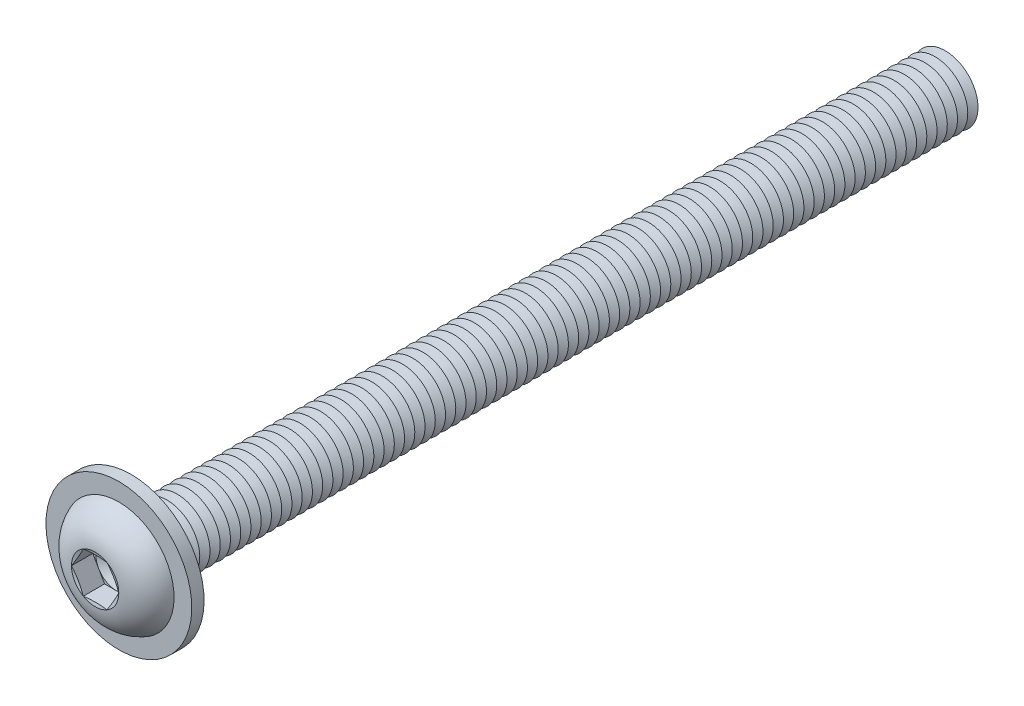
ISO-10303-21;
HEADER;
FILE_DESCRIPTION(('STEP AP214'),'2;1');
FILE_NAME('part.step','',(''),(''),'','','');
FILE_SCHEMA(('AUTOMOTIVE_DESIGN { 1 0 10303 214 1 1 1 1 }'));
ENDSEC;
DATA;
#1=APPLICATION_CONTEXT('core data for automotive mechanical design processes');
#2=APPLICATION_PROTOCOL_DEFINITION('international standard','automotive_design',2000,#1);
#3=PRODUCT_CONTEXT('',#1,'mechanical');
#4=PRODUCT('Part','Part','',(#3));
#5=PRODUCT_RELATED_PRODUCT_CATEGORY('part','',(#4));
#6=PRODUCT_DEFINITION_FORMATION('','',#4);
#7=PRODUCT_DEFINITION_CONTEXT('part definition',#1,'design');
#8=PRODUCT_DEFINITION('design','',#6,#7);
#9=PRODUCT_DEFINITION_SHAPE('','',#8);
#10=(LENGTH_UNIT() NAMED_UNIT(*) SI_UNIT(.MILLI.,.METRE.));
#11=(NAMED_UNIT(*) PLANE_ANGLE_UNIT() SI_UNIT($,.RADIAN.));
#12=(NAMED_UNIT(*) SI_UNIT($,.STERADIAN.) SOLID_ANGLE_UNIT());
#13=UNCERTAINTY_MEASURE_WITH_UNIT(LENGTH_MEASURE(1.E-05),#10,'distance_accuracy_value','');
#14=(GEOMETRIC_REPRESENTATION_CONTEXT(3) GLOBAL_UNCERTAINTY_ASSIGNED_CONTEXT((#13)) GLOBAL_UNIT_ASSIGNED_CONTEXT((#10,
#11,#12)) REPRESENTATION_CONTEXT('',''));
#15=CARTESIAN_POINT('',(0.,0.,0.));
#16=DIRECTION('',(0.,0.,1.));
#17=DIRECTION('',(1.,0.,0.));
#18=AXIS2_PLACEMENT_3D('',#15,#16,#17);
#19=CARTESIAN_POINT('',(0.,0.,-95.625));
#20=DIRECTION('',(0.,0.,1.));
#21=DIRECTION('',(0.,-1.,0.));
#22=AXIS2_PLACEMENT_3D('',#19,#20,#21);
#23=CONICAL_SURFACE('',#22,3.99999999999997,1.0471975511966);
#24=CARTESIAN_POINT('',(0.,0.,-96.25));
#25=DIRECTION('',(0.,0.,1.));
#26=DIRECTION('',(0.,-1.,0.));
#27=AXIS2_PLACEMENT_3D('',#24,#25,#26);
#28=CIRCLE('',#27,2.91746824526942);
#29=CARTESIAN_POINT('',(0.,-2.91746824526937,-96.25));
#30=VERTEX_POINT('',#29);
#31=EDGE_CURVE('E849',#30,#30,#28,.T.);
#32=ORIENTED_EDGE('',*,*,#31,.T.);
#33=EDGE_LOOP('',(#32));
#34=FACE_BOUND('',#33,.T.);
#35=CARTESIAN_POINT('',(0.,0.,-95.625));
#36=DIRECTION('',(0.,0.,1.));
#37=DIRECTION('',(0.,-1.,0.));
#38=AXIS2_PLACEMENT_3D('',#35,#36,#37);
#39=CIRCLE('',#38,3.99999999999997);
#40=CARTESIAN_POINT('',(0.,-3.99999999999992,-95.625));
#41=VERTEX_POINT('',#40);
#42=EDGE_CURVE('E845',#41,#41,#39,.T.);
#43=ORIENTED_EDGE('',*,*,#42,.F.);
#44=EDGE_LOOP('',(#43));
#45=FACE_BOUND('',#44,.T.);
#46=ADVANCED_FACE('F39',(#34,#45),#23,.T.);
#47=CARTESIAN_POINT('',(0.,0.,-96.25));
#48=DIRECTION('',(0.,0.,-1.));
#49=DIRECTION('',(0.,1.,0.));
#50=AXIS2_PLACEMENT_3D('',#47,#48,#49);
#51=CONICAL_SURFACE('',#50,2.91746824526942,1.0471975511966);
#52=CARTESIAN_POINT('',(0.,0.,-96.875));
#53=DIRECTION('',(0.,0.,1.));
#54=DIRECTION('',(0.,-1.,0.));
#55=AXIS2_PLACEMENT_3D('',#52,#53,#54);
#56=CIRCLE('',#55,3.99999999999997);
#57=CARTESIAN_POINT('',(0.,-3.99999999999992,-96.875));
#58=VERTEX_POINT('',#57);
#59=EDGE_CURVE('E853',#58,#58,#56,.T.);
#60=ORIENTED_EDGE('',*,*,#59,.T.);
#61=EDGE_LOOP('',(#60));
#62=FACE_BOUND('',#61,.T.);
#63=ORIENTED_EDGE('',*,*,#31,.F.);
#64=EDGE_LOOP('',(#63));
#65=FACE_BOUND('',#64,.T.);
#66=ADVANCED_FACE('F968',(#62,#65),#51,.T.);
#67=CARTESIAN_POINT('',(0.,3.99999999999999,-100.));
#68=DIRECTION('',(0.,0.,-1.));
#69=DIRECTION('',(0.,1.,0.));
#70=AXIS2_PLACEMENT_3D('',#67,#68,#69);
#71=PLANE('',#70);
#72=CARTESIAN_POINT('',(0.,0.,-100.));
#73=DIRECTION('',(0.,0.,1.));
#74=DIRECTION('',(0.,-1.,0.));
#75=AXIS2_PLACEMENT_3D('',#72,#73,#74);
#76=CIRCLE('',#75,2.91746824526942);
#77=CARTESIAN_POINT('',(0.,-2.91746824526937,-100.));
#78=VERTEX_POINT('',#77);
#79=EDGE_CURVE('E873',#78,#78,#76,.T.);
#80=ORIENTED_EDGE('',*,*,#79,.F.);
#81=EDGE_LOOP('',(#80));
#82=FACE_BOUND('',#81,.T.);
#83=ADVANCED_FACE('F974',(#82),#71,.T.);
#84=CARTESIAN_POINT('',(0.,0.,-99.375));
#85=DIRECTION('',(0.,0.,1.));
#86=DIRECTION('',(0.,-1.,0.));
#87=AXIS2_PLACEMENT_3D('',#84,#85,#86);
#88=CONICAL_SURFACE('',#87,3.99999999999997,1.0471975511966);
#89=ORIENTED_EDGE('',*,*,#79,.T.);
#90=EDGE_LOOP('',(#89));
#91=FACE_BOUND('',#90,.T.);
#92=CARTESIAN_POINT('',(0.,0.,-99.375));
#93=DIRECTION('',(0.,0.,1.));
#94=DIRECTION('',(0.,-1.,0.));
#95=AXIS2_PLACEMENT_3D('',#92,#93,#94);
#96=CIRCLE('',#95,3.99999999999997);
#97=CARTESIAN_POINT('',(0.,-3.99999999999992,-99.375));
#98=VERTEX_POINT('',#97);
#99=EDGE_CURVE('E869',#98,#98,#96,.T.);
#100=ORIENTED_EDGE('',*,*,#99,.F.);
#101=EDGE_LOOP('',(#100));
#102=FACE_BOUND('',#101,.T.);
#103=ADVANCED_FACE('F993',(#91,#102),#88,.T.);
#104=CARTESIAN_POINT('',(0.,0.,-98.75));
#105=DIRECTION('',(0.,0.,-1.));
#106=DIRECTION('',(0.,1.,0.));
#107=AXIS2_PLACEMENT_3D('',#104,#105,#106);
#108=CONICAL_SURFACE('',#107,2.91746824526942,1.0471975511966);
#109=ORIENTED_EDGE('',*,*,#99,.T.);
#110=EDGE_LOOP('',(#109));
#111=FACE_BOUND('',#110,.T.);
#112=CARTESIAN_POINT('',(0.,0.,-98.75));
#113=DIRECTION('',(0.,0.,1.));
#114=DIRECTION('',(0.,-1.,0.));
#115=AXIS2_PLACEMENT_3D('',#112,#113,#114);
#116=CIRCLE('',#115,2.91746824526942);
#117=CARTESIAN_POINT('',(0.,-2.91746824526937,-98.75));
#118=VERTEX_POINT('',#117);
#119=EDGE_CURVE('E865',#118,#118,#116,.T.);
#120=ORIENTED_EDGE('',*,*,#119,.F.);
#121=EDGE_LOOP('',(#120));
#122=FACE_BOUND('',#121,.T.);
#123=ADVANCED_FACE('F990',(#111,#122),#108,.T.);
#124=CARTESIAN_POINT('',(0.,0.,-98.125));
#125=DIRECTION('',(0.,0.,1.));
#126=DIRECTION('',(0.,-1.,0.));
#127=AXIS2_PLACEMENT_3D('',#124,#125,#126);
#128=CONICAL_SURFACE('',#127,3.99999999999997,1.0471975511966);
#129=ORIENTED_EDGE('',*,*,#119,.T.);
#130=EDGE_LOOP('',(#129));
#131=FACE_BOUND('',#130,.T.);
#132=CARTESIAN_POINT('',(0.,0.,-98.125));
#133=DIRECTION('',(0.,0.,1.));
#134=DIRECTION('',(0.,-1.,0.));
#135=AXIS2_PLACEMENT_3D('',#132,#133,#134);
#136=CIRCLE('',#135,3.99999999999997);
#137=CARTESIAN_POINT('',(0.,-3.99999999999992,-98.125));
#138=VERTEX_POINT('',#137);
#139=EDGE_CURVE('E861',#138,#138,#136,.T.);
#140=ORIENTED_EDGE('',*,*,#139,.F.);
#141=EDGE_LOOP('',(#140));
#142=FACE_BOUND('',#141,.T.);
#143=ADVANCED_FACE('F984',(#131,#142),#128,.T.);
#144=CARTESIAN_POINT('',(0.,0.,-97.5));
#145=DIRECTION('',(0.,0.,-1.));
#146=DIRECTION('',(0.,1.,0.));
#147=AXIS2_PLACEMENT_3D('',#144,#145,#146);
#148=CONICAL_SURFACE('',#147,2.91746824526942,1.0471975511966);
#149=ORIENTED_EDGE('',*,*,#139,.T.);
#150=EDGE_LOOP('',(#149));
#151=FACE_BOUND('',#150,.T.);
#152=CARTESIAN_POINT('',(0.,0.,-97.5));
#153=DIRECTION('',(0.,0.,1.));
#154=DIRECTION('',(0.,-1.,0.));
#155=AXIS2_PLACEMENT_3D('',#152,#153,#154);
#156=CIRCLE('',#155,2.91746824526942);
#157=CARTESIAN_POINT('',(0.,-2.91746824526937,-97.5));
#158=VERTEX_POINT('',#157);
#159=EDGE_CURVE('E857',#158,#158,#156,.T.);
#160=ORIENTED_EDGE('',*,*,#159,.F.);
#161=EDGE_LOOP('',(#160));
#162=FACE_BOUND('',#161,.T.);
#163=ADVANCED_FACE('F980',(#151,#162),#148,.T.);
#164=CARTESIAN_POINT('',(0.,0.,-96.875));
#165=DIRECTION('',(0.,0.,1.));
#166=DIRECTION('',(0.,-1.,0.));
#167=AXIS2_PLACEMENT_3D('',#164,#165,#166);
#168=CONICAL_SURFACE('',#167,3.99999999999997,1.0471975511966);
#169=ORIENTED_EDGE('',*,*,#159,.T.);
#170=EDGE_LOOP('',(#169));
#171=FACE_BOUND('',#170,.T.);
#172=ORIENTED_EDGE('',*,*,#59,.F.);
#173=EDGE_LOOP('',(#172));
#174=FACE_BOUND('',#173,.T.);
#175=ADVANCED_FACE('F983',(#171,#174),#168,.T.);
#176=CARTESIAN_POINT('',(0.,0.,-94.375));
#177=DIRECTION('',(0.,0.,1.));
#178=DIRECTION('',(0.,-1.,0.));
#179=AXIS2_PLACEMENT_3D('',#176,#177,#178);
#180=CONICAL_SURFACE('',#179,3.99999999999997,1.0471975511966);
#181=CARTESIAN_POINT('',(0.,0.,-95.));
#182=DIRECTION('',(0.,0.,1.));
#183=DIRECTION('',(0.,-1.,0.));
#184=AXIS2_PLACEMENT_3D('',#181,#182,#183);
#185=CIRCLE('',#184,2.91746824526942);
#186=CARTESIAN_POINT('',(0.,-2.91746824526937,-95.));
#187=VERTEX_POINT('',#186);
#188=EDGE_CURVE('E841',#187,#187,#185,.T.);
#189=ORIENTED_EDGE('',*,*,#188,.T.);
#190=EDGE_LOOP('',(#189));
#191=FACE_BOUND('',#190,.T.);
#192=CARTESIAN_POINT('',(0.,0.,-94.375));
#193=DIRECTION('',(0.,0.,1.));
#194=DIRECTION('',(0.,-1.,0.));
#195=AXIS2_PLACEMENT_3D('',#192,#193,#194);
#196=CIRCLE('',#195,3.99999999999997);
#197=CARTESIAN_POINT('',(0.,-3.99999999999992,-94.375));
#198=VERTEX_POINT('',#197);
#199=EDGE_CURVE('E837',#198,#198,#196,.T.);
#200=ORIENTED_EDGE('',*,*,#199,.F.);
#201=EDGE_LOOP('',(#200));
#202=FACE_BOUND('',#201,.T.);
#203=ADVANCED_FACE('F988',(#191,#202),#180,.T.);
#204=CARTESIAN_POINT('',(0.,0.,-95.));
#205=DIRECTION('',(0.,0.,-1.));
#206=DIRECTION('',(0.,1.,0.));
#207=AXIS2_PLACEMENT_3D('',#204,#205,#206);
#208=CONICAL_SURFACE('',#207,2.91746824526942,1.0471975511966);
#209=ORIENTED_EDGE('',*,*,#42,.T.);
#210=EDGE_LOOP('',(#209));
#211=FACE_BOUND('',#210,.T.);
#212=ORIENTED_EDGE('',*,*,#188,.F.);
#213=EDGE_LOOP('',(#212));
#214=FACE_BOUND('',#213,.T.);
#215=ADVANCED_FACE('F1039',(#211,#214),#208,.T.);
#216=CARTESIAN_POINT('',(0.,0.,-93.125));
#217=DIRECTION('',(0.,0.,1.));
#218=DIRECTION('',(0.,-1.,0.));
#219=AXIS2_PLACEMENT_3D('',#216,#217,#218);
#220=CONICAL_SURFACE('',#219,3.99999999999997,1.0471975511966);
#221=CARTESIAN_POINT('',(0.,0.,-93.75));
#222=DIRECTION('',(0.,0.,1.));
#223=DIRECTION('',(0.,-1.,0.));
#224=AXIS2_PLACEMENT_3D('',#221,#222,#223);
#225=CIRCLE('',#224,2.91746824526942);
#226=CARTESIAN_POINT('',(0.,-2.91746824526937,-93.75));
#227=VERTEX_POINT('',#226);
#228=EDGE_CURVE('E833',#227,#227,#225,.T.);
#229=ORIENTED_EDGE('',*,*,#228,.T.);
#230=EDGE_LOOP('',(#229));
#231=FACE_BOUND('',#230,.T.);
#232=CARTESIAN_POINT('',(0.,0.,-93.125));
#233=DIRECTION('',(0.,0.,1.));
#234=DIRECTION('',(0.,-1.,0.));
#235=AXIS2_PLACEMENT_3D('',#232,#233,#234);
#236=CIRCLE('',#235,3.99999999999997);
#237=CARTESIAN_POINT('',(0.,-3.99999999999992,-93.125));
#238=VERTEX_POINT('',#237);
#239=EDGE_CURVE('E829',#238,#238,#236,.T.);
#240=ORIENTED_EDGE('',*,*,#239,.F.);
#241=EDGE_LOOP('',(#240));
#242=FACE_BOUND('',#241,.T.);
#243=ADVANCED_FACE('F1045',(#231,#242),#220,.T.);
#244=CARTESIAN_POINT('',(0.,0.,-93.75));
#245=DIRECTION('',(0.,0.,-1.));
#246=DIRECTION('',(0.,1.,0.));
#247=AXIS2_PLACEMENT_3D('',#244,#245,#246);
#248=CONICAL_SURFACE('',#247,2.91746824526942,1.0471975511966);
#249=ORIENTED_EDGE('',*,*,#199,.T.);
#250=EDGE_LOOP('',(#249));
#251=FACE_BOUND('',#250,.T.);
#252=ORIENTED_EDGE('',*,*,#228,.F.);
#253=EDGE_LOOP('',(#252));
#254=FACE_BOUND('',#253,.T.);
#255=ADVANCED_FACE('F1052',(#251,#254),#248,.T.);
#256=CARTESIAN_POINT('',(0.,0.,-91.875));
#257=DIRECTION('',(0.,0.,1.));
#258=DIRECTION('',(0.,-1.,0.));
#259=AXIS2_PLACEMENT_3D('',#256,#257,#258);
#260=CONICAL_SURFACE('',#259,3.99999999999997,1.0471975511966);
#261=CARTESIAN_POINT('',(0.,0.,-92.5));
#262=DIRECTION('',(0.,0.,1.));
#263=DIRECTION('',(0.,-1.,0.));
#264=AXIS2_PLACEMENT_3D('',#261,#262,#263);
#265=CIRCLE('',#264,2.91746824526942);
#266=CARTESIAN_POINT('',(0.,-2.91746824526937,-92.5));
#267=VERTEX_POINT('',#266);
#268=EDGE_CURVE('E825',#267,#267,#265,.T.);
#269=ORIENTED_EDGE('',*,*,#268,.T.);
#270=EDGE_LOOP('',(#269));
#271=FACE_BOUND('',#270,.T.);
#272=CARTESIAN_POINT('',(0.,0.,-91.875));
#273=DIRECTION('',(0.,0.,1.));
#274=DIRECTION('',(0.,-1.,0.));
#275=AXIS2_PLACEMENT_3D('',#272,#273,#274);
#276=CIRCLE('',#275,3.99999999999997);
#277=CARTESIAN_POINT('',(0.,-3.99999999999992,-91.875));
#278=VERTEX_POINT('',#277);
#279=EDGE_CURVE('E821',#278,#278,#276,.T.);
#280=ORIENTED_EDGE('',*,*,#279,.F.);
#281=EDGE_LOOP('',(#280));
#282=FACE_BOUND('',#281,.T.);
#283=ADVANCED_FACE('F1059',(#271,#282),#260,.T.);
#284=CARTESIAN_POINT('',(0.,0.,-92.5));
#285=DIRECTION('',(0.,0.,-1.));
#286=DIRECTION('',(0.,1.,0.));
#287=AXIS2_PLACEMENT_3D('',#284,#285,#286);
#288=CONICAL_SURFACE('',#287,2.91746824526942,1.0471975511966);
#289=ORIENTED_EDGE('',*,*,#239,.T.);
#290=EDGE_LOOP('',(#289));
#291=FACE_BOUND('',#290,.T.);
#292=ORIENTED_EDGE('',*,*,#268,.F.);
#293=EDGE_LOOP('',(#292));
#294=FACE_BOUND('',#293,.T.);
#295=ADVANCED_FACE('F1066',(#291,#294),#288,.T.);
#296=CARTESIAN_POINT('',(0.,0.,-90.625));
#297=DIRECTION('',(0.,0.,1.));
#298=DIRECTION('',(0.,-1.,0.));
#299=AXIS2_PLACEMENT_3D('',#296,#297,#298);
#300=CONICAL_SURFACE('',#299,3.99999999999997,1.0471975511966);
#301=CARTESIAN_POINT('',(0.,0.,-91.25));
#302=DIRECTION('',(0.,0.,1.));
#303=DIRECTION('',(0.,-1.,0.));
#304=AXIS2_PLACEMENT_3D('',#301,#302,#303);
#305=CIRCLE('',#304,2.91746824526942);
#306=CARTESIAN_POINT('',(0.,-2.91746824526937,-91.25));
#307=VERTEX_POINT('',#306);
#308=EDGE_CURVE('E817',#307,#307,#305,.T.);
#309=ORIENTED_EDGE('',*,*,#308,.T.);
#310=EDGE_LOOP('',(#309));
#311=FACE_BOUND('',#310,.T.);
#312=CARTESIAN_POINT('',(0.,0.,-90.625));
#313=DIRECTION('',(0.,0.,1.));
#314=DIRECTION('',(0.,-1.,0.));
#315=AXIS2_PLACEMENT_3D('',#312,#313,#314);
#316=CIRCLE('',#315,3.99999999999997);
#317=CARTESIAN_POINT('',(0.,-3.99999999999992,-90.625));
#318=VERTEX_POINT('',#317);
#319=EDGE_CURVE('E813',#318,#318,#316,.T.);
#320=ORIENTED_EDGE('',*,*,#319,.F.);
#321=EDGE_LOOP('',(#320));
#322=FACE_BOUND('',#321,.T.);
#323=ADVANCED_FACE('F1073',(#311,#322),#300,.T.);
#324=CARTESIAN_POINT('',(0.,0.,-91.25));
#325=DIRECTION('',(0.,0.,-1.));
#326=DIRECTION('',(0.,1.,0.));
#327=AXIS2_PLACEMENT_3D('',#324,#325,#326);
#328=CONICAL_SURFACE('',#327,2.91746824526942,1.0471975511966);
#329=ORIENTED_EDGE('',*,*,#279,.T.);
#330=EDGE_LOOP('',(#329));
#331=FACE_BOUND('',#330,.T.);
#332=ORIENTED_EDGE('',*,*,#308,.F.);
#333=EDGE_LOOP('',(#332));
#334=FACE_BOUND('',#333,.T.);
#335=ADVANCED_FACE('F1080',(#331,#334),#328,.T.);
#336=CARTESIAN_POINT('',(0.,0.,-89.375));
#337=DIRECTION('',(0.,0.,1.));
#338=DIRECTION('',(0.,-1.,0.));
#339=AXIS2_PLACEMENT_3D('',#336,#337,#338);
#340=CONICAL_SURFACE('',#339,3.99999999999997,1.0471975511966);
#341=CARTESIAN_POINT('',(0.,0.,-90.));
#342=DIRECTION('',(0.,0.,1.));
#343=DIRECTION('',(0.,-1.,0.));
#344=AXIS2_PLACEMENT_3D('',#341,#342,#343);
#345=CIRCLE('',#344,2.91746824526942);
#346=CARTESIAN_POINT('',(0.,-2.91746824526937,-90.));
#347=VERTEX_POINT('',#346);
#348=EDGE_CURVE('E809',#347,#347,#345,.T.);
#349=ORIENTED_EDGE('',*,*,#348,.T.);
#350=EDGE_LOOP('',(#349));
#351=FACE_BOUND('',#350,.T.);
#352=CARTESIAN_POINT('',(0.,0.,-89.375));
#353=DIRECTION('',(0.,0.,1.));
#354=DIRECTION('',(0.,-1.,0.));
#355=AXIS2_PLACEMENT_3D('',#352,#353,#354);
#356=CIRCLE('',#355,3.99999999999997);
#357=CARTESIAN_POINT('',(0.,-3.99999999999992,-89.375));
#358=VERTEX_POINT('',#357);
#359=EDGE_CURVE('E805',#358,#358,#356,.T.);
#360=ORIENTED_EDGE('',*,*,#359,.F.);
#361=EDGE_LOOP('',(#360));
#362=FACE_BOUND('',#361,.T.);
#363=ADVANCED_FACE('F1087',(#351,#362),#340,.T.);
#364=CARTESIAN_POINT('',(0.,0.,-90.));
#365=DIRECTION('',(0.,0.,-1.));
#366=DIRECTION('',(0.,1.,0.));
#367=AXIS2_PLACEMENT_3D('',#364,#365,#366);
#368=CONICAL_SURFACE('',#367,2.91746824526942,1.0471975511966);
#369=ORIENTED_EDGE('',*,*,#319,.T.);
#370=EDGE_LOOP('',(#369));
#371=FACE_BOUND('',#370,.T.);
#372=ORIENTED_EDGE('',*,*,#348,.F.);
#373=EDGE_LOOP('',(#372));
#374=FACE_BOUND('',#373,.T.);
#375=ADVANCED_FACE('F1094',(#371,#374),#368,.T.);
#376=CARTESIAN_POINT('',(0.,0.,-88.125));
#377=DIRECTION('',(0.,0.,1.));
#378=DIRECTION('',(0.,-1.,0.));
#379=AXIS2_PLACEMENT_3D('',#376,#377,#378);
#380=CONICAL_SURFACE('',#379,3.99999999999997,1.0471975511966);
#381=CARTESIAN_POINT('',(0.,0.,-88.75));
#382=DIRECTION('',(0.,0.,1.));
#383=DIRECTION('',(0.,-1.,0.));
#384=AXIS2_PLACEMENT_3D('',#381,#382,#383);
#385=CIRCLE('',#384,2.91746824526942);
#386=CARTESIAN_POINT('',(0.,-2.91746824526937,-88.75));
#387=VERTEX_POINT('',#386);
#388=EDGE_CURVE('E801',#387,#387,#385,.T.);
#389=ORIENTED_EDGE('',*,*,#388,.T.);
#390=EDGE_LOOP('',(#389));
#391=FACE_BOUND('',#390,.T.);
#392=CARTESIAN_POINT('',(0.,0.,-88.125));
#393=DIRECTION('',(0.,0.,1.));
#394=DIRECTION('',(0.,-1.,0.));
#395=AXIS2_PLACEMENT_3D('',#392,#393,#394);
#396=CIRCLE('',#395,3.99999999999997);
#397=CARTESIAN_POINT('',(0.,-3.99999999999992,-88.125));
#398=VERTEX_POINT('',#397);
#399=EDGE_CURVE('E797',#398,#398,#396,.T.);
#400=ORIENTED_EDGE('',*,*,#399,.F.);
#401=EDGE_LOOP('',(#400));
#402=FACE_BOUND('',#401,.T.);
#403=ADVANCED_FACE('F1101',(#391,#402),#380,.T.);
#404=CARTESIAN_POINT('',(0.,0.,-88.75));
#405=DIRECTION('',(0.,0.,-1.));
#406=DIRECTION('',(0.,1.,0.));
#407=AXIS2_PLACEMENT_3D('',#404,#405,#406);
#408=CONICAL_SURFACE('',#407,2.91746824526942,1.0471975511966);
#409=ORIENTED_EDGE('',*,*,#359,.T.);
#410=EDGE_LOOP('',(#409));
#411=FACE_BOUND('',#410,.T.);
#412=ORIENTED_EDGE('',*,*,#388,.F.);
#413=EDGE_LOOP('',(#412));
#414=FACE_BOUND('',#413,.T.);
#415=ADVANCED_FACE('F1108',(#411,#414),#408,.T.);
#416=CARTESIAN_POINT('',(0.,0.,-86.875));
#417=DIRECTION('',(0.,0.,1.));
#418=DIRECTION('',(0.,-1.,0.));
#419=AXIS2_PLACEMENT_3D('',#416,#417,#418);
#420=CONICAL_SURFACE('',#419,3.99999999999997,1.0471975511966);
#421=CARTESIAN_POINT('',(0.,0.,-87.5));
#422=DIRECTION('',(0.,0.,1.));
#423=DIRECTION('',(0.,-1.,0.));
#424=AXIS2_PLACEMENT_3D('',#421,#422,#423);
#425=CIRCLE('',#424,2.91746824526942);
#426=CARTESIAN_POINT('',(0.,-2.91746824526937,-87.5));
#427=VERTEX_POINT('',#426);
#428=EDGE_CURVE('E793',#427,#427,#425,.T.);
#429=ORIENTED_EDGE('',*,*,#428,.T.);
#430=EDGE_LOOP('',(#429));
#431=FACE_BOUND('',#430,.T.);
#432=CARTESIAN_POINT('',(0.,0.,-86.875));
#433=DIRECTION('',(0.,0.,1.));
#434=DIRECTION('',(0.,-1.,0.));
#435=AXIS2_PLACEMENT_3D('',#432,#433,#434);
#436=CIRCLE('',#435,3.99999999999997);
#437=CARTESIAN_POINT('',(0.,-3.99999999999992,-86.875));
#438=VERTEX_POINT('',#437);
#439=EDGE_CURVE('E789',#438,#438,#436,.T.);
#440=ORIENTED_EDGE('',*,*,#439,.F.);
#441=EDGE_LOOP('',(#440));
#442=FACE_BOUND('',#441,.T.);
#443=ADVANCED_FACE('F1115',(#431,#442),#420,.T.);
#444=CARTESIAN_POINT('',(0.,0.,-87.5));
#445=DIRECTION('',(0.,0.,-1.));
#446=DIRECTION('',(0.,1.,0.));
#447=AXIS2_PLACEMENT_3D('',#444,#445,#446);
#448=CONICAL_SURFACE('',#447,2.91746824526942,1.0471975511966);
#449=ORIENTED_EDGE('',*,*,#399,.T.);
#450=EDGE_LOOP('',(#449));
#451=FACE_BOUND('',#450,.T.);
#452=ORIENTED_EDGE('',*,*,#428,.F.);
#453=EDGE_LOOP('',(#452));
#454=FACE_BOUND('',#453,.T.);
#455=ADVANCED_FACE('F1122',(#451,#454),#448,.T.);
#456=CARTESIAN_POINT('',(0.,0.,-85.625));
#457=DIRECTION('',(0.,0.,1.));
#458=DIRECTION('',(0.,-1.,0.));
#459=AXIS2_PLACEMENT_3D('',#456,#457,#458);
#460=CONICAL_SURFACE('',#459,3.99999999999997,1.0471975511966);
#461=CARTESIAN_POINT('',(0.,0.,-86.25));
#462=DIRECTION('',(0.,0.,1.));
#463=DIRECTION('',(0.,-1.,0.));
#464=AXIS2_PLACEMENT_3D('',#461,#462,#463);
#465=CIRCLE('',#464,2.91746824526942);
#466=CARTESIAN_POINT('',(0.,-2.91746824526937,-86.25));
#467=VERTEX_POINT('',#466);
#468=EDGE_CURVE('E785',#467,#467,#465,.T.);
#469=ORIENTED_EDGE('',*,*,#468,.T.);
#470=EDGE_LOOP('',(#469));
#471=FACE_BOUND('',#470,.T.);
#472=CARTESIAN_POINT('',(0.,0.,-85.625));
#473=DIRECTION('',(0.,0.,1.));
#474=DIRECTION('',(0.,-1.,0.));
#475=AXIS2_PLACEMENT_3D('',#472,#473,#474);
#476=CIRCLE('',#475,3.99999999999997);
#477=CARTESIAN_POINT('',(0.,-3.99999999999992,-85.625));
#478=VERTEX_POINT('',#477);
#479=EDGE_CURVE('E781',#478,#478,#476,.T.);
#480=ORIENTED_EDGE('',*,*,#479,.F.);
#481=EDGE_LOOP('',(#480));
#482=FACE_BOUND('',#481,.T.);
#483=ADVANCED_FACE('F1129',(#471,#482),#460,.T.);
#484=CARTESIAN_POINT('',(0.,0.,-86.25));
#485=DIRECTION('',(0.,0.,-1.));
#486=DIRECTION('',(0.,1.,0.));
#487=AXIS2_PLACEMENT_3D('',#484,#485,#486);
#488=CONICAL_SURFACE('',#487,2.91746824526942,1.0471975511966);
#489=ORIENTED_EDGE('',*,*,#439,.T.);
#490=EDGE_LOOP('',(#489));
#491=FACE_BOUND('',#490,.T.);
#492=ORIENTED_EDGE('',*,*,#468,.F.);
#493=EDGE_LOOP('',(#492));
#494=FACE_BOUND('',#493,.T.);
#495=ADVANCED_FACE('F1136',(#491,#494),#488,.T.);
#496=CARTESIAN_POINT('',(0.,0.,-84.375));
#497=DIRECTION('',(0.,0.,1.));
#498=DIRECTION('',(0.,-1.,0.));
#499=AXIS2_PLACEMENT_3D('',#496,#497,#498);
#500=CONICAL_SURFACE('',#499,3.99999999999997,1.0471975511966);
#501=CARTESIAN_POINT('',(0.,0.,-85.));
#502=DIRECTION('',(0.,0.,1.));
#503=DIRECTION('',(0.,-1.,0.));
#504=AXIS2_PLACEMENT_3D('',#501,#502,#503);
#505=CIRCLE('',#504,2.91746824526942);
#506=CARTESIAN_POINT('',(0.,-2.91746824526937,-85.));
#507=VERTEX_POINT('',#506);
#508=EDGE_CURVE('E777',#507,#507,#505,.T.);
#509=ORIENTED_EDGE('',*,*,#508,.T.);
#510=EDGE_LOOP('',(#509));
#511=FACE_BOUND('',#510,.T.);
#512=CARTESIAN_POINT('',(0.,0.,-84.375));
#513=DIRECTION('',(0.,0.,1.));
#514=DIRECTION('',(0.,-1.,0.));
#515=AXIS2_PLACEMENT_3D('',#512,#513,#514);
#516=CIRCLE('',#515,3.99999999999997);
#517=CARTESIAN_POINT('',(0.,-3.99999999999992,-84.375));
#518=VERTEX_POINT('',#517);
#519=EDGE_CURVE('E773',#518,#518,#516,.T.);
#520=ORIENTED_EDGE('',*,*,#519,.F.);
#521=EDGE_LOOP('',(#520));
#522=FACE_BOUND('',#521,.T.);
#523=ADVANCED_FACE('F1143',(#511,#522),#500,.T.);
#524=CARTESIAN_POINT('',(0.,0.,-85.));
#525=DIRECTION('',(0.,0.,-1.));
#526=DIRECTION('',(0.,1.,0.));
#527=AXIS2_PLACEMENT_3D('',#524,#525,#526);
#528=CONICAL_SURFACE('',#527,2.91746824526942,1.0471975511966);
#529=ORIENTED_EDGE('',*,*,#479,.T.);
#530=EDGE_LOOP('',(#529));
#531=FACE_BOUND('',#530,.T.);
#532=ORIENTED_EDGE('',*,*,#508,.F.);
#533=EDGE_LOOP('',(#532));
#534=FACE_BOUND('',#533,.T.);
#535=ADVANCED_FACE('F1150',(#531,#534),#528,.T.);
#536=CARTESIAN_POINT('',(0.,0.,-83.125));
#537=DIRECTION('',(0.,0.,1.));
#538=DIRECTION('',(0.,-1.,0.));
#539=AXIS2_PLACEMENT_3D('',#536,#537,#538);
#540=CONICAL_SURFACE('',#539,3.99999999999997,1.0471975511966);
#541=CARTESIAN_POINT('',(0.,0.,-83.75));
#542=DIRECTION('',(0.,0.,1.));
#543=DIRECTION('',(0.,-1.,0.));
#544=AXIS2_PLACEMENT_3D('',#541,#542,#543);
#545=CIRCLE('',#544,2.91746824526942);
#546=CARTESIAN_POINT('',(0.,-2.91746824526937,-83.75));
#547=VERTEX_POINT('',#546);
#548=EDGE_CURVE('E769',#547,#547,#545,.T.);
#549=ORIENTED_EDGE('',*,*,#548,.T.);
#550=EDGE_LOOP('',(#549));
#551=FACE_BOUND('',#550,.T.);
#552=CARTESIAN_POINT('',(0.,0.,-83.125));
#553=DIRECTION('',(0.,0.,1.));
#554=DIRECTION('',(0.,-1.,0.));
#555=AXIS2_PLACEMENT_3D('',#552,#553,#554);
#556=CIRCLE('',#555,3.99999999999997);
#557=CARTESIAN_POINT('',(0.,-3.99999999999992,-83.125));
#558=VERTEX_POINT('',#557);
#559=EDGE_CURVE('E765',#558,#558,#556,.T.);
#560=ORIENTED_EDGE('',*,*,#559,.F.);
#561=EDGE_LOOP('',(#560));
#562=FACE_BOUND('',#561,.T.);
#563=ADVANCED_FACE('F1157',(#551,#562),#540,.T.);
#564=CARTESIAN_POINT('',(0.,0.,-83.75));
#565=DIRECTION('',(0.,0.,-1.));
#566=DIRECTION('',(0.,1.,0.));
#567=AXIS2_PLACEMENT_3D('',#564,#565,#566);
#568=CONICAL_SURFACE('',#567,2.91746824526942,1.0471975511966);
#569=ORIENTED_EDGE('',*,*,#519,.T.);
#570=EDGE_LOOP('',(#569));
#571=FACE_BOUND('',#570,.T.);
#572=ORIENTED_EDGE('',*,*,#548,.F.);
#573=EDGE_LOOP('',(#572));
#574=FACE_BOUND('',#573,.T.);
#575=ADVANCED_FACE('F1164',(#571,#574),#568,.T.);
#576=CARTESIAN_POINT('',(0.,0.,-81.875));
#577=DIRECTION('',(0.,0.,1.));
#578=DIRECTION('',(0.,-1.,0.));
#579=AXIS2_PLACEMENT_3D('',#576,#577,#578);
#580=CONICAL_SURFACE('',#579,3.99999999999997,1.0471975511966);
#581=CARTESIAN_POINT('',(0.,0.,-82.5));
#582=DIRECTION('',(0.,0.,1.));
#583=DIRECTION('',(0.,-1.,0.));
#584=AXIS2_PLACEMENT_3D('',#581,#582,#583);
#585=CIRCLE('',#584,2.91746824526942);
#586=CARTESIAN_POINT('',(0.,-2.91746824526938,-82.5));
#587=VERTEX_POINT('',#586);
#588=EDGE_CURVE('E761',#587,#587,#585,.T.);
#589=ORIENTED_EDGE('',*,*,#588,.T.);
#590=EDGE_LOOP('',(#589));
#591=FACE_BOUND('',#590,.T.);
#592=CARTESIAN_POINT('',(0.,0.,-81.875));
#593=DIRECTION('',(0.,0.,1.));
#594=DIRECTION('',(0.,-1.,0.));
#595=AXIS2_PLACEMENT_3D('',#592,#593,#594);
#596=CIRCLE('',#595,3.99999999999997);
#597=CARTESIAN_POINT('',(0.,-3.99999999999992,-81.875));
#598=VERTEX_POINT('',#597);
#599=EDGE_CURVE('E757',#598,#598,#596,.T.);
#600=ORIENTED_EDGE('',*,*,#599,.F.);
#601=EDGE_LOOP('',(#600));
#602=FACE_BOUND('',#601,.T.);
#603=ADVANCED_FACE('F1171',(#591,#602),#580,.T.);
#604=CARTESIAN_POINT('',(0.,0.,-82.5));
#605=DIRECTION('',(0.,0.,-1.));
#606=DIRECTION('',(0.,1.,0.));
#607=AXIS2_PLACEMENT_3D('',#604,#605,#606);
#608=CONICAL_SURFACE('',#607,2.91746824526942,1.0471975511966);
#609=ORIENTED_EDGE('',*,*,#559,.T.);
#610=EDGE_LOOP('',(#609));
#611=FACE_BOUND('',#610,.T.);
#612=ORIENTED_EDGE('',*,*,#588,.F.);
#613=EDGE_LOOP('',(#612));
#614=FACE_BOUND('',#613,.T.);
#615=ADVANCED_FACE('F1178',(#611,#614),#608,.T.);
#616=CARTESIAN_POINT('',(0.,0.,-80.625));
#617=DIRECTION('',(0.,0.,1.));
#618=DIRECTION('',(0.,-1.,0.));
#619=AXIS2_PLACEMENT_3D('',#616,#617,#618);
#620=CONICAL_SURFACE('',#619,3.99999999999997,1.0471975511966);
#621=CARTESIAN_POINT('',(0.,0.,-81.25));
#622=DIRECTION('',(0.,0.,1.));
#623=DIRECTION('',(0.,-1.,0.));
#624=AXIS2_PLACEMENT_3D('',#621,#622,#623);
#625=CIRCLE('',#624,2.91746824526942);
#626=CARTESIAN_POINT('',(0.,-2.91746824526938,-81.25));
#627=VERTEX_POINT('',#626);
#628=EDGE_CURVE('E753',#627,#627,#625,.T.);
#629=ORIENTED_EDGE('',*,*,#628,.T.);
#630=EDGE_LOOP('',(#629));
#631=FACE_BOUND('',#630,.T.);
#632=CARTESIAN_POINT('',(0.,0.,-80.625));
#633=DIRECTION('',(0.,0.,1.));
#634=DIRECTION('',(0.,-1.,0.));
#635=AXIS2_PLACEMENT_3D('',#632,#633,#634);
#636=CIRCLE('',#635,3.99999999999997);
#637=CARTESIAN_POINT('',(0.,-3.99999999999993,-80.625));
#638=VERTEX_POINT('',#637);
#639=EDGE_CURVE('E749',#638,#638,#636,.T.);
#640=ORIENTED_EDGE('',*,*,#639,.F.);
#641=EDGE_LOOP('',(#640));
#642=FACE_BOUND('',#641,.T.);
#643=ADVANCED_FACE('F1185',(#631,#642),#620,.T.);
#644=CARTESIAN_POINT('',(0.,0.,-81.25));
#645=DIRECTION('',(0.,0.,-1.));
#646=DIRECTION('',(0.,1.,0.));
#647=AXIS2_PLACEMENT_3D('',#644,#645,#646);
#648=CONICAL_SURFACE('',#647,2.91746824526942,1.0471975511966);
#649=ORIENTED_EDGE('',*,*,#599,.T.);
#650=EDGE_LOOP('',(#649));
#651=FACE_BOUND('',#650,.T.);
#652=ORIENTED_EDGE('',*,*,#628,.F.);
#653=EDGE_LOOP('',(#652));
#654=FACE_BOUND('',#653,.T.);
#655=ADVANCED_FACE('F1192',(#651,#654),#648,.T.);
#656=CARTESIAN_POINT('',(0.,0.,-79.375));
#657=DIRECTION('',(0.,0.,1.));
#658=DIRECTION('',(0.,-1.,0.));
#659=AXIS2_PLACEMENT_3D('',#656,#657,#658);
#660=CONICAL_SURFACE('',#659,3.99999999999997,1.0471975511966);
#661=CARTESIAN_POINT('',(0.,0.,-80.));
#662=DIRECTION('',(0.,0.,1.));
#663=DIRECTION('',(0.,-1.,0.));
#664=AXIS2_PLACEMENT_3D('',#661,#662,#663);
#665=CIRCLE('',#664,2.91746824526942);
#666=CARTESIAN_POINT('',(0.,-2.91746824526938,-80.));
#667=VERTEX_POINT('',#666);
#668=EDGE_CURVE('E745',#667,#667,#665,.T.);
#669=ORIENTED_EDGE('',*,*,#668,.T.);
#670=EDGE_LOOP('',(#669));
#671=FACE_BOUND('',#670,.T.);
#672=CARTESIAN_POINT('',(0.,0.,-79.375));
#673=DIRECTION('',(0.,0.,1.));
#674=DIRECTION('',(0.,-1.,0.));
#675=AXIS2_PLACEMENT_3D('',#672,#673,#674);
#676=CIRCLE('',#675,3.99999999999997);
#677=CARTESIAN_POINT('',(0.,-3.99999999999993,-79.375));
#678=VERTEX_POINT('',#677);
#679=EDGE_CURVE('E741',#678,#678,#676,.T.);
#680=ORIENTED_EDGE('',*,*,#679,.F.);
#681=EDGE_LOOP('',(#680));
#682=FACE_BOUND('',#681,.T.);
#683=ADVANCED_FACE('F1199',(#671,#682),#660,.T.);
#684=CARTESIAN_POINT('',(0.,0.,-80.));
#685=DIRECTION('',(0.,0.,-1.));
#686=DIRECTION('',(0.,1.,0.));
#687=AXIS2_PLACEMENT_3D('',#684,#685,#686);
#688=CONICAL_SURFACE('',#687,2.91746824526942,1.0471975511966);
#689=ORIENTED_EDGE('',*,*,#639,.T.);
#690=EDGE_LOOP('',(#689));
#691=FACE_BOUND('',#690,.T.);
#692=ORIENTED_EDGE('',*,*,#668,.F.);
#693=EDGE_LOOP('',(#692));
#694=FACE_BOUND('',#693,.T.);
#695=ADVANCED_FACE('F1206',(#691,#694),#688,.T.);
#696=CARTESIAN_POINT('',(0.,0.,-78.125));
#697=DIRECTION('',(0.,0.,1.));
#698=DIRECTION('',(0.,-1.,0.));
#699=AXIS2_PLACEMENT_3D('',#696,#697,#698);
#700=CONICAL_SURFACE('',#699,3.99999999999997,1.0471975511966);
#701=CARTESIAN_POINT('',(0.,0.,-78.75));
#702=DIRECTION('',(0.,0.,1.));
#703=DIRECTION('',(0.,-1.,0.));
#704=AXIS2_PLACEMENT_3D('',#701,#702,#703);
#705=CIRCLE('',#704,2.91746824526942);
#706=CARTESIAN_POINT('',(0.,-2.91746824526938,-78.75));
#707=VERTEX_POINT('',#706);
#708=EDGE_CURVE('E737',#707,#707,#705,.T.);
#709=ORIENTED_EDGE('',*,*,#708,.T.);
#710=EDGE_LOOP('',(#709));
#711=FACE_BOUND('',#710,.T.);
#712=CARTESIAN_POINT('',(0.,0.,-78.125));
#713=DIRECTION('',(0.,0.,1.));
#714=DIRECTION('',(0.,-1.,0.));
#715=AXIS2_PLACEMENT_3D('',#712,#713,#714);
#716=CIRCLE('',#715,3.99999999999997);
#717=CARTESIAN_POINT('',(0.,-3.99999999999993,-78.125));
#718=VERTEX_POINT('',#717);
#719=EDGE_CURVE('E733',#718,#718,#716,.T.);
#720=ORIENTED_EDGE('',*,*,#719,.F.);
#721=EDGE_LOOP('',(#720));
#722=FACE_BOUND('',#721,.T.);
#723=ADVANCED_FACE('F1213',(#711,#722),#700,.T.);
#724=CARTESIAN_POINT('',(0.,0.,-78.75));
#725=DIRECTION('',(0.,0.,-1.));
#726=DIRECTION('',(0.,1.,0.));
#727=AXIS2_PLACEMENT_3D('',#724,#725,#726);
#728=CONICAL_SURFACE('',#727,2.91746824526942,1.0471975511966);
#729=ORIENTED_EDGE('',*,*,#679,.T.);
#730=EDGE_LOOP('',(#729));
#731=FACE_BOUND('',#730,.T.);
#732=ORIENTED_EDGE('',*,*,#708,.F.);
#733=EDGE_LOOP('',(#732));
#734=FACE_BOUND('',#733,.T.);
#735=ADVANCED_FACE('F1220',(#731,#734),#728,.T.);
#736=CARTESIAN_POINT('',(0.,0.,-76.875));
#737=DIRECTION('',(0.,0.,1.));
#738=DIRECTION('',(0.,-1.,0.));
#739=AXIS2_PLACEMENT_3D('',#736,#737,#738);
#740=CONICAL_SURFACE('',#739,3.99999999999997,1.0471975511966);
#741=CARTESIAN_POINT('',(0.,0.,-77.5));
#742=DIRECTION('',(0.,0.,1.));
#743=DIRECTION('',(0.,-1.,0.));
#744=AXIS2_PLACEMENT_3D('',#741,#742,#743);
#745=CIRCLE('',#744,2.91746824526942);
#746=CARTESIAN_POINT('',(0.,-2.91746824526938,-77.5));
#747=VERTEX_POINT('',#746);
#748=EDGE_CURVE('E729',#747,#747,#745,.T.);
#749=ORIENTED_EDGE('',*,*,#748,.T.);
#750=EDGE_LOOP('',(#749));
#751=FACE_BOUND('',#750,.T.);
#752=CARTESIAN_POINT('',(0.,0.,-76.875));
#753=DIRECTION('',(0.,0.,1.));
#754=DIRECTION('',(0.,-1.,0.));
#755=AXIS2_PLACEMENT_3D('',#752,#753,#754);
#756=CIRCLE('',#755,3.99999999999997);
#757=CARTESIAN_POINT('',(0.,-3.99999999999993,-76.875));
#758=VERTEX_POINT('',#757);
#759=EDGE_CURVE('E725',#758,#758,#756,.T.);
#760=ORIENTED_EDGE('',*,*,#759,.F.);
#761=EDGE_LOOP('',(#760));
#762=FACE_BOUND('',#761,.T.);
#763=ADVANCED_FACE('F1227',(#751,#762),#740,.T.);
#764=CARTESIAN_POINT('',(0.,0.,-77.5));
#765=DIRECTION('',(0.,0.,-1.));
#766=DIRECTION('',(0.,1.,0.));
#767=AXIS2_PLACEMENT_3D('',#764,#765,#766);
#768=CONICAL_SURFACE('',#767,2.91746824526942,1.0471975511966);
#769=ORIENTED_EDGE('',*,*,#719,.T.);
#770=EDGE_LOOP('',(#769));
#771=FACE_BOUND('',#770,.T.);
#772=ORIENTED_EDGE('',*,*,#748,.F.);
#773=EDGE_LOOP('',(#772));
#774=FACE_BOUND('',#773,.T.);
#775=ADVANCED_FACE('F1234',(#771,#774),#768,.T.);
#776=CARTESIAN_POINT('',(0.,0.,-75.625));
#777=DIRECTION('',(0.,0.,1.));
#778=DIRECTION('',(0.,-1.,0.));
#779=AXIS2_PLACEMENT_3D('',#776,#777,#778);
#780=CONICAL_SURFACE('',#779,3.99999999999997,1.0471975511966);
#781=CARTESIAN_POINT('',(0.,0.,-76.25));
#782=DIRECTION('',(0.,0.,1.));
#783=DIRECTION('',(0.,-1.,0.));
#784=AXIS2_PLACEMENT_3D('',#781,#782,#783);
#785=CIRCLE('',#784,2.91746824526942);
#786=CARTESIAN_POINT('',(0.,-2.91746824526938,-76.25));
#787=VERTEX_POINT('',#786);
#788=EDGE_CURVE('E721',#787,#787,#785,.T.);
#789=ORIENTED_EDGE('',*,*,#788,.T.);
#790=EDGE_LOOP('',(#789));
#791=FACE_BOUND('',#790,.T.);
#792=CARTESIAN_POINT('',(0.,0.,-75.625));
#793=DIRECTION('',(0.,0.,1.));
#794=DIRECTION('',(0.,-1.,0.));
#795=AXIS2_PLACEMENT_3D('',#792,#793,#794);
#796=CIRCLE('',#795,3.99999999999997);
#797=CARTESIAN_POINT('',(0.,-3.99999999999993,-75.625));
#798=VERTEX_POINT('',#797);
#799=EDGE_CURVE('E717',#798,#798,#796,.T.);
#800=ORIENTED_EDGE('',*,*,#799,.F.);
#801=EDGE_LOOP('',(#800));
#802=FACE_BOUND('',#801,.T.);
#803=ADVANCED_FACE('F1241',(#791,#802),#780,.T.);
#804=CARTESIAN_POINT('',(0.,0.,-76.25));
#805=DIRECTION('',(0.,0.,-1.));
#806=DIRECTION('',(0.,1.,0.));
#807=AXIS2_PLACEMENT_3D('',#804,#805,#806);
#808=CONICAL_SURFACE('',#807,2.91746824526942,1.0471975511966);
#809=ORIENTED_EDGE('',*,*,#759,.T.);
#810=EDGE_LOOP('',(#809));
#811=FACE_BOUND('',#810,.T.);
#812=ORIENTED_EDGE('',*,*,#788,.F.);
#813=EDGE_LOOP('',(#812));
#814=FACE_BOUND('',#813,.T.);
#815=ADVANCED_FACE('F1248',(#811,#814),#808,.T.);
#816=CARTESIAN_POINT('',(0.,0.,-74.375));
#817=DIRECTION('',(0.,0.,1.));
#818=DIRECTION('',(0.,-1.,0.));
#819=AXIS2_PLACEMENT_3D('',#816,#817,#818);
#820=CONICAL_SURFACE('',#819,3.99999999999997,1.0471975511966);
#821=CARTESIAN_POINT('',(0.,0.,-75.));
#822=DIRECTION('',(0.,0.,1.));
#823=DIRECTION('',(0.,-1.,0.));
#824=AXIS2_PLACEMENT_3D('',#821,#822,#823);
#825=CIRCLE('',#824,2.91746824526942);
#826=CARTESIAN_POINT('',(0.,-2.91746824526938,-75.));
#827=VERTEX_POINT('',#826);
#828=EDGE_CURVE('E713',#827,#827,#825,.T.);
#829=ORIENTED_EDGE('',*,*,#828,.T.);
#830=EDGE_LOOP('',(#829));
#831=FACE_BOUND('',#830,.T.);
#832=CARTESIAN_POINT('',(0.,0.,-74.375));
#833=DIRECTION('',(0.,0.,1.));
#834=DIRECTION('',(0.,-1.,0.));
#835=AXIS2_PLACEMENT_3D('',#832,#833,#834);
#836=CIRCLE('',#835,3.99999999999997);
#837=CARTESIAN_POINT('',(0.,-3.99999999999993,-74.375));
#838=VERTEX_POINT('',#837);
#839=EDGE_CURVE('E709',#838,#838,#836,.T.);
#840=ORIENTED_EDGE('',*,*,#839,.F.);
#841=EDGE_LOOP('',(#840));
#842=FACE_BOUND('',#841,.T.);
#843=ADVANCED_FACE('F1255',(#831,#842),#820,.T.);
#844=CARTESIAN_POINT('',(0.,0.,-75.));
#845=DIRECTION('',(0.,0.,-1.));
#846=DIRECTION('',(0.,1.,0.));
#847=AXIS2_PLACEMENT_3D('',#844,#845,#846);
#848=CONICAL_SURFACE('',#847,2.91746824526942,1.0471975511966);
#849=ORIENTED_EDGE('',*,*,#799,.T.);
#850=EDGE_LOOP('',(#849));
#851=FACE_BOUND('',#850,.T.);
#852=ORIENTED_EDGE('',*,*,#828,.F.);
#853=EDGE_LOOP('',(#852));
#854=FACE_BOUND('',#853,.T.);
#855=ADVANCED_FACE('F1262',(#851,#854),#848,.T.);
#856=CARTESIAN_POINT('',(0.,0.,-73.125));
#857=DIRECTION('',(0.,0.,1.));
#858=DIRECTION('',(0.,-1.,0.));
#859=AXIS2_PLACEMENT_3D('',#856,#857,#858);
#860=CONICAL_SURFACE('',#859,3.99999999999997,1.0471975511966);
#861=CARTESIAN_POINT('',(0.,0.,-73.75));
#862=DIRECTION('',(0.,0.,1.));
#863=DIRECTION('',(0.,-1.,0.));
#864=AXIS2_PLACEMENT_3D('',#861,#862,#863);
#865=CIRCLE('',#864,2.91746824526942);
#866=CARTESIAN_POINT('',(0.,-2.91746824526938,-73.75));
#867=VERTEX_POINT('',#866);
#868=EDGE_CURVE('E705',#867,#867,#865,.T.);
#869=ORIENTED_EDGE('',*,*,#868,.T.);
#870=EDGE_LOOP('',(#869));
#871=FACE_BOUND('',#870,.T.);
#872=CARTESIAN_POINT('',(0.,0.,-73.125));
#873=DIRECTION('',(0.,0.,1.));
#874=DIRECTION('',(0.,-1.,0.));
#875=AXIS2_PLACEMENT_3D('',#872,#873,#874);
#876=CIRCLE('',#875,3.99999999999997);
#877=CARTESIAN_POINT('',(0.,-3.99999999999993,-73.125));
#878=VERTEX_POINT('',#877);
#879=EDGE_CURVE('E701',#878,#878,#876,.T.);
#880=ORIENTED_EDGE('',*,*,#879,.F.);
#881=EDGE_LOOP('',(#880));
#882=FACE_BOUND('',#881,.T.);
#883=ADVANCED_FACE('F1269',(#871,#882),#860,.T.);
#884=CARTESIAN_POINT('',(0.,0.,-73.75));
#885=DIRECTION('',(0.,0.,-1.));
#886=DIRECTION('',(0.,1.,0.));
#887=AXIS2_PLACEMENT_3D('',#884,#885,#886);
#888=CONICAL_SURFACE('',#887,2.91746824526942,1.0471975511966);
#889=ORIENTED_EDGE('',*,*,#839,.T.);
#890=EDGE_LOOP('',(#889));
#891=FACE_BOUND('',#890,.T.);
#892=ORIENTED_EDGE('',*,*,#868,.F.);
#893=EDGE_LOOP('',(#892));
#894=FACE_BOUND('',#893,.T.);
#895=ADVANCED_FACE('F1276',(#891,#894),#888,.T.);
#896=CARTESIAN_POINT('',(0.,0.,-71.875));
#897=DIRECTION('',(0.,0.,1.));
#898=DIRECTION('',(0.,-1.,0.));
#899=AXIS2_PLACEMENT_3D('',#896,#897,#898);
#900=CONICAL_SURFACE('',#899,3.99999999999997,1.0471975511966);
#901=CARTESIAN_POINT('',(0.,0.,-72.5));
#902=DIRECTION('',(0.,0.,1.));
#903=DIRECTION('',(0.,-1.,0.));
#904=AXIS2_PLACEMENT_3D('',#901,#902,#903);
#905=CIRCLE('',#904,2.91746824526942);
#906=CARTESIAN_POINT('',(0.,-2.91746824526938,-72.5));
#907=VERTEX_POINT('',#906);
#908=EDGE_CURVE('E697',#907,#907,#905,.T.);
#909=ORIENTED_EDGE('',*,*,#908,.T.);
#910=EDGE_LOOP('',(#909));
#911=FACE_BOUND('',#910,.T.);
#912=CARTESIAN_POINT('',(0.,0.,-71.875));
#913=DIRECTION('',(0.,0.,1.));
#914=DIRECTION('',(0.,-1.,0.));
#915=AXIS2_PLACEMENT_3D('',#912,#913,#914);
#916=CIRCLE('',#915,3.99999999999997);
#917=CARTESIAN_POINT('',(0.,-3.99999999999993,-71.875));
#918=VERTEX_POINT('',#917);
#919=EDGE_CURVE('E693',#918,#918,#916,.T.);
#920=ORIENTED_EDGE('',*,*,#919,.F.);
#921=EDGE_LOOP('',(#920));
#922=FACE_BOUND('',#921,.T.);
#923=ADVANCED_FACE('F1283',(#911,#922),#900,.T.);
#924=CARTESIAN_POINT('',(0.,0.,-72.5));
#925=DIRECTION('',(0.,0.,-1.));
#926=DIRECTION('',(0.,1.,0.));
#927=AXIS2_PLACEMENT_3D('',#924,#925,#926);
#928=CONICAL_SURFACE('',#927,2.91746824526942,1.0471975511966);
#929=ORIENTED_EDGE('',*,*,#879,.T.);
#930=EDGE_LOOP('',(#929));
#931=FACE_BOUND('',#930,.T.);
#932=ORIENTED_EDGE('',*,*,#908,.F.);
#933=EDGE_LOOP('',(#932));
#934=FACE_BOUND('',#933,.T.);
#935=ADVANCED_FACE('F1290',(#931,#934),#928,.T.);
#936=CARTESIAN_POINT('',(0.,0.,-70.625));
#937=DIRECTION('',(0.,0.,1.));
#938=DIRECTION('',(0.,-1.,0.));
#939=AXIS2_PLACEMENT_3D('',#936,#937,#938);
#940=CONICAL_SURFACE('',#939,3.99999999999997,1.0471975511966);
#941=CARTESIAN_POINT('',(0.,0.,-71.25));
#942=DIRECTION('',(0.,0.,1.));
#943=DIRECTION('',(0.,-1.,0.));
#944=AXIS2_PLACEMENT_3D('',#941,#942,#943);
#945=CIRCLE('',#944,2.91746824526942);
#946=CARTESIAN_POINT('',(0.,-2.91746824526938,-71.25));
#947=VERTEX_POINT('',#946);
#948=EDGE_CURVE('E689',#947,#947,#945,.T.);
#949=ORIENTED_EDGE('',*,*,#948,.T.);
#950=EDGE_LOOP('',(#949));
#951=FACE_BOUND('',#950,.T.);
#952=CARTESIAN_POINT('',(0.,0.,-70.625));
#953=DIRECTION('',(0.,0.,1.));
#954=DIRECTION('',(0.,-1.,0.));
#955=AXIS2_PLACEMENT_3D('',#952,#953,#954);
#956=CIRCLE('',#955,3.99999999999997);
#957=CARTESIAN_POINT('',(0.,-3.99999999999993,-70.625));
#958=VERTEX_POINT('',#957);
#959=EDGE_CURVE('E685',#958,#958,#956,.T.);
#960=ORIENTED_EDGE('',*,*,#959,.F.);
#961=EDGE_LOOP('',(#960));
#962=FACE_BOUND('',#961,.T.);
#963=ADVANCED_FACE('F1297',(#951,#962),#940,.T.);
#964=CARTESIAN_POINT('',(0.,0.,-71.25));
#965=DIRECTION('',(0.,0.,-1.));
#966=DIRECTION('',(0.,1.,0.));
#967=AXIS2_PLACEMENT_3D('',#964,#965,#966);
#968=CONICAL_SURFACE('',#967,2.91746824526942,1.0471975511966);
#969=ORIENTED_EDGE('',*,*,#919,.T.);
#970=EDGE_LOOP('',(#969));
#971=FACE_BOUND('',#970,.T.);
#972=ORIENTED_EDGE('',*,*,#948,.F.);
#973=EDGE_LOOP('',(#972));
#974=FACE_BOUND('',#973,.T.);
#975=ADVANCED_FACE('F1304',(#971,#974),#968,.T.);
#976=CARTESIAN_POINT('',(0.,0.,-69.375));
#977=DIRECTION('',(0.,0.,1.));
#978=DIRECTION('',(0.,-1.,0.));
#979=AXIS2_PLACEMENT_3D('',#976,#977,#978);
#980=CONICAL_SURFACE('',#979,3.99999999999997,1.0471975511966);
#981=CARTESIAN_POINT('',(0.,0.,-70.));
#982=DIRECTION('',(0.,0.,1.));
#983=DIRECTION('',(0.,-1.,0.));
#984=AXIS2_PLACEMENT_3D('',#981,#982,#983);
#985=CIRCLE('',#984,2.91746824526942);
#986=CARTESIAN_POINT('',(0.,-2.91746824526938,-70.));
#987=VERTEX_POINT('',#986);
#988=EDGE_CURVE('E681',#987,#987,#985,.T.);
#989=ORIENTED_EDGE('',*,*,#988,.T.);
#990=EDGE_LOOP('',(#989));
#991=FACE_BOUND('',#990,.T.);
#992=CARTESIAN_POINT('',(0.,0.,-69.375));
#993=DIRECTION('',(0.,0.,1.));
#994=DIRECTION('',(0.,-1.,0.));
#995=AXIS2_PLACEMENT_3D('',#992,#993,#994);
#996=CIRCLE('',#995,3.99999999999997);
#997=CARTESIAN_POINT('',(0.,-3.99999999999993,-69.375));
#998=VERTEX_POINT('',#997);
#999=EDGE_CURVE('E677',#998,#998,#996,.T.);
#1000=ORIENTED_EDGE('',*,*,#999,.F.);
#1001=EDGE_LOOP('',(#1000));
#1002=FACE_BOUND('',#1001,.T.);
#1003=ADVANCED_FACE('F1311',(#991,#1002),#980,.T.);
#1004=CARTESIAN_POINT('',(0.,0.,-70.));
#1005=DIRECTION('',(0.,0.,-1.));
#1006=DIRECTION('',(0.,1.,0.));
#1007=AXIS2_PLACEMENT_3D('',#1004,#1005,#1006);
#1008=CONICAL_SURFACE('',#1007,2.91746824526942,1.0471975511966);
#1009=ORIENTED_EDGE('',*,*,#959,.T.);
#1010=EDGE_LOOP('',(#1009));
#1011=FACE_BOUND('',#1010,.T.);
#1012=ORIENTED_EDGE('',*,*,#988,.F.);
#1013=EDGE_LOOP('',(#1012));
#1014=FACE_BOUND('',#1013,.T.);
#1015=ADVANCED_FACE('F1318',(#1011,#1014),#1008,.T.);
#1016=CARTESIAN_POINT('',(0.,0.,-68.125));
#1017=DIRECTION('',(0.,0.,1.));
#1018=DIRECTION('',(0.,-1.,0.));
#1019=AXIS2_PLACEMENT_3D('',#1016,#1017,#1018);
#1020=CONICAL_SURFACE('',#1019,3.99999999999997,1.0471975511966);
#1021=CARTESIAN_POINT('',(0.,0.,-68.75));
#1022=DIRECTION('',(0.,0.,1.));
#1023=DIRECTION('',(0.,-1.,0.));
#1024=AXIS2_PLACEMENT_3D('',#1021,#1022,#1023);
#1025=CIRCLE('',#1024,2.91746824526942);
#1026=CARTESIAN_POINT('',(0.,-2.91746824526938,-68.75));
#1027=VERTEX_POINT('',#1026);
#1028=EDGE_CURVE('E673',#1027,#1027,#1025,.T.);
#1029=ORIENTED_EDGE('',*,*,#1028,.T.);
#1030=EDGE_LOOP('',(#1029));
#1031=FACE_BOUND('',#1030,.T.);
#1032=CARTESIAN_POINT('',(0.,0.,-68.125));
#1033=DIRECTION('',(0.,0.,1.));
#1034=DIRECTION('',(0.,-1.,0.));
#1035=AXIS2_PLACEMENT_3D('',#1032,#1033,#1034);
#1036=CIRCLE('',#1035,3.99999999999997);
#1037=CARTESIAN_POINT('',(0.,-3.99999999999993,-68.125));
#1038=VERTEX_POINT('',#1037);
#1039=EDGE_CURVE('E669',#1038,#1038,#1036,.T.);
#1040=ORIENTED_EDGE('',*,*,#1039,.F.);
#1041=EDGE_LOOP('',(#1040));
#1042=FACE_BOUND('',#1041,.T.);
#1043=ADVANCED_FACE('F1325',(#1031,#1042),#1020,.T.);
#1044=CARTESIAN_POINT('',(0.,0.,-68.75));
#1045=DIRECTION('',(0.,0.,-1.));
#1046=DIRECTION('',(0.,1.,0.));
#1047=AXIS2_PLACEMENT_3D('',#1044,#1045,#1046);
#1048=CONICAL_SURFACE('',#1047,2.91746824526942,1.0471975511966);
#1049=ORIENTED_EDGE('',*,*,#999,.T.);
#1050=EDGE_LOOP('',(#1049));
#1051=FACE_BOUND('',#1050,.T.);
#1052=ORIENTED_EDGE('',*,*,#1028,.F.);
#1053=EDGE_LOOP('',(#1052));
#1054=FACE_BOUND('',#1053,.T.);
#1055=ADVANCED_FACE('F1332',(#1051,#1054),#1048,.T.);
#1056=CARTESIAN_POINT('',(0.,0.,-66.875));
#1057=DIRECTION('',(0.,0.,1.));
#1058=DIRECTION('',(0.,-1.,0.));
#1059=AXIS2_PLACEMENT_3D('',#1056,#1057,#1058);
#1060=CONICAL_SURFACE('',#1059,3.99999999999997,1.0471975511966);
#1061=CARTESIAN_POINT('',(0.,0.,-67.5));
#1062=DIRECTION('',(0.,0.,1.));
#1063=DIRECTION('',(0.,-1.,0.));
#1064=AXIS2_PLACEMENT_3D('',#1061,#1062,#1063);
#1065=CIRCLE('',#1064,2.91746824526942);
#1066=CARTESIAN_POINT('',(0.,-2.91746824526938,-67.5));
#1067=VERTEX_POINT('',#1066);
#1068=EDGE_CURVE('E665',#1067,#1067,#1065,.T.);
#1069=ORIENTED_EDGE('',*,*,#1068,.T.);
#1070=EDGE_LOOP('',(#1069));
#1071=FACE_BOUND('',#1070,.T.);
#1072=CARTESIAN_POINT('',(0.,0.,-66.875));
#1073=DIRECTION('',(0.,0.,1.));
#1074=DIRECTION('',(0.,-1.,0.));
#1075=AXIS2_PLACEMENT_3D('',#1072,#1073,#1074);
#1076=CIRCLE('',#1075,3.99999999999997);
#1077=CARTESIAN_POINT('',(0.,-3.99999999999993,-66.875));
#1078=VERTEX_POINT('',#1077);
#1079=EDGE_CURVE('E661',#1078,#1078,#1076,.T.);
#1080=ORIENTED_EDGE('',*,*,#1079,.F.);
#1081=EDGE_LOOP('',(#1080));
#1082=FACE_BOUND('',#1081,.T.);
#1083=ADVANCED_FACE('F1339',(#1071,#1082),#1060,.T.);
#1084=CARTESIAN_POINT('',(0.,0.,-67.5));
#1085=DIRECTION('',(0.,0.,-1.));
#1086=DIRECTION('',(0.,1.,0.));
#1087=AXIS2_PLACEMENT_3D('',#1084,#1085,#1086);
#1088=CONICAL_SURFACE('',#1087,2.91746824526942,1.0471975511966);
#1089=ORIENTED_EDGE('',*,*,#1039,.T.);
#1090=EDGE_LOOP('',(#1089));
#1091=FACE_BOUND('',#1090,.T.);
#1092=ORIENTED_EDGE('',*,*,#1068,.F.);
#1093=EDGE_LOOP('',(#1092));
#1094=FACE_BOUND('',#1093,.T.);
#1095=ADVANCED_FACE('F1346',(#1091,#1094),#1088,.T.);
#1096=CARTESIAN_POINT('',(0.,0.,-65.625));
#1097=DIRECTION('',(0.,0.,1.));
#1098=DIRECTION('',(0.,-1.,0.));
#1099=AXIS2_PLACEMENT_3D('',#1096,#1097,#1098);
#1100=CONICAL_SURFACE('',#1099,3.99999999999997,1.0471975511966);
#1101=CARTESIAN_POINT('',(0.,0.,-66.25));
#1102=DIRECTION('',(0.,0.,1.));
#1103=DIRECTION('',(0.,-1.,0.));
#1104=AXIS2_PLACEMENT_3D('',#1101,#1102,#1103);
#1105=CIRCLE('',#1104,2.91746824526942);
#1106=CARTESIAN_POINT('',(0.,-2.91746824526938,-66.25));
#1107=VERTEX_POINT('',#1106);
#1108=EDGE_CURVE('E657',#1107,#1107,#1105,.T.);
#1109=ORIENTED_EDGE('',*,*,#1108,.T.);
#1110=EDGE_LOOP('',(#1109));
#1111=FACE_BOUND('',#1110,.T.);
#1112=CARTESIAN_POINT('',(0.,0.,-65.625));
#1113=DIRECTION('',(0.,0.,1.));
#1114=DIRECTION('',(0.,-1.,0.));
#1115=AXIS2_PLACEMENT_3D('',#1112,#1113,#1114);
#1116=CIRCLE('',#1115,3.99999999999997);
#1117=CARTESIAN_POINT('',(0.,-3.99999999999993,-65.625));
#1118=VERTEX_POINT('',#1117);
#1119=EDGE_CURVE('E653',#1118,#1118,#1116,.T.);
#1120=ORIENTED_EDGE('',*,*,#1119,.F.);
#1121=EDGE_LOOP('',(#1120));
#1122=FACE_BOUND('',#1121,.T.);
#1123=ADVANCED_FACE('F1353',(#1111,#1122),#1100,.T.);
#1124=CARTESIAN_POINT('',(0.,0.,-66.25));
#1125=DIRECTION('',(0.,0.,-1.));
#1126=DIRECTION('',(0.,1.,0.));
#1127=AXIS2_PLACEMENT_3D('',#1124,#1125,#1126);
#1128=CONICAL_SURFACE('',#1127,2.91746824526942,1.0471975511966);
#1129=ORIENTED_EDGE('',*,*,#1079,.T.);
#1130=EDGE_LOOP('',(#1129));
#1131=FACE_BOUND('',#1130,.T.);
#1132=ORIENTED_EDGE('',*,*,#1108,.F.);
#1133=EDGE_LOOP('',(#1132));
#1134=FACE_BOUND('',#1133,.T.);
#1135=ADVANCED_FACE('F1360',(#1131,#1134),#1128,.T.);
#1136=CARTESIAN_POINT('',(0.,0.,-64.375));
#1137=DIRECTION('',(0.,0.,1.));
#1138=DIRECTION('',(0.,-1.,0.));
#1139=AXIS2_PLACEMENT_3D('',#1136,#1137,#1138);
#1140=CONICAL_SURFACE('',#1139,3.99999999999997,1.0471975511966);
#1141=CARTESIAN_POINT('',(0.,0.,-65.));
#1142=DIRECTION('',(0.,0.,1.));
#1143=DIRECTION('',(0.,-1.,0.));
#1144=AXIS2_PLACEMENT_3D('',#1141,#1142,#1143);
#1145=CIRCLE('',#1144,2.91746824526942);
#1146=CARTESIAN_POINT('',(0.,-2.91746824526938,-65.));
#1147=VERTEX_POINT('',#1146);
#1148=EDGE_CURVE('E649',#1147,#1147,#1145,.T.);
#1149=ORIENTED_EDGE('',*,*,#1148,.T.);
#1150=EDGE_LOOP('',(#1149));
#1151=FACE_BOUND('',#1150,.T.);
#1152=CARTESIAN_POINT('',(0.,0.,-64.375));
#1153=DIRECTION('',(0.,0.,1.));
#1154=DIRECTION('',(0.,-1.,0.));
#1155=AXIS2_PLACEMENT_3D('',#1152,#1153,#1154);
#1156=CIRCLE('',#1155,3.99999999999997);
#1157=CARTESIAN_POINT('',(0.,-3.99999999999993,-64.375));
#1158=VERTEX_POINT('',#1157);
#1159=EDGE_CURVE('E645',#1158,#1158,#1156,.T.);
#1160=ORIENTED_EDGE('',*,*,#1159,.F.);
#1161=EDGE_LOOP('',(#1160));
#1162=FACE_BOUND('',#1161,.T.);
#1163=ADVANCED_FACE('F1367',(#1151,#1162),#1140,.T.);
#1164=CARTESIAN_POINT('',(0.,0.,-65.));
#1165=DIRECTION('',(0.,0.,-1.));
#1166=DIRECTION('',(0.,1.,0.));
#1167=AXIS2_PLACEMENT_3D('',#1164,#1165,#1166);
#1168=CONICAL_SURFACE('',#1167,2.91746824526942,1.0471975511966);
#1169=ORIENTED_EDGE('',*,*,#1119,.T.);
#1170=EDGE_LOOP('',(#1169));
#1171=FACE_BOUND('',#1170,.T.);
#1172=ORIENTED_EDGE('',*,*,#1148,.F.);
#1173=EDGE_LOOP('',(#1172));
#1174=FACE_BOUND('',#1173,.T.);
#1175=ADVANCED_FACE('F1374',(#1171,#1174),#1168,.T.);
#1176=CARTESIAN_POINT('',(0.,0.,-63.125));
#1177=DIRECTION('',(0.,0.,1.));
#1178=DIRECTION('',(0.,-1.,0.));
#1179=AXIS2_PLACEMENT_3D('',#1176,#1177,#1178);
#1180=CONICAL_SURFACE('',#1179,3.99999999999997,1.0471975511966);
#1181=CARTESIAN_POINT('',(0.,0.,-63.75));
#1182=DIRECTION('',(0.,0.,1.));
#1183=DIRECTION('',(0.,-1.,0.));
#1184=AXIS2_PLACEMENT_3D('',#1181,#1182,#1183);
#1185=CIRCLE('',#1184,2.91746824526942);
#1186=CARTESIAN_POINT('',(0.,-2.91746824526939,-63.75));
#1187=VERTEX_POINT('',#1186);
#1188=EDGE_CURVE('E641',#1187,#1187,#1185,.T.);
#1189=ORIENTED_EDGE('',*,*,#1188,.T.);
#1190=EDGE_LOOP('',(#1189));
#1191=FACE_BOUND('',#1190,.T.);
#1192=CARTESIAN_POINT('',(0.,0.,-63.125));
#1193=DIRECTION('',(0.,0.,1.));
#1194=DIRECTION('',(0.,-1.,0.));
#1195=AXIS2_PLACEMENT_3D('',#1192,#1193,#1194);
#1196=CIRCLE('',#1195,3.99999999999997);
#1197=CARTESIAN_POINT('',(0.,-3.99999999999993,-63.125));
#1198=VERTEX_POINT('',#1197);
#1199=EDGE_CURVE('E637',#1198,#1198,#1196,.T.);
#1200=ORIENTED_EDGE('',*,*,#1199,.F.);
#1201=EDGE_LOOP('',(#1200));
#1202=FACE_BOUND('',#1201,.T.);
#1203=ADVANCED_FACE('F1381',(#1191,#1202),#1180,.T.);
#1204=CARTESIAN_POINT('',(0.,0.,-63.75));
#1205=DIRECTION('',(0.,0.,-1.));
#1206=DIRECTION('',(0.,1.,0.));
#1207=AXIS2_PLACEMENT_3D('',#1204,#1205,#1206);
#1208=CONICAL_SURFACE('',#1207,2.91746824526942,1.0471975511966);
#1209=ORIENTED_EDGE('',*,*,#1159,.T.);
#1210=EDGE_LOOP('',(#1209));
#1211=FACE_BOUND('',#1210,.T.);
#1212=ORIENTED_EDGE('',*,*,#1188,.F.);
#1213=EDGE_LOOP('',(#1212));
#1214=FACE_BOUND('',#1213,.T.);
#1215=ADVANCED_FACE('F1388',(#1211,#1214),#1208,.T.);
#1216=CARTESIAN_POINT('',(0.,0.,-61.875));
#1217=DIRECTION('',(0.,0.,1.));
#1218=DIRECTION('',(0.,-1.,0.));
#1219=AXIS2_PLACEMENT_3D('',#1216,#1217,#1218);
#1220=CONICAL_SURFACE('',#1219,3.99999999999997,1.0471975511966);
#1221=CARTESIAN_POINT('',(0.,0.,-62.5));
#1222=DIRECTION('',(0.,0.,1.));
#1223=DIRECTION('',(0.,-1.,0.));
#1224=AXIS2_PLACEMENT_3D('',#1221,#1222,#1223);
#1225=CIRCLE('',#1224,2.91746824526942);
#1226=CARTESIAN_POINT('',(0.,-2.91746824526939,-62.5));
#1227=VERTEX_POINT('',#1226);
#1228=EDGE_CURVE('E633',#1227,#1227,#1225,.T.);
#1229=ORIENTED_EDGE('',*,*,#1228,.T.);
#1230=EDGE_LOOP('',(#1229));
#1231=FACE_BOUND('',#1230,.T.);
#1232=CARTESIAN_POINT('',(0.,0.,-61.875));
#1233=DIRECTION('',(0.,0.,1.));
#1234=DIRECTION('',(0.,-1.,0.));
#1235=AXIS2_PLACEMENT_3D('',#1232,#1233,#1234);
#1236=CIRCLE('',#1235,3.99999999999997);
#1237=CARTESIAN_POINT('',(0.,-3.99999999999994,-61.875));
#1238=VERTEX_POINT('',#1237);
#1239=EDGE_CURVE('E629',#1238,#1238,#1236,.T.);
#1240=ORIENTED_EDGE('',*,*,#1239,.F.);
#1241=EDGE_LOOP('',(#1240));
#1242=FACE_BOUND('',#1241,.T.);
#1243=ADVANCED_FACE('F1395',(#1231,#1242),#1220,.T.);
#1244=CARTESIAN_POINT('',(0.,0.,-62.5));
#1245=DIRECTION('',(0.,0.,-1.));
#1246=DIRECTION('',(0.,1.,0.));
#1247=AXIS2_PLACEMENT_3D('',#1244,#1245,#1246);
#1248=CONICAL_SURFACE('',#1247,2.91746824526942,1.0471975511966);
#1249=ORIENTED_EDGE('',*,*,#1199,.T.);
#1250=EDGE_LOOP('',(#1249));
#1251=FACE_BOUND('',#1250,.T.);
#1252=ORIENTED_EDGE('',*,*,#1228,.F.);
#1253=EDGE_LOOP('',(#1252));
#1254=FACE_BOUND('',#1253,.T.);
#1255=ADVANCED_FACE('F1402',(#1251,#1254),#1248,.T.);
#1256=CARTESIAN_POINT('',(0.,0.,-60.625));
#1257=DIRECTION('',(0.,0.,1.));
#1258=DIRECTION('',(0.,-1.,0.));
#1259=AXIS2_PLACEMENT_3D('',#1256,#1257,#1258);
#1260=CONICAL_SURFACE('',#1259,3.99999999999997,1.0471975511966);
#1261=CARTESIAN_POINT('',(0.,0.,-61.25));
#1262=DIRECTION('',(0.,0.,1.));
#1263=DIRECTION('',(0.,-1.,0.));
#1264=AXIS2_PLACEMENT_3D('',#1261,#1262,#1263);
#1265=CIRCLE('',#1264,2.91746824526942);
#1266=CARTESIAN_POINT('',(0.,-2.91746824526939,-61.25));
#1267=VERTEX_POINT('',#1266);
#1268=EDGE_CURVE('E625',#1267,#1267,#1265,.T.);
#1269=ORIENTED_EDGE('',*,*,#1268,.T.);
#1270=EDGE_LOOP('',(#1269));
#1271=FACE_BOUND('',#1270,.T.);
#1272=CARTESIAN_POINT('',(0.,0.,-60.625));
#1273=DIRECTION('',(0.,0.,1.));
#1274=DIRECTION('',(0.,-1.,0.));
#1275=AXIS2_PLACEMENT_3D('',#1272,#1273,#1274);
#1276=CIRCLE('',#1275,3.99999999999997);
#1277=CARTESIAN_POINT('',(0.,-3.99999999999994,-60.625));
#1278=VERTEX_POINT('',#1277);
#1279=EDGE_CURVE('E621',#1278,#1278,#1276,.T.);
#1280=ORIENTED_EDGE('',*,*,#1279,.F.);
#1281=EDGE_LOOP('',(#1280));
#1282=FACE_BOUND('',#1281,.T.);
#1283=ADVANCED_FACE('F1409',(#1271,#1282),#1260,.T.);
#1284=CARTESIAN_POINT('',(0.,0.,-61.25));
#1285=DIRECTION('',(0.,0.,-1.));
#1286=DIRECTION('',(0.,1.,0.));
#1287=AXIS2_PLACEMENT_3D('',#1284,#1285,#1286);
#1288=CONICAL_SURFACE('',#1287,2.91746824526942,1.0471975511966);
#1289=ORIENTED_EDGE('',*,*,#1239,.T.);
#1290=EDGE_LOOP('',(#1289));
#1291=FACE_BOUND('',#1290,.T.);
#1292=ORIENTED_EDGE('',*,*,#1268,.F.);
#1293=EDGE_LOOP('',(#1292));
#1294=FACE_BOUND('',#1293,.T.);
#1295=ADVANCED_FACE('F1416',(#1291,#1294),#1288,.T.);
#1296=CARTESIAN_POINT('',(0.,0.,-59.375));
#1297=DIRECTION('',(0.,0.,1.));
#1298=DIRECTION('',(0.,-1.,0.));
#1299=AXIS2_PLACEMENT_3D('',#1296,#1297,#1298);
#1300=CONICAL_SURFACE('',#1299,3.99999999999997,1.0471975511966);
#1301=CARTESIAN_POINT('',(0.,0.,-60.));
#1302=DIRECTION('',(0.,0.,1.));
#1303=DIRECTION('',(0.,-1.,0.));
#1304=AXIS2_PLACEMENT_3D('',#1301,#1302,#1303);
#1305=CIRCLE('',#1304,2.91746824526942);
#1306=CARTESIAN_POINT('',(0.,-2.91746824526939,-60.));
#1307=VERTEX_POINT('',#1306);
#1308=EDGE_CURVE('E617',#1307,#1307,#1305,.T.);
#1309=ORIENTED_EDGE('',*,*,#1308,.T.);
#1310=EDGE_LOOP('',(#1309));
#1311=FACE_BOUND('',#1310,.T.);
#1312=CARTESIAN_POINT('',(0.,0.,-59.375));
#1313=DIRECTION('',(0.,0.,1.));
#1314=DIRECTION('',(0.,-1.,0.));
#1315=AXIS2_PLACEMENT_3D('',#1312,#1313,#1314);
#1316=CIRCLE('',#1315,3.99999999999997);
#1317=CARTESIAN_POINT('',(0.,-3.99999999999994,-59.375));
#1318=VERTEX_POINT('',#1317);
#1319=EDGE_CURVE('E613',#1318,#1318,#1316,.T.);
#1320=ORIENTED_EDGE('',*,*,#1319,.F.);
#1321=EDGE_LOOP('',(#1320));
#1322=FACE_BOUND('',#1321,.T.);
#1323=ADVANCED_FACE('F1423',(#1311,#1322),#1300,.T.);
#1324=CARTESIAN_POINT('',(0.,0.,-60.));
#1325=DIRECTION('',(0.,0.,-1.));
#1326=DIRECTION('',(0.,1.,0.));
#1327=AXIS2_PLACEMENT_3D('',#1324,#1325,#1326);
#1328=CONICAL_SURFACE('',#1327,2.91746824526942,1.0471975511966);
#1329=ORIENTED_EDGE('',*,*,#1279,.T.);
#1330=EDGE_LOOP('',(#1329));
#1331=FACE_BOUND('',#1330,.T.);
#1332=ORIENTED_EDGE('',*,*,#1308,.F.);
#1333=EDGE_LOOP('',(#1332));
#1334=FACE_BOUND('',#1333,.T.);
#1335=ADVANCED_FACE('F1430',(#1331,#1334),#1328,.T.);
#1336=CARTESIAN_POINT('',(0.,0.,-58.125));
#1337=DIRECTION('',(0.,0.,1.));
#1338=DIRECTION('',(0.,-1.,0.));
#1339=AXIS2_PLACEMENT_3D('',#1336,#1337,#1338);
#1340=CONICAL_SURFACE('',#1339,3.99999999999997,1.0471975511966);
#1341=CARTESIAN_POINT('',(0.,0.,-58.75));
#1342=DIRECTION('',(0.,0.,1.));
#1343=DIRECTION('',(0.,-1.,0.));
#1344=AXIS2_PLACEMENT_3D('',#1341,#1342,#1343);
#1345=CIRCLE('',#1344,2.91746824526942);
#1346=CARTESIAN_POINT('',(0.,-2.91746824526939,-58.75));
#1347=VERTEX_POINT('',#1346);
#1348=EDGE_CURVE('E609',#1347,#1347,#1345,.T.);
#1349=ORIENTED_EDGE('',*,*,#1348,.T.);
#1350=EDGE_LOOP('',(#1349));
#1351=FACE_BOUND('',#1350,.T.);
#1352=CARTESIAN_POINT('',(0.,0.,-58.125));
#1353=DIRECTION('',(0.,0.,1.));
#1354=DIRECTION('',(0.,-1.,0.));
#1355=AXIS2_PLACEMENT_3D('',#1352,#1353,#1354);
#1356=CIRCLE('',#1355,3.99999999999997);
#1357=CARTESIAN_POINT('',(0.,-3.99999999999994,-58.125));
#1358=VERTEX_POINT('',#1357);
#1359=EDGE_CURVE('E605',#1358,#1358,#1356,.T.);
#1360=ORIENTED_EDGE('',*,*,#1359,.F.);
#1361=EDGE_LOOP('',(#1360));
#1362=FACE_BOUND('',#1361,.T.);
#1363=ADVANCED_FACE('F1437',(#1351,#1362),#1340,.T.);
#1364=CARTESIAN_POINT('',(0.,0.,-58.75));
#1365=DIRECTION('',(0.,0.,-1.));
#1366=DIRECTION('',(0.,1.,0.));
#1367=AXIS2_PLACEMENT_3D('',#1364,#1365,#1366);
#1368=CONICAL_SURFACE('',#1367,2.91746824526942,1.0471975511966);
#1369=ORIENTED_EDGE('',*,*,#1319,.T.);
#1370=EDGE_LOOP('',(#1369));
#1371=FACE_BOUND('',#1370,.T.);
#1372=ORIENTED_EDGE('',*,*,#1348,.F.);
#1373=EDGE_LOOP('',(#1372));
#1374=FACE_BOUND('',#1373,.T.);
#1375=ADVANCED_FACE('F1444',(#1371,#1374),#1368,.T.);
#1376=CARTESIAN_POINT('',(0.,0.,-56.875));
#1377=DIRECTION('',(0.,0.,1.));
#1378=DIRECTION('',(0.,-1.,0.));
#1379=AXIS2_PLACEMENT_3D('',#1376,#1377,#1378);
#1380=CONICAL_SURFACE('',#1379,3.99999999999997,1.0471975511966);
#1381=CARTESIAN_POINT('',(0.,0.,-57.5));
#1382=DIRECTION('',(0.,0.,1.));
#1383=DIRECTION('',(0.,-1.,0.));
#1384=AXIS2_PLACEMENT_3D('',#1381,#1382,#1383);
#1385=CIRCLE('',#1384,2.91746824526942);
#1386=CARTESIAN_POINT('',(0.,-2.91746824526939,-57.5));
#1387=VERTEX_POINT('',#1386);
#1388=EDGE_CURVE('E601',#1387,#1387,#1385,.T.);
#1389=ORIENTED_EDGE('',*,*,#1388,.T.);
#1390=EDGE_LOOP('',(#1389));
#1391=FACE_BOUND('',#1390,.T.);
#1392=CARTESIAN_POINT('',(0.,0.,-56.875));
#1393=DIRECTION('',(0.,0.,1.));
#1394=DIRECTION('',(0.,-1.,0.));
#1395=AXIS2_PLACEMENT_3D('',#1392,#1393,#1394);
#1396=CIRCLE('',#1395,3.99999999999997);
#1397=CARTESIAN_POINT('',(0.,-3.99999999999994,-56.875));
#1398=VERTEX_POINT('',#1397);
#1399=EDGE_CURVE('E597',#1398,#1398,#1396,.T.);
#1400=ORIENTED_EDGE('',*,*,#1399,.F.);
#1401=EDGE_LOOP('',(#1400));
#1402=FACE_BOUND('',#1401,.T.);
#1403=ADVANCED_FACE('F1451',(#1391,#1402),#1380,.T.);
#1404=CARTESIAN_POINT('',(0.,0.,-57.5));
#1405=DIRECTION('',(0.,0.,-1.));
#1406=DIRECTION('',(0.,1.,0.));
#1407=AXIS2_PLACEMENT_3D('',#1404,#1405,#1406);
#1408=CONICAL_SURFACE('',#1407,2.91746824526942,1.0471975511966);
#1409=ORIENTED_EDGE('',*,*,#1359,.T.);
#1410=EDGE_LOOP('',(#1409));
#1411=FACE_BOUND('',#1410,.T.);
#1412=ORIENTED_EDGE('',*,*,#1388,.F.);
#1413=EDGE_LOOP('',(#1412));
#1414=FACE_BOUND('',#1413,.T.);
#1415=ADVANCED_FACE('F1458',(#1411,#1414),#1408,.T.);
#1416=CARTESIAN_POINT('',(0.,0.,-55.625));
#1417=DIRECTION('',(0.,0.,1.));
#1418=DIRECTION('',(0.,-1.,0.));
#1419=AXIS2_PLACEMENT_3D('',#1416,#1417,#1418);
#1420=CONICAL_SURFACE('',#1419,3.99999999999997,1.0471975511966);
#1421=CARTESIAN_POINT('',(0.,0.,-56.25));
#1422=DIRECTION('',(0.,0.,1.));
#1423=DIRECTION('',(0.,-1.,0.));
#1424=AXIS2_PLACEMENT_3D('',#1421,#1422,#1423);
#1425=CIRCLE('',#1424,2.91746824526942);
#1426=CARTESIAN_POINT('',(0.,-2.91746824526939,-56.25));
#1427=VERTEX_POINT('',#1426);
#1428=EDGE_CURVE('E593',#1427,#1427,#1425,.T.);
#1429=ORIENTED_EDGE('',*,*,#1428,.T.);
#1430=EDGE_LOOP('',(#1429));
#1431=FACE_BOUND('',#1430,.T.);
#1432=CARTESIAN_POINT('',(0.,0.,-55.625));
#1433=DIRECTION('',(0.,0.,1.));
#1434=DIRECTION('',(0.,-1.,0.));
#1435=AXIS2_PLACEMENT_3D('',#1432,#1433,#1434);
#1436=CIRCLE('',#1435,3.99999999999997);
#1437=CARTESIAN_POINT('',(0.,-3.99999999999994,-55.625));
#1438=VERTEX_POINT('',#1437);
#1439=EDGE_CURVE('E589',#1438,#1438,#1436,.T.);
#1440=ORIENTED_EDGE('',*,*,#1439,.F.);
#1441=EDGE_LOOP('',(#1440));
#1442=FACE_BOUND('',#1441,.T.);
#1443=ADVANCED_FACE('F1465',(#1431,#1442),#1420,.T.);
#1444=CARTESIAN_POINT('',(0.,0.,-56.25));
#1445=DIRECTION('',(0.,0.,-1.));
#1446=DIRECTION('',(0.,1.,0.));
#1447=AXIS2_PLACEMENT_3D('',#1444,#1445,#1446);
#1448=CONICAL_SURFACE('',#1447,2.91746824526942,1.0471975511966);
#1449=ORIENTED_EDGE('',*,*,#1399,.T.);
#1450=EDGE_LOOP('',(#1449));
#1451=FACE_BOUND('',#1450,.T.);
#1452=ORIENTED_EDGE('',*,*,#1428,.F.);
#1453=EDGE_LOOP('',(#1452));
#1454=FACE_BOUND('',#1453,.T.);
#1455=ADVANCED_FACE('F1472',(#1451,#1454),#1448,.T.);
#1456=CARTESIAN_POINT('',(0.,0.,-54.375));
#1457=DIRECTION('',(0.,0.,1.));
#1458=DIRECTION('',(0.,-1.,0.));
#1459=AXIS2_PLACEMENT_3D('',#1456,#1457,#1458);
#1460=CONICAL_SURFACE('',#1459,3.99999999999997,1.0471975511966);
#1461=CARTESIAN_POINT('',(0.,0.,-55.));
#1462=DIRECTION('',(0.,0.,1.));
#1463=DIRECTION('',(0.,-1.,0.));
#1464=AXIS2_PLACEMENT_3D('',#1461,#1462,#1463);
#1465=CIRCLE('',#1464,2.91746824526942);
#1466=CARTESIAN_POINT('',(0.,-2.91746824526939,-55.));
#1467=VERTEX_POINT('',#1466);
#1468=EDGE_CURVE('E585',#1467,#1467,#1465,.T.);
#1469=ORIENTED_EDGE('',*,*,#1468,.T.);
#1470=EDGE_LOOP('',(#1469));
#1471=FACE_BOUND('',#1470,.T.);
#1472=CARTESIAN_POINT('',(0.,0.,-54.375));
#1473=DIRECTION('',(0.,0.,1.));
#1474=DIRECTION('',(0.,-1.,0.));
#1475=AXIS2_PLACEMENT_3D('',#1472,#1473,#1474);
#1476=CIRCLE('',#1475,3.99999999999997);
#1477=CARTESIAN_POINT('',(0.,-3.99999999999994,-54.375));
#1478=VERTEX_POINT('',#1477);
#1479=EDGE_CURVE('E581',#1478,#1478,#1476,.T.);
#1480=ORIENTED_EDGE('',*,*,#1479,.F.);
#1481=EDGE_LOOP('',(#1480));
#1482=FACE_BOUND('',#1481,.T.);
#1483=ADVANCED_FACE('F1479',(#1471,#1482),#1460,.T.);
#1484=CARTESIAN_POINT('',(0.,0.,-55.));
#1485=DIRECTION('',(0.,0.,-1.));
#1486=DIRECTION('',(0.,1.,0.));
#1487=AXIS2_PLACEMENT_3D('',#1484,#1485,#1486);
#1488=CONICAL_SURFACE('',#1487,2.91746824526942,1.0471975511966);
#1489=ORIENTED_EDGE('',*,*,#1439,.T.);
#1490=EDGE_LOOP('',(#1489));
#1491=FACE_BOUND('',#1490,.T.);
#1492=ORIENTED_EDGE('',*,*,#1468,.F.);
#1493=EDGE_LOOP('',(#1492));
#1494=FACE_BOUND('',#1493,.T.);
#1495=ADVANCED_FACE('F1486',(#1491,#1494),#1488,.T.);
#1496=CARTESIAN_POINT('',(0.,0.,-53.125));
#1497=DIRECTION('',(0.,0.,1.));
#1498=DIRECTION('',(0.,-1.,0.));
#1499=AXIS2_PLACEMENT_3D('',#1496,#1497,#1498);
#1500=CONICAL_SURFACE('',#1499,3.99999999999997,1.0471975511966);
#1501=CARTESIAN_POINT('',(0.,0.,-53.75));
#1502=DIRECTION('',(0.,0.,1.));
#1503=DIRECTION('',(0.,-1.,0.));
#1504=AXIS2_PLACEMENT_3D('',#1501,#1502,#1503);
#1505=CIRCLE('',#1504,2.91746824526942);
#1506=CARTESIAN_POINT('',(0.,-2.91746824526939,-53.75));
#1507=VERTEX_POINT('',#1506);
#1508=EDGE_CURVE('E577',#1507,#1507,#1505,.T.);
#1509=ORIENTED_EDGE('',*,*,#1508,.T.);
#1510=EDGE_LOOP('',(#1509));
#1511=FACE_BOUND('',#1510,.T.);
#1512=CARTESIAN_POINT('',(0.,0.,-53.125));
#1513=DIRECTION('',(0.,0.,1.));
#1514=DIRECTION('',(0.,-1.,0.));
#1515=AXIS2_PLACEMENT_3D('',#1512,#1513,#1514);
#1516=CIRCLE('',#1515,3.99999999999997);
#1517=CARTESIAN_POINT('',(0.,-3.99999999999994,-53.125));
#1518=VERTEX_POINT('',#1517);
#1519=EDGE_CURVE('E573',#1518,#1518,#1516,.T.);
#1520=ORIENTED_EDGE('',*,*,#1519,.F.);
#1521=EDGE_LOOP('',(#1520));
#1522=FACE_BOUND('',#1521,.T.);
#1523=ADVANCED_FACE('F1493',(#1511,#1522),#1500,.T.);
#1524=CARTESIAN_POINT('',(0.,0.,-53.75));
#1525=DIRECTION('',(0.,0.,-1.));
#1526=DIRECTION('',(0.,1.,0.));
#1527=AXIS2_PLACEMENT_3D('',#1524,#1525,#1526);
#1528=CONICAL_SURFACE('',#1527,2.91746824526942,1.0471975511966);
#1529=ORIENTED_EDGE('',*,*,#1479,.T.);
#1530=EDGE_LOOP('',(#1529));
#1531=FACE_BOUND('',#1530,.T.);
#1532=ORIENTED_EDGE('',*,*,#1508,.F.);
#1533=EDGE_LOOP('',(#1532));
#1534=FACE_BOUND('',#1533,.T.);
#1535=ADVANCED_FACE('F1500',(#1531,#1534),#1528,.T.);
#1536=CARTESIAN_POINT('',(0.,0.,-51.875));
#1537=DIRECTION('',(0.,0.,1.));
#1538=DIRECTION('',(0.,-1.,0.));
#1539=AXIS2_PLACEMENT_3D('',#1536,#1537,#1538);
#1540=CONICAL_SURFACE('',#1539,3.99999999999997,1.0471975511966);
#1541=CARTESIAN_POINT('',(0.,0.,-52.5));
#1542=DIRECTION('',(0.,0.,1.));
#1543=DIRECTION('',(0.,-1.,0.));
#1544=AXIS2_PLACEMENT_3D('',#1541,#1542,#1543);
#1545=CIRCLE('',#1544,2.91746824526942);
#1546=CARTESIAN_POINT('',(0.,-2.91746824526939,-52.5));
#1547=VERTEX_POINT('',#1546);
#1548=EDGE_CURVE('E569',#1547,#1547,#1545,.T.);
#1549=ORIENTED_EDGE('',*,*,#1548,.T.);
#1550=EDGE_LOOP('',(#1549));
#1551=FACE_BOUND('',#1550,.T.);
#1552=CARTESIAN_POINT('',(0.,0.,-51.875));
#1553=DIRECTION('',(0.,0.,1.));
#1554=DIRECTION('',(0.,-1.,0.));
#1555=AXIS2_PLACEMENT_3D('',#1552,#1553,#1554);
#1556=CIRCLE('',#1555,3.99999999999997);
#1557=CARTESIAN_POINT('',(0.,-3.99999999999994,-51.875));
#1558=VERTEX_POINT('',#1557);
#1559=EDGE_CURVE('E565',#1558,#1558,#1556,.T.);
#1560=ORIENTED_EDGE('',*,*,#1559,.F.);
#1561=EDGE_LOOP('',(#1560));
#1562=FACE_BOUND('',#1561,.T.);
#1563=ADVANCED_FACE('F1507',(#1551,#1562),#1540,.T.);
#1564=CARTESIAN_POINT('',(0.,0.,-52.5));
#1565=DIRECTION('',(0.,0.,-1.));
#1566=DIRECTION('',(0.,1.,0.));
#1567=AXIS2_PLACEMENT_3D('',#1564,#1565,#1566);
#1568=CONICAL_SURFACE('',#1567,2.91746824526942,1.0471975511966);
#1569=ORIENTED_EDGE('',*,*,#1519,.T.);
#1570=EDGE_LOOP('',(#1569));
#1571=FACE_BOUND('',#1570,.T.);
#1572=ORIENTED_EDGE('',*,*,#1548,.F.);
#1573=EDGE_LOOP('',(#1572));
#1574=FACE_BOUND('',#1573,.T.);
#1575=ADVANCED_FACE('F1514',(#1571,#1574),#1568,.T.);
#1576=CARTESIAN_POINT('',(0.,0.,-50.625));
#1577=DIRECTION('',(0.,0.,1.));
#1578=DIRECTION('',(0.,-1.,0.));
#1579=AXIS2_PLACEMENT_3D('',#1576,#1577,#1578);
#1580=CONICAL_SURFACE('',#1579,3.99999999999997,1.0471975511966);
#1581=CARTESIAN_POINT('',(0.,0.,-51.25));
#1582=DIRECTION('',(0.,0.,1.));
#1583=DIRECTION('',(0.,-1.,0.));
#1584=AXIS2_PLACEMENT_3D('',#1581,#1582,#1583);
#1585=CIRCLE('',#1584,2.91746824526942);
#1586=CARTESIAN_POINT('',(0.,-2.91746824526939,-51.25));
#1587=VERTEX_POINT('',#1586);
#1588=EDGE_CURVE('E561',#1587,#1587,#1585,.T.);
#1589=ORIENTED_EDGE('',*,*,#1588,.T.);
#1590=EDGE_LOOP('',(#1589));
#1591=FACE_BOUND('',#1590,.T.);
#1592=CARTESIAN_POINT('',(0.,0.,-50.625));
#1593=DIRECTION('',(0.,0.,1.));
#1594=DIRECTION('',(0.,-1.,0.));
#1595=AXIS2_PLACEMENT_3D('',#1592,#1593,#1594);
#1596=CIRCLE('',#1595,3.99999999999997);
#1597=CARTESIAN_POINT('',(0.,-3.99999999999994,-50.625));
#1598=VERTEX_POINT('',#1597);
#1599=EDGE_CURVE('E557',#1598,#1598,#1596,.T.);
#1600=ORIENTED_EDGE('',*,*,#1599,.F.);
#1601=EDGE_LOOP('',(#1600));
#1602=FACE_BOUND('',#1601,.T.);
#1603=ADVANCED_FACE('F1521',(#1591,#1602),#1580,.T.);
#1604=CARTESIAN_POINT('',(0.,0.,-51.25));
#1605=DIRECTION('',(0.,0.,-1.));
#1606=DIRECTION('',(0.,1.,0.));
#1607=AXIS2_PLACEMENT_3D('',#1604,#1605,#1606);
#1608=CONICAL_SURFACE('',#1607,2.91746824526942,1.0471975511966);
#1609=ORIENTED_EDGE('',*,*,#1559,.T.);
#1610=EDGE_LOOP('',(#1609));
#1611=FACE_BOUND('',#1610,.T.);
#1612=ORIENTED_EDGE('',*,*,#1588,.F.);
#1613=EDGE_LOOP('',(#1612));
#1614=FACE_BOUND('',#1613,.T.);
#1615=ADVANCED_FACE('F1528',(#1611,#1614),#1608,.T.);
#1616=CARTESIAN_POINT('',(0.,0.,-49.375));
#1617=DIRECTION('',(0.,0.,1.));
#1618=DIRECTION('',(0.,-1.,0.));
#1619=AXIS2_PLACEMENT_3D('',#1616,#1617,#1618);
#1620=CONICAL_SURFACE('',#1619,3.99999999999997,1.0471975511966);
#1621=CARTESIAN_POINT('',(0.,0.,-50.));
#1622=DIRECTION('',(0.,0.,1.));
#1623=DIRECTION('',(0.,-1.,0.));
#1624=AXIS2_PLACEMENT_3D('',#1621,#1622,#1623);
#1625=CIRCLE('',#1624,2.91746824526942);
#1626=CARTESIAN_POINT('',(0.,-2.91746824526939,-50.));
#1627=VERTEX_POINT('',#1626);
#1628=EDGE_CURVE('E553',#1627,#1627,#1625,.T.);
#1629=ORIENTED_EDGE('',*,*,#1628,.T.);
#1630=EDGE_LOOP('',(#1629));
#1631=FACE_BOUND('',#1630,.T.);
#1632=CARTESIAN_POINT('',(0.,0.,-49.375));
#1633=DIRECTION('',(0.,0.,1.));
#1634=DIRECTION('',(0.,-1.,0.));
#1635=AXIS2_PLACEMENT_3D('',#1632,#1633,#1634);
#1636=CIRCLE('',#1635,3.99999999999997);
#1637=CARTESIAN_POINT('',(0.,-3.99999999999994,-49.375));
#1638=VERTEX_POINT('',#1637);
#1639=EDGE_CURVE('E549',#1638,#1638,#1636,.T.);
#1640=ORIENTED_EDGE('',*,*,#1639,.F.);
#1641=EDGE_LOOP('',(#1640));
#1642=FACE_BOUND('',#1641,.T.);
#1643=ADVANCED_FACE('F1535',(#1631,#1642),#1620,.T.);
#1644=CARTESIAN_POINT('',(0.,0.,-50.));
#1645=DIRECTION('',(0.,0.,-1.));
#1646=DIRECTION('',(0.,1.,0.));
#1647=AXIS2_PLACEMENT_3D('',#1644,#1645,#1646);
#1648=CONICAL_SURFACE('',#1647,2.91746824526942,1.0471975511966);
#1649=ORIENTED_EDGE('',*,*,#1599,.T.);
#1650=EDGE_LOOP('',(#1649));
#1651=FACE_BOUND('',#1650,.T.);
#1652=ORIENTED_EDGE('',*,*,#1628,.F.);
#1653=EDGE_LOOP('',(#1652));
#1654=FACE_BOUND('',#1653,.T.);
#1655=ADVANCED_FACE('F1542',(#1651,#1654),#1648,.T.);
#1656=CARTESIAN_POINT('',(0.,0.,-48.125));
#1657=DIRECTION('',(0.,0.,1.));
#1658=DIRECTION('',(0.,-1.,0.));
#1659=AXIS2_PLACEMENT_3D('',#1656,#1657,#1658);
#1660=CONICAL_SURFACE('',#1659,3.99999999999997,1.0471975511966);
#1661=CARTESIAN_POINT('',(0.,0.,-48.75));
#1662=DIRECTION('',(0.,0.,1.));
#1663=DIRECTION('',(0.,-1.,0.));
#1664=AXIS2_PLACEMENT_3D('',#1661,#1662,#1663);
#1665=CIRCLE('',#1664,2.91746824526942);
#1666=CARTESIAN_POINT('',(0.,-2.91746824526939,-48.75));
#1667=VERTEX_POINT('',#1666);
#1668=EDGE_CURVE('E545',#1667,#1667,#1665,.T.);
#1669=ORIENTED_EDGE('',*,*,#1668,.T.);
#1670=EDGE_LOOP('',(#1669));
#1671=FACE_BOUND('',#1670,.T.);
#1672=CARTESIAN_POINT('',(0.,0.,-48.125));
#1673=DIRECTION('',(0.,0.,1.));
#1674=DIRECTION('',(0.,-1.,0.));
#1675=AXIS2_PLACEMENT_3D('',#1672,#1673,#1674);
#1676=CIRCLE('',#1675,3.99999999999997);
#1677=CARTESIAN_POINT('',(0.,-3.99999999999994,-48.125));
#1678=VERTEX_POINT('',#1677);
#1679=EDGE_CURVE('E541',#1678,#1678,#1676,.T.);
#1680=ORIENTED_EDGE('',*,*,#1679,.F.);
#1681=EDGE_LOOP('',(#1680));
#1682=FACE_BOUND('',#1681,.T.);
#1683=ADVANCED_FACE('F1549',(#1671,#1682),#1660,.T.);
#1684=CARTESIAN_POINT('',(0.,0.,-48.75));
#1685=DIRECTION('',(0.,0.,-1.));
#1686=DIRECTION('',(0.,1.,0.));
#1687=AXIS2_PLACEMENT_3D('',#1684,#1685,#1686);
#1688=CONICAL_SURFACE('',#1687,2.91746824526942,1.0471975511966);
#1689=ORIENTED_EDGE('',*,*,#1639,.T.);
#1690=EDGE_LOOP('',(#1689));
#1691=FACE_BOUND('',#1690,.T.);
#1692=ORIENTED_EDGE('',*,*,#1668,.F.);
#1693=EDGE_LOOP('',(#1692));
#1694=FACE_BOUND('',#1693,.T.);
#1695=ADVANCED_FACE('F1556',(#1691,#1694),#1688,.T.);
#1696=CARTESIAN_POINT('',(0.,0.,-46.875));
#1697=DIRECTION('',(0.,0.,1.));
#1698=DIRECTION('',(0.,-1.,0.));
#1699=AXIS2_PLACEMENT_3D('',#1696,#1697,#1698);
#1700=CONICAL_SURFACE('',#1699,3.99999999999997,1.0471975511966);
#1701=CARTESIAN_POINT('',(0.,0.,-47.5));
#1702=DIRECTION('',(0.,0.,1.));
#1703=DIRECTION('',(0.,-1.,0.));
#1704=AXIS2_PLACEMENT_3D('',#1701,#1702,#1703);
#1705=CIRCLE('',#1704,2.91746824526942);
#1706=CARTESIAN_POINT('',(0.,-2.91746824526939,-47.5));
#1707=VERTEX_POINT('',#1706);
#1708=EDGE_CURVE('E537',#1707,#1707,#1705,.T.);
#1709=ORIENTED_EDGE('',*,*,#1708,.T.);
#1710=EDGE_LOOP('',(#1709));
#1711=FACE_BOUND('',#1710,.T.);
#1712=CARTESIAN_POINT('',(0.,0.,-46.875));
#1713=DIRECTION('',(0.,0.,1.));
#1714=DIRECTION('',(0.,-1.,0.));
#1715=AXIS2_PLACEMENT_3D('',#1712,#1713,#1714);
#1716=CIRCLE('',#1715,3.99999999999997);
#1717=CARTESIAN_POINT('',(0.,-3.99999999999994,-46.875));
#1718=VERTEX_POINT('',#1717);
#1719=EDGE_CURVE('E533',#1718,#1718,#1716,.T.);
#1720=ORIENTED_EDGE('',*,*,#1719,.F.);
#1721=EDGE_LOOP('',(#1720));
#1722=FACE_BOUND('',#1721,.T.);
#1723=ADVANCED_FACE('F1563',(#1711,#1722),#1700,.T.);
#1724=CARTESIAN_POINT('',(0.,0.,-47.5));
#1725=DIRECTION('',(0.,0.,-1.));
#1726=DIRECTION('',(0.,1.,0.));
#1727=AXIS2_PLACEMENT_3D('',#1724,#1725,#1726);
#1728=CONICAL_SURFACE('',#1727,2.91746824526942,1.0471975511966);
#1729=ORIENTED_EDGE('',*,*,#1679,.T.);
#1730=EDGE_LOOP('',(#1729));
#1731=FACE_BOUND('',#1730,.T.);
#1732=ORIENTED_EDGE('',*,*,#1708,.F.);
#1733=EDGE_LOOP('',(#1732));
#1734=FACE_BOUND('',#1733,.T.);
#1735=ADVANCED_FACE('F1570',(#1731,#1734),#1728,.T.);
#1736=CARTESIAN_POINT('',(0.,0.,-45.625));
#1737=DIRECTION('',(0.,0.,1.));
#1738=DIRECTION('',(0.,-1.,0.));
#1739=AXIS2_PLACEMENT_3D('',#1736,#1737,#1738);
#1740=CONICAL_SURFACE('',#1739,3.99999999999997,1.0471975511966);
#1741=CARTESIAN_POINT('',(0.,0.,-46.25));
#1742=DIRECTION('',(0.,0.,1.));
#1743=DIRECTION('',(0.,-1.,0.));
#1744=AXIS2_PLACEMENT_3D('',#1741,#1742,#1743);
#1745=CIRCLE('',#1744,2.91746824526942);
#1746=CARTESIAN_POINT('',(0.,-2.91746824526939,-46.25));
#1747=VERTEX_POINT('',#1746);
#1748=EDGE_CURVE('E529',#1747,#1747,#1745,.T.);
#1749=ORIENTED_EDGE('',*,*,#1748,.T.);
#1750=EDGE_LOOP('',(#1749));
#1751=FACE_BOUND('',#1750,.T.);
#1752=CARTESIAN_POINT('',(0.,0.,-45.625));
#1753=DIRECTION('',(0.,0.,1.));
#1754=DIRECTION('',(0.,-1.,0.));
#1755=AXIS2_PLACEMENT_3D('',#1752,#1753,#1754);
#1756=CIRCLE('',#1755,3.99999999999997);
#1757=CARTESIAN_POINT('',(0.,-3.99999999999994,-45.625));
#1758=VERTEX_POINT('',#1757);
#1759=EDGE_CURVE('E525',#1758,#1758,#1756,.T.);
#1760=ORIENTED_EDGE('',*,*,#1759,.F.);
#1761=EDGE_LOOP('',(#1760));
#1762=FACE_BOUND('',#1761,.T.);
#1763=ADVANCED_FACE('F1577',(#1751,#1762),#1740,.T.);
#1764=CARTESIAN_POINT('',(0.,0.,-46.25));
#1765=DIRECTION('',(0.,0.,-1.));
#1766=DIRECTION('',(0.,1.,0.));
#1767=AXIS2_PLACEMENT_3D('',#1764,#1765,#1766);
#1768=CONICAL_SURFACE('',#1767,2.91746824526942,1.0471975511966);
#1769=ORIENTED_EDGE('',*,*,#1719,.T.);
#1770=EDGE_LOOP('',(#1769));
#1771=FACE_BOUND('',#1770,.T.);
#1772=ORIENTED_EDGE('',*,*,#1748,.F.);
#1773=EDGE_LOOP('',(#1772));
#1774=FACE_BOUND('',#1773,.T.);
#1775=ADVANCED_FACE('F1584',(#1771,#1774),#1768,.T.);
#1776=CARTESIAN_POINT('',(0.,0.,-44.375));
#1777=DIRECTION('',(0.,0.,1.));
#1778=DIRECTION('',(0.,-1.,0.));
#1779=AXIS2_PLACEMENT_3D('',#1776,#1777,#1778);
#1780=CONICAL_SURFACE('',#1779,3.99999999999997,1.0471975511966);
#1781=CARTESIAN_POINT('',(0.,0.,-45.));
#1782=DIRECTION('',(0.,0.,1.));
#1783=DIRECTION('',(0.,-1.,0.));
#1784=AXIS2_PLACEMENT_3D('',#1781,#1782,#1783);
#1785=CIRCLE('',#1784,2.91746824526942);
#1786=CARTESIAN_POINT('',(0.,-2.91746824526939,-45.));
#1787=VERTEX_POINT('',#1786);
#1788=EDGE_CURVE('E521',#1787,#1787,#1785,.T.);
#1789=ORIENTED_EDGE('',*,*,#1788,.T.);
#1790=EDGE_LOOP('',(#1789));
#1791=FACE_BOUND('',#1790,.T.);
#1792=CARTESIAN_POINT('',(0.,0.,-44.375));
#1793=DIRECTION('',(0.,0.,1.));
#1794=DIRECTION('',(0.,-1.,0.));
#1795=AXIS2_PLACEMENT_3D('',#1792,#1793,#1794);
#1796=CIRCLE('',#1795,3.99999999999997);
#1797=CARTESIAN_POINT('',(0.,-3.99999999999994,-44.375));
#1798=VERTEX_POINT('',#1797);
#1799=EDGE_CURVE('E517',#1798,#1798,#1796,.T.);
#1800=ORIENTED_EDGE('',*,*,#1799,.F.);
#1801=EDGE_LOOP('',(#1800));
#1802=FACE_BOUND('',#1801,.T.);
#1803=ADVANCED_FACE('F1591',(#1791,#1802),#1780,.T.);
#1804=CARTESIAN_POINT('',(0.,0.,-45.));
#1805=DIRECTION('',(0.,0.,-1.));
#1806=DIRECTION('',(0.,1.,0.));
#1807=AXIS2_PLACEMENT_3D('',#1804,#1805,#1806);
#1808=CONICAL_SURFACE('',#1807,2.91746824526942,1.0471975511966);
#1809=ORIENTED_EDGE('',*,*,#1759,.T.);
#1810=EDGE_LOOP('',(#1809));
#1811=FACE_BOUND('',#1810,.T.);
#1812=ORIENTED_EDGE('',*,*,#1788,.F.);
#1813=EDGE_LOOP('',(#1812));
#1814=FACE_BOUND('',#1813,.T.);
#1815=ADVANCED_FACE('F1598',(#1811,#1814),#1808,.T.);
#1816=CARTESIAN_POINT('',(0.,0.,-43.125));
#1817=DIRECTION('',(0.,0.,1.));
#1818=DIRECTION('',(0.,-1.,0.));
#1819=AXIS2_PLACEMENT_3D('',#1816,#1817,#1818);
#1820=CONICAL_SURFACE('',#1819,3.99999999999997,1.0471975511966);
#1821=CARTESIAN_POINT('',(0.,0.,-43.75));
#1822=DIRECTION('',(0.,0.,1.));
#1823=DIRECTION('',(0.,-1.,0.));
#1824=AXIS2_PLACEMENT_3D('',#1821,#1822,#1823);
#1825=CIRCLE('',#1824,2.91746824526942);
#1826=CARTESIAN_POINT('',(0.,-2.91746824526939,-43.75));
#1827=VERTEX_POINT('',#1826);
#1828=EDGE_CURVE('E513',#1827,#1827,#1825,.T.);
#1829=ORIENTED_EDGE('',*,*,#1828,.T.);
#1830=EDGE_LOOP('',(#1829));
#1831=FACE_BOUND('',#1830,.T.);
#1832=CARTESIAN_POINT('',(0.,0.,-43.125));
#1833=DIRECTION('',(0.,0.,1.));
#1834=DIRECTION('',(0.,-1.,0.));
#1835=AXIS2_PLACEMENT_3D('',#1832,#1833,#1834);
#1836=CIRCLE('',#1835,3.99999999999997);
#1837=CARTESIAN_POINT('',(0.,-3.99999999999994,-43.125));
#1838=VERTEX_POINT('',#1837);
#1839=EDGE_CURVE('E509',#1838,#1838,#1836,.T.);
#1840=ORIENTED_EDGE('',*,*,#1839,.F.);
#1841=EDGE_LOOP('',(#1840));
#1842=FACE_BOUND('',#1841,.T.);
#1843=ADVANCED_FACE('F1605',(#1831,#1842),#1820,.T.);
#1844=CARTESIAN_POINT('',(0.,0.,-43.75));
#1845=DIRECTION('',(0.,0.,-1.));
#1846=DIRECTION('',(0.,1.,0.));
#1847=AXIS2_PLACEMENT_3D('',#1844,#1845,#1846);
#1848=CONICAL_SURFACE('',#1847,2.91746824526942,1.0471975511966);
#1849=ORIENTED_EDGE('',*,*,#1799,.T.);
#1850=EDGE_LOOP('',(#1849));
#1851=FACE_BOUND('',#1850,.T.);
#1852=ORIENTED_EDGE('',*,*,#1828,.F.);
#1853=EDGE_LOOP('',(#1852));
#1854=FACE_BOUND('',#1853,.T.);
#1855=ADVANCED_FACE('F1612',(#1851,#1854),#1848,.T.);
#1856=CARTESIAN_POINT('',(0.,0.,-41.875));
#1857=DIRECTION('',(0.,0.,1.));
#1858=DIRECTION('',(0.,-1.,0.));
#1859=AXIS2_PLACEMENT_3D('',#1856,#1857,#1858);
#1860=CONICAL_SURFACE('',#1859,3.99999999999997,1.0471975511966);
#1861=CARTESIAN_POINT('',(0.,0.,-42.5));
#1862=DIRECTION('',(0.,0.,1.));
#1863=DIRECTION('',(0.,-1.,0.));
#1864=AXIS2_PLACEMENT_3D('',#1861,#1862,#1863);
#1865=CIRCLE('',#1864,2.91746824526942);
#1866=CARTESIAN_POINT('',(0.,-2.9174682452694,-42.5));
#1867=VERTEX_POINT('',#1866);
#1868=EDGE_CURVE('E505',#1867,#1867,#1865,.T.);
#1869=ORIENTED_EDGE('',*,*,#1868,.T.);
#1870=EDGE_LOOP('',(#1869));
#1871=FACE_BOUND('',#1870,.T.);
#1872=CARTESIAN_POINT('',(0.,0.,-41.875));
#1873=DIRECTION('',(0.,0.,1.));
#1874=DIRECTION('',(0.,-1.,0.));
#1875=AXIS2_PLACEMENT_3D('',#1872,#1873,#1874);
#1876=CIRCLE('',#1875,3.99999999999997);
#1877=CARTESIAN_POINT('',(0.,-3.99999999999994,-41.875));
#1878=VERTEX_POINT('',#1877);
#1879=EDGE_CURVE('E501',#1878,#1878,#1876,.T.);
#1880=ORIENTED_EDGE('',*,*,#1879,.F.);
#1881=EDGE_LOOP('',(#1880));
#1882=FACE_BOUND('',#1881,.T.);
#1883=ADVANCED_FACE('F1619',(#1871,#1882),#1860,.T.);
#1884=CARTESIAN_POINT('',(0.,0.,-42.5));
#1885=DIRECTION('',(0.,0.,-1.));
#1886=DIRECTION('',(0.,1.,0.));
#1887=AXIS2_PLACEMENT_3D('',#1884,#1885,#1886);
#1888=CONICAL_SURFACE('',#1887,2.91746824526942,1.0471975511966);
#1889=ORIENTED_EDGE('',*,*,#1839,.T.);
#1890=EDGE_LOOP('',(#1889));
#1891=FACE_BOUND('',#1890,.T.);
#1892=ORIENTED_EDGE('',*,*,#1868,.F.);
#1893=EDGE_LOOP('',(#1892));
#1894=FACE_BOUND('',#1893,.T.);
#1895=ADVANCED_FACE('F1626',(#1891,#1894),#1888,.T.);
#1896=CARTESIAN_POINT('',(0.,0.,-40.625));
#1897=DIRECTION('',(0.,0.,1.));
#1898=DIRECTION('',(0.,-1.,0.));
#1899=AXIS2_PLACEMENT_3D('',#1896,#1897,#1898);
#1900=CONICAL_SURFACE('',#1899,3.99999999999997,1.0471975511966);
#1901=CARTESIAN_POINT('',(0.,0.,-41.25));
#1902=DIRECTION('',(0.,0.,1.));
#1903=DIRECTION('',(0.,-1.,0.));
#1904=AXIS2_PLACEMENT_3D('',#1901,#1902,#1903);
#1905=CIRCLE('',#1904,2.91746824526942);
#1906=CARTESIAN_POINT('',(0.,-2.9174682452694,-41.25));
#1907=VERTEX_POINT('',#1906);
#1908=EDGE_CURVE('E497',#1907,#1907,#1905,.T.);
#1909=ORIENTED_EDGE('',*,*,#1908,.T.);
#1910=EDGE_LOOP('',(#1909));
#1911=FACE_BOUND('',#1910,.T.);
#1912=CARTESIAN_POINT('',(0.,0.,-40.625));
#1913=DIRECTION('',(0.,0.,1.));
#1914=DIRECTION('',(0.,-1.,0.));
#1915=AXIS2_PLACEMENT_3D('',#1912,#1913,#1914);
#1916=CIRCLE('',#1915,3.99999999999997);
#1917=CARTESIAN_POINT('',(0.,-3.99999999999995,-40.625));
#1918=VERTEX_POINT('',#1917);
#1919=EDGE_CURVE('E493',#1918,#1918,#1916,.T.);
#1920=ORIENTED_EDGE('',*,*,#1919,.F.);
#1921=EDGE_LOOP('',(#1920));
#1922=FACE_BOUND('',#1921,.T.);
#1923=ADVANCED_FACE('F1633',(#1911,#1922),#1900,.T.);
#1924=CARTESIAN_POINT('',(0.,0.,-41.25));
#1925=DIRECTION('',(0.,0.,-1.));
#1926=DIRECTION('',(0.,1.,0.));
#1927=AXIS2_PLACEMENT_3D('',#1924,#1925,#1926);
#1928=CONICAL_SURFACE('',#1927,2.91746824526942,1.0471975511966);
#1929=ORIENTED_EDGE('',*,*,#1879,.T.);
#1930=EDGE_LOOP('',(#1929));
#1931=FACE_BOUND('',#1930,.T.);
#1932=ORIENTED_EDGE('',*,*,#1908,.F.);
#1933=EDGE_LOOP('',(#1932));
#1934=FACE_BOUND('',#1933,.T.);
#1935=ADVANCED_FACE('F1640',(#1931,#1934),#1928,.T.);
#1936=CARTESIAN_POINT('',(0.,0.,-39.375));
#1937=DIRECTION('',(0.,0.,1.));
#1938=DIRECTION('',(0.,-1.,0.));
#1939=AXIS2_PLACEMENT_3D('',#1936,#1937,#1938);
#1940=CONICAL_SURFACE('',#1939,3.99999999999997,1.0471975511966);
#1941=CARTESIAN_POINT('',(0.,0.,-40.));
#1942=DIRECTION('',(0.,0.,1.));
#1943=DIRECTION('',(0.,-1.,0.));
#1944=AXIS2_PLACEMENT_3D('',#1941,#1942,#1943);
#1945=CIRCLE('',#1944,2.91746824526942);
#1946=CARTESIAN_POINT('',(0.,-2.9174682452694,-40.));
#1947=VERTEX_POINT('',#1946);
#1948=EDGE_CURVE('E489',#1947,#1947,#1945,.T.);
#1949=ORIENTED_EDGE('',*,*,#1948,.T.);
#1950=EDGE_LOOP('',(#1949));
#1951=FACE_BOUND('',#1950,.T.);
#1952=CARTESIAN_POINT('',(0.,0.,-39.375));
#1953=DIRECTION('',(0.,0.,1.));
#1954=DIRECTION('',(0.,-1.,0.));
#1955=AXIS2_PLACEMENT_3D('',#1952,#1953,#1954);
#1956=CIRCLE('',#1955,3.99999999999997);
#1957=CARTESIAN_POINT('',(0.,-3.99999999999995,-39.375));
#1958=VERTEX_POINT('',#1957);
#1959=EDGE_CURVE('E485',#1958,#1958,#1956,.T.);
#1960=ORIENTED_EDGE('',*,*,#1959,.F.);
#1961=EDGE_LOOP('',(#1960));
#1962=FACE_BOUND('',#1961,.T.);
#1963=ADVANCED_FACE('F1647',(#1951,#1962),#1940,.T.);
#1964=CARTESIAN_POINT('',(0.,0.,-40.));
#1965=DIRECTION('',(0.,0.,-1.));
#1966=DIRECTION('',(0.,1.,0.));
#1967=AXIS2_PLACEMENT_3D('',#1964,#1965,#1966);
#1968=CONICAL_SURFACE('',#1967,2.91746824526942,1.0471975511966);
#1969=ORIENTED_EDGE('',*,*,#1919,.T.);
#1970=EDGE_LOOP('',(#1969));
#1971=FACE_BOUND('',#1970,.T.);
#1972=ORIENTED_EDGE('',*,*,#1948,.F.);
#1973=EDGE_LOOP('',(#1972));
#1974=FACE_BOUND('',#1973,.T.);
#1975=ADVANCED_FACE('F1654',(#1971,#1974),#1968,.T.);
#1976=CARTESIAN_POINT('',(0.,0.,-38.125));
#1977=DIRECTION('',(0.,0.,1.));
#1978=DIRECTION('',(0.,-1.,0.));
#1979=AXIS2_PLACEMENT_3D('',#1976,#1977,#1978);
#1980=CONICAL_SURFACE('',#1979,3.99999999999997,1.0471975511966);
#1981=CARTESIAN_POINT('',(0.,0.,-38.75));
#1982=DIRECTION('',(0.,0.,1.));
#1983=DIRECTION('',(0.,-1.,0.));
#1984=AXIS2_PLACEMENT_3D('',#1981,#1982,#1983);
#1985=CIRCLE('',#1984,2.91746824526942);
#1986=CARTESIAN_POINT('',(0.,-2.9174682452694,-38.75));
#1987=VERTEX_POINT('',#1986);
#1988=EDGE_CURVE('E481',#1987,#1987,#1985,.T.);
#1989=ORIENTED_EDGE('',*,*,#1988,.T.);
#1990=EDGE_LOOP('',(#1989));
#1991=FACE_BOUND('',#1990,.T.);
#1992=CARTESIAN_POINT('',(0.,0.,-38.125));
#1993=DIRECTION('',(0.,0.,1.));
#1994=DIRECTION('',(0.,-1.,0.));
#1995=AXIS2_PLACEMENT_3D('',#1992,#1993,#1994);
#1996=CIRCLE('',#1995,3.99999999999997);
#1997=CARTESIAN_POINT('',(0.,-3.99999999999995,-38.125));
#1998=VERTEX_POINT('',#1997);
#1999=EDGE_CURVE('E477',#1998,#1998,#1996,.T.);
#2000=ORIENTED_EDGE('',*,*,#1999,.F.);
#2001=EDGE_LOOP('',(#2000));
#2002=FACE_BOUND('',#2001,.T.);
#2003=ADVANCED_FACE('F1661',(#1991,#2002),#1980,.T.);
#2004=CARTESIAN_POINT('',(0.,0.,-38.75));
#2005=DIRECTION('',(0.,0.,-1.));
#2006=DIRECTION('',(0.,1.,0.));
#2007=AXIS2_PLACEMENT_3D('',#2004,#2005,#2006);
#2008=CONICAL_SURFACE('',#2007,2.91746824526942,1.0471975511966);
#2009=ORIENTED_EDGE('',*,*,#1959,.T.);
#2010=EDGE_LOOP('',(#2009));
#2011=FACE_BOUND('',#2010,.T.);
#2012=ORIENTED_EDGE('',*,*,#1988,.F.);
#2013=EDGE_LOOP('',(#2012));
#2014=FACE_BOUND('',#2013,.T.);
#2015=ADVANCED_FACE('F1668',(#2011,#2014),#2008,.T.);
#2016=CARTESIAN_POINT('',(0.,0.,-36.875));
#2017=DIRECTION('',(0.,0.,1.));
#2018=DIRECTION('',(0.,-1.,0.));
#2019=AXIS2_PLACEMENT_3D('',#2016,#2017,#2018);
#2020=CONICAL_SURFACE('',#2019,3.99999999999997,1.0471975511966);
#2021=CARTESIAN_POINT('',(0.,0.,-37.5));
#2022=DIRECTION('',(0.,0.,1.));
#2023=DIRECTION('',(0.,-1.,0.));
#2024=AXIS2_PLACEMENT_3D('',#2021,#2022,#2023);
#2025=CIRCLE('',#2024,2.91746824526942);
#2026=CARTESIAN_POINT('',(0.,-2.9174682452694,-37.5));
#2027=VERTEX_POINT('',#2026);
#2028=EDGE_CURVE('E473',#2027,#2027,#2025,.T.);
#2029=ORIENTED_EDGE('',*,*,#2028,.T.);
#2030=EDGE_LOOP('',(#2029));
#2031=FACE_BOUND('',#2030,.T.);
#2032=CARTESIAN_POINT('',(0.,0.,-36.875));
#2033=DIRECTION('',(0.,0.,1.));
#2034=DIRECTION('',(0.,-1.,0.));
#2035=AXIS2_PLACEMENT_3D('',#2032,#2033,#2034);
#2036=CIRCLE('',#2035,3.99999999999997);
#2037=CARTESIAN_POINT('',(0.,-3.99999999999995,-36.875));
#2038=VERTEX_POINT('',#2037);
#2039=EDGE_CURVE('E469',#2038,#2038,#2036,.T.);
#2040=ORIENTED_EDGE('',*,*,#2039,.F.);
#2041=EDGE_LOOP('',(#2040));
#2042=FACE_BOUND('',#2041,.T.);
#2043=ADVANCED_FACE('F1675',(#2031,#2042),#2020,.T.);
#2044=CARTESIAN_POINT('',(0.,0.,-37.5));
#2045=DIRECTION('',(0.,0.,-1.));
#2046=DIRECTION('',(0.,1.,0.));
#2047=AXIS2_PLACEMENT_3D('',#2044,#2045,#2046);
#2048=CONICAL_SURFACE('',#2047,2.91746824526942,1.0471975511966);
#2049=ORIENTED_EDGE('',*,*,#1999,.T.);
#2050=EDGE_LOOP('',(#2049));
#2051=FACE_BOUND('',#2050,.T.);
#2052=ORIENTED_EDGE('',*,*,#2028,.F.);
#2053=EDGE_LOOP('',(#2052));
#2054=FACE_BOUND('',#2053,.T.);
#2055=ADVANCED_FACE('F1682',(#2051,#2054),#2048,.T.);
#2056=CARTESIAN_POINT('',(0.,0.,-35.625));
#2057=DIRECTION('',(0.,0.,1.));
#2058=DIRECTION('',(0.,-1.,0.));
#2059=AXIS2_PLACEMENT_3D('',#2056,#2057,#2058);
#2060=CONICAL_SURFACE('',#2059,3.99999999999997,1.0471975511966);
#2061=CARTESIAN_POINT('',(0.,0.,-36.25));
#2062=DIRECTION('',(0.,0.,1.));
#2063=DIRECTION('',(0.,-1.,0.));
#2064=AXIS2_PLACEMENT_3D('',#2061,#2062,#2063);
#2065=CIRCLE('',#2064,2.91746824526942);
#2066=CARTESIAN_POINT('',(0.,-2.9174682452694,-36.25));
#2067=VERTEX_POINT('',#2066);
#2068=EDGE_CURVE('E465',#2067,#2067,#2065,.T.);
#2069=ORIENTED_EDGE('',*,*,#2068,.T.);
#2070=EDGE_LOOP('',(#2069));
#2071=FACE_BOUND('',#2070,.T.);
#2072=CARTESIAN_POINT('',(0.,0.,-35.625));
#2073=DIRECTION('',(0.,0.,1.));
#2074=DIRECTION('',(0.,-1.,0.));
#2075=AXIS2_PLACEMENT_3D('',#2072,#2073,#2074);
#2076=CIRCLE('',#2075,3.99999999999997);
#2077=CARTESIAN_POINT('',(0.,-3.99999999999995,-35.625));
#2078=VERTEX_POINT('',#2077);
#2079=EDGE_CURVE('E461',#2078,#2078,#2076,.T.);
#2080=ORIENTED_EDGE('',*,*,#2079,.F.);
#2081=EDGE_LOOP('',(#2080));
#2082=FACE_BOUND('',#2081,.T.);
#2083=ADVANCED_FACE('F1689',(#2071,#2082),#2060,.T.);
#2084=CARTESIAN_POINT('',(0.,0.,-36.25));
#2085=DIRECTION('',(0.,0.,-1.));
#2086=DIRECTION('',(0.,1.,0.));
#2087=AXIS2_PLACEMENT_3D('',#2084,#2085,#2086);
#2088=CONICAL_SURFACE('',#2087,2.91746824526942,1.0471975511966);
#2089=ORIENTED_EDGE('',*,*,#2039,.T.);
#2090=EDGE_LOOP('',(#2089));
#2091=FACE_BOUND('',#2090,.T.);
#2092=ORIENTED_EDGE('',*,*,#2068,.F.);
#2093=EDGE_LOOP('',(#2092));
#2094=FACE_BOUND('',#2093,.T.);
#2095=ADVANCED_FACE('F1696',(#2091,#2094),#2088,.T.);
#2096=CARTESIAN_POINT('',(0.,0.,-34.375));
#2097=DIRECTION('',(0.,0.,1.));
#2098=DIRECTION('',(0.,-1.,0.));
#2099=AXIS2_PLACEMENT_3D('',#2096,#2097,#2098);
#2100=CONICAL_SURFACE('',#2099,3.99999999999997,1.0471975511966);
#2101=CARTESIAN_POINT('',(0.,0.,-35.));
#2102=DIRECTION('',(0.,0.,1.));
#2103=DIRECTION('',(0.,-1.,0.));
#2104=AXIS2_PLACEMENT_3D('',#2101,#2102,#2103);
#2105=CIRCLE('',#2104,2.91746824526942);
#2106=CARTESIAN_POINT('',(0.,-2.9174682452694,-35.));
#2107=VERTEX_POINT('',#2106);
#2108=EDGE_CURVE('E457',#2107,#2107,#2105,.T.);
#2109=ORIENTED_EDGE('',*,*,#2108,.T.);
#2110=EDGE_LOOP('',(#2109));
#2111=FACE_BOUND('',#2110,.T.);
#2112=CARTESIAN_POINT('',(0.,0.,-34.375));
#2113=DIRECTION('',(0.,0.,1.));
#2114=DIRECTION('',(0.,-1.,0.));
#2115=AXIS2_PLACEMENT_3D('',#2112,#2113,#2114);
#2116=CIRCLE('',#2115,3.99999999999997);
#2117=CARTESIAN_POINT('',(0.,-3.99999999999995,-34.375));
#2118=VERTEX_POINT('',#2117);
#2119=EDGE_CURVE('E453',#2118,#2118,#2116,.T.);
#2120=ORIENTED_EDGE('',*,*,#2119,.F.);
#2121=EDGE_LOOP('',(#2120));
#2122=FACE_BOUND('',#2121,.T.);
#2123=ADVANCED_FACE('F1703',(#2111,#2122),#2100,.T.);
#2124=CARTESIAN_POINT('',(0.,0.,-35.));
#2125=DIRECTION('',(0.,0.,-1.));
#2126=DIRECTION('',(0.,1.,0.));
#2127=AXIS2_PLACEMENT_3D('',#2124,#2125,#2126);
#2128=CONICAL_SURFACE('',#2127,2.91746824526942,1.0471975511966);
#2129=ORIENTED_EDGE('',*,*,#2079,.T.);
#2130=EDGE_LOOP('',(#2129));
#2131=FACE_BOUND('',#2130,.T.);
#2132=ORIENTED_EDGE('',*,*,#2108,.F.);
#2133=EDGE_LOOP('',(#2132));
#2134=FACE_BOUND('',#2133,.T.);
#2135=ADVANCED_FACE('F1710',(#2131,#2134),#2128,.T.);
#2136=CARTESIAN_POINT('',(0.,0.,-33.125));
#2137=DIRECTION('',(0.,0.,1.));
#2138=DIRECTION('',(0.,-1.,0.));
#2139=AXIS2_PLACEMENT_3D('',#2136,#2137,#2138);
#2140=CONICAL_SURFACE('',#2139,3.99999999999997,1.0471975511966);
#2141=CARTESIAN_POINT('',(0.,0.,-33.75));
#2142=DIRECTION('',(0.,0.,1.));
#2143=DIRECTION('',(0.,-1.,0.));
#2144=AXIS2_PLACEMENT_3D('',#2141,#2142,#2143);
#2145=CIRCLE('',#2144,2.91746824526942);
#2146=CARTESIAN_POINT('',(0.,-2.9174682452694,-33.75));
#2147=VERTEX_POINT('',#2146);
#2148=EDGE_CURVE('E449',#2147,#2147,#2145,.T.);
#2149=ORIENTED_EDGE('',*,*,#2148,.T.);
#2150=EDGE_LOOP('',(#2149));
#2151=FACE_BOUND('',#2150,.T.);
#2152=CARTESIAN_POINT('',(0.,0.,-33.125));
#2153=DIRECTION('',(0.,0.,1.));
#2154=DIRECTION('',(0.,-1.,0.));
#2155=AXIS2_PLACEMENT_3D('',#2152,#2153,#2154);
#2156=CIRCLE('',#2155,3.99999999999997);
#2157=CARTESIAN_POINT('',(0.,-3.99999999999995,-33.125));
#2158=VERTEX_POINT('',#2157);
#2159=EDGE_CURVE('E445',#2158,#2158,#2156,.T.);
#2160=ORIENTED_EDGE('',*,*,#2159,.F.);
#2161=EDGE_LOOP('',(#2160));
#2162=FACE_BOUND('',#2161,.T.);
#2163=ADVANCED_FACE('F1717',(#2151,#2162),#2140,.T.);
#2164=CARTESIAN_POINT('',(0.,0.,-33.75));
#2165=DIRECTION('',(0.,0.,-1.));
#2166=DIRECTION('',(0.,1.,0.));
#2167=AXIS2_PLACEMENT_3D('',#2164,#2165,#2166);
#2168=CONICAL_SURFACE('',#2167,2.91746824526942,1.0471975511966);
#2169=ORIENTED_EDGE('',*,*,#2119,.T.);
#2170=EDGE_LOOP('',(#2169));
#2171=FACE_BOUND('',#2170,.T.);
#2172=ORIENTED_EDGE('',*,*,#2148,.F.);
#2173=EDGE_LOOP('',(#2172));
#2174=FACE_BOUND('',#2173,.T.);
#2175=ADVANCED_FACE('F1724',(#2171,#2174),#2168,.T.);
#2176=CARTESIAN_POINT('',(0.,0.,-31.875));
#2177=DIRECTION('',(0.,0.,1.));
#2178=DIRECTION('',(0.,-1.,0.));
#2179=AXIS2_PLACEMENT_3D('',#2176,#2177,#2178);
#2180=CONICAL_SURFACE('',#2179,3.99999999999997,1.0471975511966);
#2181=CARTESIAN_POINT('',(0.,0.,-32.5));
#2182=DIRECTION('',(0.,0.,1.));
#2183=DIRECTION('',(0.,-1.,0.));
#2184=AXIS2_PLACEMENT_3D('',#2181,#2182,#2183);
#2185=CIRCLE('',#2184,2.91746824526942);
#2186=CARTESIAN_POINT('',(0.,-2.9174682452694,-32.5));
#2187=VERTEX_POINT('',#2186);
#2188=EDGE_CURVE('E441',#2187,#2187,#2185,.T.);
#2189=ORIENTED_EDGE('',*,*,#2188,.T.);
#2190=EDGE_LOOP('',(#2189));
#2191=FACE_BOUND('',#2190,.T.);
#2192=CARTESIAN_POINT('',(0.,0.,-31.875));
#2193=DIRECTION('',(0.,0.,1.));
#2194=DIRECTION('',(0.,-1.,0.));
#2195=AXIS2_PLACEMENT_3D('',#2192,#2193,#2194);
#2196=CIRCLE('',#2195,3.99999999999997);
#2197=CARTESIAN_POINT('',(0.,-3.99999999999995,-31.875));
#2198=VERTEX_POINT('',#2197);
#2199=EDGE_CURVE('E437',#2198,#2198,#2196,.T.);
#2200=ORIENTED_EDGE('',*,*,#2199,.F.);
#2201=EDGE_LOOP('',(#2200));
#2202=FACE_BOUND('',#2201,.T.);
#2203=ADVANCED_FACE('F1731',(#2191,#2202),#2180,.T.);
#2204=CARTESIAN_POINT('',(0.,0.,-32.5));
#2205=DIRECTION('',(0.,0.,-1.));
#2206=DIRECTION('',(0.,1.,0.));
#2207=AXIS2_PLACEMENT_3D('',#2204,#2205,#2206);
#2208=CONICAL_SURFACE('',#2207,2.91746824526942,1.0471975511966);
#2209=ORIENTED_EDGE('',*,*,#2159,.T.);
#2210=EDGE_LOOP('',(#2209));
#2211=FACE_BOUND('',#2210,.T.);
#2212=ORIENTED_EDGE('',*,*,#2188,.F.);
#2213=EDGE_LOOP('',(#2212));
#2214=FACE_BOUND('',#2213,.T.);
#2215=ADVANCED_FACE('F1738',(#2211,#2214),#2208,.T.);
#2216=CARTESIAN_POINT('',(0.,0.,-30.625));
#2217=DIRECTION('',(0.,0.,1.));
#2218=DIRECTION('',(0.,-1.,0.));
#2219=AXIS2_PLACEMENT_3D('',#2216,#2217,#2218);
#2220=CONICAL_SURFACE('',#2219,3.99999999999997,1.0471975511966);
#2221=CARTESIAN_POINT('',(0.,0.,-31.25));
#2222=DIRECTION('',(0.,0.,1.));
#2223=DIRECTION('',(0.,-1.,0.));
#2224=AXIS2_PLACEMENT_3D('',#2221,#2222,#2223);
#2225=CIRCLE('',#2224,2.91746824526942);
#2226=CARTESIAN_POINT('',(0.,-2.9174682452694,-31.25));
#2227=VERTEX_POINT('',#2226);
#2228=EDGE_CURVE('E433',#2227,#2227,#2225,.T.);
#2229=ORIENTED_EDGE('',*,*,#2228,.T.);
#2230=EDGE_LOOP('',(#2229));
#2231=FACE_BOUND('',#2230,.T.);
#2232=CARTESIAN_POINT('',(0.,0.,-30.625));
#2233=DIRECTION('',(0.,0.,1.));
#2234=DIRECTION('',(0.,-1.,0.));
#2235=AXIS2_PLACEMENT_3D('',#2232,#2233,#2234);
#2236=CIRCLE('',#2235,3.99999999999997);
#2237=CARTESIAN_POINT('',(0.,-3.99999999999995,-30.625));
#2238=VERTEX_POINT('',#2237);
#2239=EDGE_CURVE('E429',#2238,#2238,#2236,.T.);
#2240=ORIENTED_EDGE('',*,*,#2239,.F.);
#2241=EDGE_LOOP('',(#2240));
#2242=FACE_BOUND('',#2241,.T.);
#2243=ADVANCED_FACE('F1745',(#2231,#2242),#2220,.T.);
#2244=CARTESIAN_POINT('',(0.,0.,-31.25));
#2245=DIRECTION('',(0.,0.,-1.));
#2246=DIRECTION('',(0.,1.,0.));
#2247=AXIS2_PLACEMENT_3D('',#2244,#2245,#2246);
#2248=CONICAL_SURFACE('',#2247,2.91746824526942,1.0471975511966);
#2249=ORIENTED_EDGE('',*,*,#2199,.T.);
#2250=EDGE_LOOP('',(#2249));
#2251=FACE_BOUND('',#2250,.T.);
#2252=ORIENTED_EDGE('',*,*,#2228,.F.);
#2253=EDGE_LOOP('',(#2252));
#2254=FACE_BOUND('',#2253,.T.);
#2255=ADVANCED_FACE('F1752',(#2251,#2254),#2248,.T.);
#2256=CARTESIAN_POINT('',(0.,0.,-29.375));
#2257=DIRECTION('',(0.,0.,1.));
#2258=DIRECTION('',(0.,-1.,0.));
#2259=AXIS2_PLACEMENT_3D('',#2256,#2257,#2258);
#2260=CONICAL_SURFACE('',#2259,3.99999999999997,1.0471975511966);
#2261=CARTESIAN_POINT('',(0.,0.,-30.));
#2262=DIRECTION('',(0.,0.,1.));
#2263=DIRECTION('',(0.,-1.,0.));
#2264=AXIS2_PLACEMENT_3D('',#2261,#2262,#2263);
#2265=CIRCLE('',#2264,2.91746824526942);
#2266=CARTESIAN_POINT('',(0.,-2.9174682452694,-30.));
#2267=VERTEX_POINT('',#2266);
#2268=EDGE_CURVE('E425',#2267,#2267,#2265,.T.);
#2269=ORIENTED_EDGE('',*,*,#2268,.T.);
#2270=EDGE_LOOP('',(#2269));
#2271=FACE_BOUND('',#2270,.T.);
#2272=CARTESIAN_POINT('',(0.,0.,-29.375));
#2273=DIRECTION('',(0.,0.,1.));
#2274=DIRECTION('',(0.,-1.,0.));
#2275=AXIS2_PLACEMENT_3D('',#2272,#2273,#2274);
#2276=CIRCLE('',#2275,3.99999999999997);
#2277=CARTESIAN_POINT('',(0.,-3.99999999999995,-29.375));
#2278=VERTEX_POINT('',#2277);
#2279=EDGE_CURVE('E421',#2278,#2278,#2276,.T.);
#2280=ORIENTED_EDGE('',*,*,#2279,.F.);
#2281=EDGE_LOOP('',(#2280));
#2282=FACE_BOUND('',#2281,.T.);
#2283=ADVANCED_FACE('F1759',(#2271,#2282),#2260,.T.);
#2284=CARTESIAN_POINT('',(0.,0.,-30.));
#2285=DIRECTION('',(0.,0.,-1.));
#2286=DIRECTION('',(0.,1.,0.));
#2287=AXIS2_PLACEMENT_3D('',#2284,#2285,#2286);
#2288=CONICAL_SURFACE('',#2287,2.91746824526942,1.0471975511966);
#2289=ORIENTED_EDGE('',*,*,#2239,.T.);
#2290=EDGE_LOOP('',(#2289));
#2291=FACE_BOUND('',#2290,.T.);
#2292=ORIENTED_EDGE('',*,*,#2268,.F.);
#2293=EDGE_LOOP('',(#2292));
#2294=FACE_BOUND('',#2293,.T.);
#2295=ADVANCED_FACE('F1766',(#2291,#2294),#2288,.T.);
#2296=CARTESIAN_POINT('',(0.,0.,-28.125));
#2297=DIRECTION('',(0.,0.,1.));
#2298=DIRECTION('',(0.,-1.,0.));
#2299=AXIS2_PLACEMENT_3D('',#2296,#2297,#2298);
#2300=CONICAL_SURFACE('',#2299,3.99999999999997,1.0471975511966);
#2301=CARTESIAN_POINT('',(0.,0.,-28.75));
#2302=DIRECTION('',(0.,0.,1.));
#2303=DIRECTION('',(0.,-1.,0.));
#2304=AXIS2_PLACEMENT_3D('',#2301,#2302,#2303);
#2305=CIRCLE('',#2304,2.91746824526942);
#2306=CARTESIAN_POINT('',(0.,-2.9174682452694,-28.75));
#2307=VERTEX_POINT('',#2306);
#2308=EDGE_CURVE('E417',#2307,#2307,#2305,.T.);
#2309=ORIENTED_EDGE('',*,*,#2308,.T.);
#2310=EDGE_LOOP('',(#2309));
#2311=FACE_BOUND('',#2310,.T.);
#2312=CARTESIAN_POINT('',(0.,0.,-28.125));
#2313=DIRECTION('',(0.,0.,1.));
#2314=DIRECTION('',(0.,-1.,0.));
#2315=AXIS2_PLACEMENT_3D('',#2312,#2313,#2314);
#2316=CIRCLE('',#2315,3.99999999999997);
#2317=CARTESIAN_POINT('',(0.,-3.99999999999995,-28.125));
#2318=VERTEX_POINT('',#2317);
#2319=EDGE_CURVE('E413',#2318,#2318,#2316,.T.);
#2320=ORIENTED_EDGE('',*,*,#2319,.F.);
#2321=EDGE_LOOP('',(#2320));
#2322=FACE_BOUND('',#2321,.T.);
#2323=ADVANCED_FACE('F1773',(#2311,#2322),#2300,.T.);
#2324=CARTESIAN_POINT('',(0.,0.,-28.75));
#2325=DIRECTION('',(0.,0.,-1.));
#2326=DIRECTION('',(0.,1.,0.));
#2327=AXIS2_PLACEMENT_3D('',#2324,#2325,#2326);
#2328=CONICAL_SURFACE('',#2327,2.91746824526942,1.0471975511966);
#2329=ORIENTED_EDGE('',*,*,#2279,.T.);
#2330=EDGE_LOOP('',(#2329));
#2331=FACE_BOUND('',#2330,.T.);
#2332=ORIENTED_EDGE('',*,*,#2308,.F.);
#2333=EDGE_LOOP('',(#2332));
#2334=FACE_BOUND('',#2333,.T.);
#2335=ADVANCED_FACE('F1780',(#2331,#2334),#2328,.T.);
#2336=CARTESIAN_POINT('',(0.,0.,-26.875));
#2337=DIRECTION('',(0.,0.,1.));
#2338=DIRECTION('',(0.,-1.,0.));
#2339=AXIS2_PLACEMENT_3D('',#2336,#2337,#2338);
#2340=CONICAL_SURFACE('',#2339,3.99999999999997,1.0471975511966);
#2341=CARTESIAN_POINT('',(0.,0.,-27.5));
#2342=DIRECTION('',(0.,0.,1.));
#2343=DIRECTION('',(0.,-1.,0.));
#2344=AXIS2_PLACEMENT_3D('',#2341,#2342,#2343);
#2345=CIRCLE('',#2344,2.91746824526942);
#2346=CARTESIAN_POINT('',(0.,-2.9174682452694,-27.5));
#2347=VERTEX_POINT('',#2346);
#2348=EDGE_CURVE('E409',#2347,#2347,#2345,.T.);
#2349=ORIENTED_EDGE('',*,*,#2348,.T.);
#2350=EDGE_LOOP('',(#2349));
#2351=FACE_BOUND('',#2350,.T.);
#2352=CARTESIAN_POINT('',(0.,0.,-26.875));
#2353=DIRECTION('',(0.,0.,1.));
#2354=DIRECTION('',(0.,-1.,0.));
#2355=AXIS2_PLACEMENT_3D('',#2352,#2353,#2354);
#2356=CIRCLE('',#2355,3.99999999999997);
#2357=CARTESIAN_POINT('',(0.,-3.99999999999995,-26.875));
#2358=VERTEX_POINT('',#2357);
#2359=EDGE_CURVE('E405',#2358,#2358,#2356,.T.);
#2360=ORIENTED_EDGE('',*,*,#2359,.F.);
#2361=EDGE_LOOP('',(#2360));
#2362=FACE_BOUND('',#2361,.T.);
#2363=ADVANCED_FACE('F1787',(#2351,#2362),#2340,.T.);
#2364=CARTESIAN_POINT('',(0.,0.,-27.5));
#2365=DIRECTION('',(0.,0.,-1.));
#2366=DIRECTION('',(0.,1.,0.));
#2367=AXIS2_PLACEMENT_3D('',#2364,#2365,#2366);
#2368=CONICAL_SURFACE('',#2367,2.91746824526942,1.0471975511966);
#2369=ORIENTED_EDGE('',*,*,#2319,.T.);
#2370=EDGE_LOOP('',(#2369));
#2371=FACE_BOUND('',#2370,.T.);
#2372=ORIENTED_EDGE('',*,*,#2348,.F.);
#2373=EDGE_LOOP('',(#2372));
#2374=FACE_BOUND('',#2373,.T.);
#2375=ADVANCED_FACE('F1794',(#2371,#2374),#2368,.T.);
#2376=CARTESIAN_POINT('',(0.,0.,-25.625));
#2377=DIRECTION('',(0.,0.,1.));
#2378=DIRECTION('',(0.,-1.,0.));
#2379=AXIS2_PLACEMENT_3D('',#2376,#2377,#2378);
#2380=CONICAL_SURFACE('',#2379,3.99999999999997,1.0471975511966);
#2381=CARTESIAN_POINT('',(0.,0.,-26.25));
#2382=DIRECTION('',(0.,0.,1.));
#2383=DIRECTION('',(0.,-1.,0.));
#2384=AXIS2_PLACEMENT_3D('',#2381,#2382,#2383);
#2385=CIRCLE('',#2384,2.91746824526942);
#2386=CARTESIAN_POINT('',(0.,-2.9174682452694,-26.25));
#2387=VERTEX_POINT('',#2386);
#2388=EDGE_CURVE('E401',#2387,#2387,#2385,.T.);
#2389=ORIENTED_EDGE('',*,*,#2388,.T.);
#2390=EDGE_LOOP('',(#2389));
#2391=FACE_BOUND('',#2390,.T.);
#2392=CARTESIAN_POINT('',(0.,0.,-25.625));
#2393=DIRECTION('',(0.,0.,1.));
#2394=DIRECTION('',(0.,-1.,0.));
#2395=AXIS2_PLACEMENT_3D('',#2392,#2393,#2394);
#2396=CIRCLE('',#2395,3.99999999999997);
#2397=CARTESIAN_POINT('',(0.,-3.99999999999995,-25.625));
#2398=VERTEX_POINT('',#2397);
#2399=EDGE_CURVE('E397',#2398,#2398,#2396,.T.);
#2400=ORIENTED_EDGE('',*,*,#2399,.F.);
#2401=EDGE_LOOP('',(#2400));
#2402=FACE_BOUND('',#2401,.T.);
#2403=ADVANCED_FACE('F1801',(#2391,#2402),#2380,.T.);
#2404=CARTESIAN_POINT('',(0.,0.,-26.25));
#2405=DIRECTION('',(0.,0.,-1.));
#2406=DIRECTION('',(0.,1.,0.));
#2407=AXIS2_PLACEMENT_3D('',#2404,#2405,#2406);
#2408=CONICAL_SURFACE('',#2407,2.91746824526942,1.0471975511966);
#2409=ORIENTED_EDGE('',*,*,#2359,.T.);
#2410=EDGE_LOOP('',(#2409));
#2411=FACE_BOUND('',#2410,.T.);
#2412=ORIENTED_EDGE('',*,*,#2388,.F.);
#2413=EDGE_LOOP('',(#2412));
#2414=FACE_BOUND('',#2413,.T.);
#2415=ADVANCED_FACE('F1808',(#2411,#2414),#2408,.T.);
#2416=CARTESIAN_POINT('',(0.,0.,-24.375));
#2417=DIRECTION('',(0.,0.,1.));
#2418=DIRECTION('',(0.,-1.,0.));
#2419=AXIS2_PLACEMENT_3D('',#2416,#2417,#2418);
#2420=CONICAL_SURFACE('',#2419,3.99999999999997,1.0471975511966);
#2421=CARTESIAN_POINT('',(0.,0.,-25.));
#2422=DIRECTION('',(0.,0.,1.));
#2423=DIRECTION('',(0.,-1.,0.));
#2424=AXIS2_PLACEMENT_3D('',#2421,#2422,#2423);
#2425=CIRCLE('',#2424,2.91746824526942);
#2426=CARTESIAN_POINT('',(0.,-2.9174682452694,-25.));
#2427=VERTEX_POINT('',#2426);
#2428=EDGE_CURVE('E393',#2427,#2427,#2425,.T.);
#2429=ORIENTED_EDGE('',*,*,#2428,.T.);
#2430=EDGE_LOOP('',(#2429));
#2431=FACE_BOUND('',#2430,.T.);
#2432=CARTESIAN_POINT('',(0.,0.,-24.375));
#2433=DIRECTION('',(0.,0.,1.));
#2434=DIRECTION('',(0.,-1.,0.));
#2435=AXIS2_PLACEMENT_3D('',#2432,#2433,#2434);
#2436=CIRCLE('',#2435,3.99999999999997);
#2437=CARTESIAN_POINT('',(0.,-3.99999999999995,-24.375));
#2438=VERTEX_POINT('',#2437);
#2439=EDGE_CURVE('E389',#2438,#2438,#2436,.T.);
#2440=ORIENTED_EDGE('',*,*,#2439,.F.);
#2441=EDGE_LOOP('',(#2440));
#2442=FACE_BOUND('',#2441,.T.);
#2443=ADVANCED_FACE('F1815',(#2431,#2442),#2420,.T.);
#2444=CARTESIAN_POINT('',(0.,0.,-25.));
#2445=DIRECTION('',(0.,0.,-1.));
#2446=DIRECTION('',(0.,1.,0.));
#2447=AXIS2_PLACEMENT_3D('',#2444,#2445,#2446);
#2448=CONICAL_SURFACE('',#2447,2.91746824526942,1.0471975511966);
#2449=ORIENTED_EDGE('',*,*,#2399,.T.);
#2450=EDGE_LOOP('',(#2449));
#2451=FACE_BOUND('',#2450,.T.);
#2452=ORIENTED_EDGE('',*,*,#2428,.F.);
#2453=EDGE_LOOP('',(#2452));
#2454=FACE_BOUND('',#2453,.T.);
#2455=ADVANCED_FACE('F1822',(#2451,#2454),#2448,.T.);
#2456=CARTESIAN_POINT('',(0.,0.,-23.125));
#2457=DIRECTION('',(0.,0.,1.));
#2458=DIRECTION('',(0.,-1.,0.));
#2459=AXIS2_PLACEMENT_3D('',#2456,#2457,#2458);
#2460=CONICAL_SURFACE('',#2459,3.99999999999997,1.0471975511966);
#2461=CARTESIAN_POINT('',(0.,0.,-23.75));
#2462=DIRECTION('',(0.,0.,1.));
#2463=DIRECTION('',(0.,-1.,0.));
#2464=AXIS2_PLACEMENT_3D('',#2461,#2462,#2463);
#2465=CIRCLE('',#2464,2.91746824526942);
#2466=CARTESIAN_POINT('',(0.,-2.9174682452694,-23.75));
#2467=VERTEX_POINT('',#2466);
#2468=EDGE_CURVE('E385',#2467,#2467,#2465,.T.);
#2469=ORIENTED_EDGE('',*,*,#2468,.T.);
#2470=EDGE_LOOP('',(#2469));
#2471=FACE_BOUND('',#2470,.T.);
#2472=CARTESIAN_POINT('',(0.,0.,-23.125));
#2473=DIRECTION('',(0.,0.,1.));
#2474=DIRECTION('',(0.,-1.,0.));
#2475=AXIS2_PLACEMENT_3D('',#2472,#2473,#2474);
#2476=CIRCLE('',#2475,3.99999999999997);
#2477=CARTESIAN_POINT('',(0.,-3.99999999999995,-23.125));
#2478=VERTEX_POINT('',#2477);
#2479=EDGE_CURVE('E381',#2478,#2478,#2476,.T.);
#2480=ORIENTED_EDGE('',*,*,#2479,.F.);
#2481=EDGE_LOOP('',(#2480));
#2482=FACE_BOUND('',#2481,.T.);
#2483=ADVANCED_FACE('F1829',(#2471,#2482),#2460,.T.);
#2484=CARTESIAN_POINT('',(0.,0.,-23.75));
#2485=DIRECTION('',(0.,0.,-1.));
#2486=DIRECTION('',(0.,1.,0.));
#2487=AXIS2_PLACEMENT_3D('',#2484,#2485,#2486);
#2488=CONICAL_SURFACE('',#2487,2.91746824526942,1.0471975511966);
#2489=ORIENTED_EDGE('',*,*,#2439,.T.);
#2490=EDGE_LOOP('',(#2489));
#2491=FACE_BOUND('',#2490,.T.);
#2492=ORIENTED_EDGE('',*,*,#2468,.F.);
#2493=EDGE_LOOP('',(#2492));
#2494=FACE_BOUND('',#2493,.T.);
#2495=ADVANCED_FACE('F1836',(#2491,#2494),#2488,.T.);
#2496=CARTESIAN_POINT('',(0.,0.,-21.875));
#2497=DIRECTION('',(0.,0.,1.));
#2498=DIRECTION('',(0.,-1.,0.));
#2499=AXIS2_PLACEMENT_3D('',#2496,#2497,#2498);
#2500=CONICAL_SURFACE('',#2499,3.99999999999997,1.0471975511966);
#2501=CARTESIAN_POINT('',(0.,0.,-22.5));
#2502=DIRECTION('',(0.,0.,1.));
#2503=DIRECTION('',(0.,-1.,0.));
#2504=AXIS2_PLACEMENT_3D('',#2501,#2502,#2503);
#2505=CIRCLE('',#2504,2.91746824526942);
#2506=CARTESIAN_POINT('',(0.,-2.91746824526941,-22.5));
#2507=VERTEX_POINT('',#2506);
#2508=EDGE_CURVE('E377',#2507,#2507,#2505,.T.);
#2509=ORIENTED_EDGE('',*,*,#2508,.T.);
#2510=EDGE_LOOP('',(#2509));
#2511=FACE_BOUND('',#2510,.T.);
#2512=CARTESIAN_POINT('',(0.,0.,-21.875));
#2513=DIRECTION('',(0.,0.,1.));
#2514=DIRECTION('',(0.,-1.,0.));
#2515=AXIS2_PLACEMENT_3D('',#2512,#2513,#2514);
#2516=CIRCLE('',#2515,3.99999999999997);
#2517=CARTESIAN_POINT('',(0.,-3.99999999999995,-21.875));
#2518=VERTEX_POINT('',#2517);
#2519=EDGE_CURVE('E373',#2518,#2518,#2516,.T.);
#2520=ORIENTED_EDGE('',*,*,#2519,.F.);
#2521=EDGE_LOOP('',(#2520));
#2522=FACE_BOUND('',#2521,.T.);
#2523=ADVANCED_FACE('F1843',(#2511,#2522),#2500,.T.);
#2524=CARTESIAN_POINT('',(0.,0.,-22.5));
#2525=DIRECTION('',(0.,0.,-1.));
#2526=DIRECTION('',(0.,1.,0.));
#2527=AXIS2_PLACEMENT_3D('',#2524,#2525,#2526);
#2528=CONICAL_SURFACE('',#2527,2.91746824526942,1.0471975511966);
#2529=ORIENTED_EDGE('',*,*,#2479,.T.);
#2530=EDGE_LOOP('',(#2529));
#2531=FACE_BOUND('',#2530,.T.);
#2532=ORIENTED_EDGE('',*,*,#2508,.F.);
#2533=EDGE_LOOP('',(#2532));
#2534=FACE_BOUND('',#2533,.T.);
#2535=ADVANCED_FACE('F1850',(#2531,#2534),#2528,.T.);
#2536=CARTESIAN_POINT('',(0.,0.,-20.625));
#2537=DIRECTION('',(0.,0.,1.));
#2538=DIRECTION('',(0.,-1.,0.));
#2539=AXIS2_PLACEMENT_3D('',#2536,#2537,#2538);
#2540=CONICAL_SURFACE('',#2539,3.99999999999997,1.0471975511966);
#2541=CARTESIAN_POINT('',(0.,0.,-21.25));
#2542=DIRECTION('',(0.,0.,1.));
#2543=DIRECTION('',(0.,-1.,0.));
#2544=AXIS2_PLACEMENT_3D('',#2541,#2542,#2543);
#2545=CIRCLE('',#2544,2.91746824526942);
#2546=CARTESIAN_POINT('',(0.,-2.91746824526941,-21.25));
#2547=VERTEX_POINT('',#2546);
#2548=EDGE_CURVE('E369',#2547,#2547,#2545,.T.);
#2549=ORIENTED_EDGE('',*,*,#2548,.T.);
#2550=EDGE_LOOP('',(#2549));
#2551=FACE_BOUND('',#2550,.T.);
#2552=CARTESIAN_POINT('',(0.,0.,-20.625));
#2553=DIRECTION('',(0.,0.,1.));
#2554=DIRECTION('',(0.,-1.,0.));
#2555=AXIS2_PLACEMENT_3D('',#2552,#2553,#2554);
#2556=CIRCLE('',#2555,3.99999999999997);
#2557=CARTESIAN_POINT('',(0.,-3.99999999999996,-20.625));
#2558=VERTEX_POINT('',#2557);
#2559=EDGE_CURVE('E365',#2558,#2558,#2556,.T.);
#2560=ORIENTED_EDGE('',*,*,#2559,.F.);
#2561=EDGE_LOOP('',(#2560));
#2562=FACE_BOUND('',#2561,.T.);
#2563=ADVANCED_FACE('F1857',(#2551,#2562),#2540,.T.);
#2564=CARTESIAN_POINT('',(0.,0.,-21.25));
#2565=DIRECTION('',(0.,0.,-1.));
#2566=DIRECTION('',(0.,1.,0.));
#2567=AXIS2_PLACEMENT_3D('',#2564,#2565,#2566);
#2568=CONICAL_SURFACE('',#2567,2.91746824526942,1.0471975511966);
#2569=ORIENTED_EDGE('',*,*,#2519,.T.);
#2570=EDGE_LOOP('',(#2569));
#2571=FACE_BOUND('',#2570,.T.);
#2572=ORIENTED_EDGE('',*,*,#2548,.F.);
#2573=EDGE_LOOP('',(#2572));
#2574=FACE_BOUND('',#2573,.T.);
#2575=ADVANCED_FACE('F1864',(#2571,#2574),#2568,.T.);
#2576=CARTESIAN_POINT('',(0.,0.,-19.375));
#2577=DIRECTION('',(0.,0.,1.));
#2578=DIRECTION('',(0.,-1.,0.));
#2579=AXIS2_PLACEMENT_3D('',#2576,#2577,#2578);
#2580=CONICAL_SURFACE('',#2579,3.99999999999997,1.0471975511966);
#2581=CARTESIAN_POINT('',(0.,0.,-20.));
#2582=DIRECTION('',(0.,0.,1.));
#2583=DIRECTION('',(0.,-1.,0.));
#2584=AXIS2_PLACEMENT_3D('',#2581,#2582,#2583);
#2585=CIRCLE('',#2584,2.91746824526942);
#2586=CARTESIAN_POINT('',(0.,-2.91746824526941,-20.));
#2587=VERTEX_POINT('',#2586);
#2588=EDGE_CURVE('E361',#2587,#2587,#2585,.T.);
#2589=ORIENTED_EDGE('',*,*,#2588,.T.);
#2590=EDGE_LOOP('',(#2589));
#2591=FACE_BOUND('',#2590,.T.);
#2592=CARTESIAN_POINT('',(0.,0.,-19.375));
#2593=DIRECTION('',(0.,0.,1.));
#2594=DIRECTION('',(0.,-1.,0.));
#2595=AXIS2_PLACEMENT_3D('',#2592,#2593,#2594);
#2596=CIRCLE('',#2595,3.99999999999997);
#2597=CARTESIAN_POINT('',(0.,-3.99999999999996,-19.375));
#2598=VERTEX_POINT('',#2597);
#2599=EDGE_CURVE('E357',#2598,#2598,#2596,.T.);
#2600=ORIENTED_EDGE('',*,*,#2599,.F.);
#2601=EDGE_LOOP('',(#2600));
#2602=FACE_BOUND('',#2601,.T.);
#2603=ADVANCED_FACE('F1871',(#2591,#2602),#2580,.T.);
#2604=CARTESIAN_POINT('',(0.,0.,-20.));
#2605=DIRECTION('',(0.,0.,-1.));
#2606=DIRECTION('',(0.,1.,0.));
#2607=AXIS2_PLACEMENT_3D('',#2604,#2605,#2606);
#2608=CONICAL_SURFACE('',#2607,2.91746824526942,1.0471975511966);
#2609=ORIENTED_EDGE('',*,*,#2559,.T.);
#2610=EDGE_LOOP('',(#2609));
#2611=FACE_BOUND('',#2610,.T.);
#2612=ORIENTED_EDGE('',*,*,#2588,.F.);
#2613=EDGE_LOOP('',(#2612));
#2614=FACE_BOUND('',#2613,.T.);
#2615=ADVANCED_FACE('F1878',(#2611,#2614),#2608,.T.);
#2616=CARTESIAN_POINT('',(0.,0.,-18.125));
#2617=DIRECTION('',(0.,0.,1.));
#2618=DIRECTION('',(0.,-1.,0.));
#2619=AXIS2_PLACEMENT_3D('',#2616,#2617,#2618);
#2620=CONICAL_SURFACE('',#2619,3.99999999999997,1.0471975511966);
#2621=CARTESIAN_POINT('',(0.,0.,-18.75));
#2622=DIRECTION('',(0.,0.,1.));
#2623=DIRECTION('',(0.,-1.,0.));
#2624=AXIS2_PLACEMENT_3D('',#2621,#2622,#2623);
#2625=CIRCLE('',#2624,2.91746824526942);
#2626=CARTESIAN_POINT('',(0.,-2.91746824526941,-18.75));
#2627=VERTEX_POINT('',#2626);
#2628=EDGE_CURVE('E353',#2627,#2627,#2625,.T.);
#2629=ORIENTED_EDGE('',*,*,#2628,.T.);
#2630=EDGE_LOOP('',(#2629));
#2631=FACE_BOUND('',#2630,.T.);
#2632=CARTESIAN_POINT('',(0.,0.,-18.125));
#2633=DIRECTION('',(0.,0.,1.));
#2634=DIRECTION('',(0.,-1.,0.));
#2635=AXIS2_PLACEMENT_3D('',#2632,#2633,#2634);
#2636=CIRCLE('',#2635,3.99999999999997);
#2637=CARTESIAN_POINT('',(0.,-3.99999999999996,-18.125));
#2638=VERTEX_POINT('',#2637);
#2639=EDGE_CURVE('E349',#2638,#2638,#2636,.T.);
#2640=ORIENTED_EDGE('',*,*,#2639,.F.);
#2641=EDGE_LOOP('',(#2640));
#2642=FACE_BOUND('',#2641,.T.);
#2643=ADVANCED_FACE('F1885',(#2631,#2642),#2620,.T.);
#2644=CARTESIAN_POINT('',(0.,0.,-18.75));
#2645=DIRECTION('',(0.,0.,-1.));
#2646=DIRECTION('',(0.,1.,0.));
#2647=AXIS2_PLACEMENT_3D('',#2644,#2645,#2646);
#2648=CONICAL_SURFACE('',#2647,2.91746824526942,1.0471975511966);
#2649=ORIENTED_EDGE('',*,*,#2599,.T.);
#2650=EDGE_LOOP('',(#2649));
#2651=FACE_BOUND('',#2650,.T.);
#2652=ORIENTED_EDGE('',*,*,#2628,.F.);
#2653=EDGE_LOOP('',(#2652));
#2654=FACE_BOUND('',#2653,.T.);
#2655=ADVANCED_FACE('F1892',(#2651,#2654),#2648,.T.);
#2656=CARTESIAN_POINT('',(0.,0.,-16.875));
#2657=DIRECTION('',(0.,0.,1.));
#2658=DIRECTION('',(0.,-1.,0.));
#2659=AXIS2_PLACEMENT_3D('',#2656,#2657,#2658);
#2660=CONICAL_SURFACE('',#2659,3.99999999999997,1.0471975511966);
#2661=CARTESIAN_POINT('',(0.,0.,-17.5));
#2662=DIRECTION('',(0.,0.,1.));
#2663=DIRECTION('',(0.,-1.,0.));
#2664=AXIS2_PLACEMENT_3D('',#2661,#2662,#2663);
#2665=CIRCLE('',#2664,2.91746824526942);
#2666=CARTESIAN_POINT('',(0.,-2.91746824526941,-17.5));
#2667=VERTEX_POINT('',#2666);
#2668=EDGE_CURVE('E345',#2667,#2667,#2665,.T.);
#2669=ORIENTED_EDGE('',*,*,#2668,.T.);
#2670=EDGE_LOOP('',(#2669));
#2671=FACE_BOUND('',#2670,.T.);
#2672=CARTESIAN_POINT('',(0.,0.,-16.875));
#2673=DIRECTION('',(0.,0.,1.));
#2674=DIRECTION('',(0.,-1.,0.));
#2675=AXIS2_PLACEMENT_3D('',#2672,#2673,#2674);
#2676=CIRCLE('',#2675,3.99999999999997);
#2677=CARTESIAN_POINT('',(0.,-3.99999999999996,-16.875));
#2678=VERTEX_POINT('',#2677);
#2679=EDGE_CURVE('E341',#2678,#2678,#2676,.T.);
#2680=ORIENTED_EDGE('',*,*,#2679,.F.);
#2681=EDGE_LOOP('',(#2680));
#2682=FACE_BOUND('',#2681,.T.);
#2683=ADVANCED_FACE('F1899',(#2671,#2682),#2660,.T.);
#2684=CARTESIAN_POINT('',(0.,0.,-17.5));
#2685=DIRECTION('',(0.,0.,-1.));
#2686=DIRECTION('',(0.,1.,0.));
#2687=AXIS2_PLACEMENT_3D('',#2684,#2685,#2686);
#2688=CONICAL_SURFACE('',#2687,2.91746824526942,1.0471975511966);
#2689=ORIENTED_EDGE('',*,*,#2639,.T.);
#2690=EDGE_LOOP('',(#2689));
#2691=FACE_BOUND('',#2690,.T.);
#2692=ORIENTED_EDGE('',*,*,#2668,.F.);
#2693=EDGE_LOOP('',(#2692));
#2694=FACE_BOUND('',#2693,.T.);
#2695=ADVANCED_FACE('F1906',(#2691,#2694),#2688,.T.);
#2696=CARTESIAN_POINT('',(0.,0.,-15.625));
#2697=DIRECTION('',(0.,0.,1.));
#2698=DIRECTION('',(0.,-1.,0.));
#2699=AXIS2_PLACEMENT_3D('',#2696,#2697,#2698);
#2700=CONICAL_SURFACE('',#2699,3.99999999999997,1.0471975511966);
#2701=CARTESIAN_POINT('',(0.,0.,-16.25));
#2702=DIRECTION('',(0.,0.,1.));
#2703=DIRECTION('',(0.,-1.,0.));
#2704=AXIS2_PLACEMENT_3D('',#2701,#2702,#2703);
#2705=CIRCLE('',#2704,2.91746824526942);
#2706=CARTESIAN_POINT('',(0.,-2.91746824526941,-16.25));
#2707=VERTEX_POINT('',#2706);
#2708=EDGE_CURVE('E337',#2707,#2707,#2705,.T.);
#2709=ORIENTED_EDGE('',*,*,#2708,.T.);
#2710=EDGE_LOOP('',(#2709));
#2711=FACE_BOUND('',#2710,.T.);
#2712=CARTESIAN_POINT('',(0.,0.,-15.625));
#2713=DIRECTION('',(0.,0.,1.));
#2714=DIRECTION('',(0.,-1.,0.));
#2715=AXIS2_PLACEMENT_3D('',#2712,#2713,#2714);
#2716=CIRCLE('',#2715,3.99999999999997);
#2717=CARTESIAN_POINT('',(0.,-3.99999999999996,-15.625));
#2718=VERTEX_POINT('',#2717);
#2719=EDGE_CURVE('E333',#2718,#2718,#2716,.T.);
#2720=ORIENTED_EDGE('',*,*,#2719,.F.);
#2721=EDGE_LOOP('',(#2720));
#2722=FACE_BOUND('',#2721,.T.);
#2723=ADVANCED_FACE('F1913',(#2711,#2722),#2700,.T.);
#2724=CARTESIAN_POINT('',(0.,0.,-16.25));
#2725=DIRECTION('',(0.,0.,-1.));
#2726=DIRECTION('',(0.,1.,0.));
#2727=AXIS2_PLACEMENT_3D('',#2724,#2725,#2726);
#2728=CONICAL_SURFACE('',#2727,2.91746824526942,1.0471975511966);
#2729=ORIENTED_EDGE('',*,*,#2679,.T.);
#2730=EDGE_LOOP('',(#2729));
#2731=FACE_BOUND('',#2730,.T.);
#2732=ORIENTED_EDGE('',*,*,#2708,.F.);
#2733=EDGE_LOOP('',(#2732));
#2734=FACE_BOUND('',#2733,.T.);
#2735=ADVANCED_FACE('F1920',(#2731,#2734),#2728,.T.);
#2736=CARTESIAN_POINT('',(0.,0.,-14.375));
#2737=DIRECTION('',(0.,0.,1.));
#2738=DIRECTION('',(0.,-1.,0.));
#2739=AXIS2_PLACEMENT_3D('',#2736,#2737,#2738);
#2740=CONICAL_SURFACE('',#2739,3.99999999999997,1.0471975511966);
#2741=CARTESIAN_POINT('',(0.,0.,-15.));
#2742=DIRECTION('',(0.,0.,1.));
#2743=DIRECTION('',(0.,-1.,0.));
#2744=AXIS2_PLACEMENT_3D('',#2741,#2742,#2743);
#2745=CIRCLE('',#2744,2.91746824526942);
#2746=CARTESIAN_POINT('',(0.,-2.91746824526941,-15.));
#2747=VERTEX_POINT('',#2746);
#2748=EDGE_CURVE('E329',#2747,#2747,#2745,.T.);
#2749=ORIENTED_EDGE('',*,*,#2748,.T.);
#2750=EDGE_LOOP('',(#2749));
#2751=FACE_BOUND('',#2750,.T.);
#2752=CARTESIAN_POINT('',(0.,0.,-14.375));
#2753=DIRECTION('',(0.,0.,1.));
#2754=DIRECTION('',(0.,-1.,0.));
#2755=AXIS2_PLACEMENT_3D('',#2752,#2753,#2754);
#2756=CIRCLE('',#2755,3.99999999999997);
#2757=CARTESIAN_POINT('',(0.,-3.99999999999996,-14.375));
#2758=VERTEX_POINT('',#2757);
#2759=EDGE_CURVE('E325',#2758,#2758,#2756,.T.);
#2760=ORIENTED_EDGE('',*,*,#2759,.F.);
#2761=EDGE_LOOP('',(#2760));
#2762=FACE_BOUND('',#2761,.T.);
#2763=ADVANCED_FACE('F1927',(#2751,#2762),#2740,.T.);
#2764=CARTESIAN_POINT('',(0.,0.,-15.));
#2765=DIRECTION('',(0.,0.,-1.));
#2766=DIRECTION('',(0.,1.,0.));
#2767=AXIS2_PLACEMENT_3D('',#2764,#2765,#2766);
#2768=CONICAL_SURFACE('',#2767,2.91746824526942,1.0471975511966);
#2769=ORIENTED_EDGE('',*,*,#2719,.T.);
#2770=EDGE_LOOP('',(#2769));
#2771=FACE_BOUND('',#2770,.T.);
#2772=ORIENTED_EDGE('',*,*,#2748,.F.);
#2773=EDGE_LOOP('',(#2772));
#2774=FACE_BOUND('',#2773,.T.);
#2775=ADVANCED_FACE('F1934',(#2771,#2774),#2768,.T.);
#2776=CARTESIAN_POINT('',(0.,0.,-13.125));
#2777=DIRECTION('',(0.,0.,1.));
#2778=DIRECTION('',(0.,-1.,0.));
#2779=AXIS2_PLACEMENT_3D('',#2776,#2777,#2778);
#2780=CONICAL_SURFACE('',#2779,3.99999999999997,1.0471975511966);
#2781=CARTESIAN_POINT('',(0.,0.,-13.75));
#2782=DIRECTION('',(0.,0.,1.));
#2783=DIRECTION('',(0.,-1.,0.));
#2784=AXIS2_PLACEMENT_3D('',#2781,#2782,#2783);
#2785=CIRCLE('',#2784,2.91746824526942);
#2786=CARTESIAN_POINT('',(0.,-2.91746824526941,-13.75));
#2787=VERTEX_POINT('',#2786);
#2788=EDGE_CURVE('E321',#2787,#2787,#2785,.T.);
#2789=ORIENTED_EDGE('',*,*,#2788,.T.);
#2790=EDGE_LOOP('',(#2789));
#2791=FACE_BOUND('',#2790,.T.);
#2792=CARTESIAN_POINT('',(0.,0.,-13.125));
#2793=DIRECTION('',(0.,0.,1.));
#2794=DIRECTION('',(0.,-1.,0.));
#2795=AXIS2_PLACEMENT_3D('',#2792,#2793,#2794);
#2796=CIRCLE('',#2795,3.99999999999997);
#2797=CARTESIAN_POINT('',(0.,-3.99999999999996,-13.125));
#2798=VERTEX_POINT('',#2797);
#2799=EDGE_CURVE('E317',#2798,#2798,#2796,.T.);
#2800=ORIENTED_EDGE('',*,*,#2799,.F.);
#2801=EDGE_LOOP('',(#2800));
#2802=FACE_BOUND('',#2801,.T.);
#2803=ADVANCED_FACE('F1941',(#2791,#2802),#2780,.T.);
#2804=CARTESIAN_POINT('',(0.,0.,-13.75));
#2805=DIRECTION('',(0.,0.,-1.));
#2806=DIRECTION('',(0.,1.,0.));
#2807=AXIS2_PLACEMENT_3D('',#2804,#2805,#2806);
#2808=CONICAL_SURFACE('',#2807,2.91746824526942,1.0471975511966);
#2809=ORIENTED_EDGE('',*,*,#2759,.T.);
#2810=EDGE_LOOP('',(#2809));
#2811=FACE_BOUND('',#2810,.T.);
#2812=ORIENTED_EDGE('',*,*,#2788,.F.);
#2813=EDGE_LOOP('',(#2812));
#2814=FACE_BOUND('',#2813,.T.);
#2815=ADVANCED_FACE('F1948',(#2811,#2814),#2808,.T.);
#2816=CARTESIAN_POINT('',(0.,0.,-11.875));
#2817=DIRECTION('',(0.,0.,1.));
#2818=DIRECTION('',(0.,-1.,0.));
#2819=AXIS2_PLACEMENT_3D('',#2816,#2817,#2818);
#2820=CONICAL_SURFACE('',#2819,3.99999999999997,1.0471975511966);
#2821=CARTESIAN_POINT('',(0.,0.,-12.5));
#2822=DIRECTION('',(0.,0.,1.));
#2823=DIRECTION('',(0.,-1.,0.));
#2824=AXIS2_PLACEMENT_3D('',#2821,#2822,#2823);
#2825=CIRCLE('',#2824,2.91746824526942);
#2826=CARTESIAN_POINT('',(0.,-2.91746824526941,-12.5));
#2827=VERTEX_POINT('',#2826);
#2828=EDGE_CURVE('E313',#2827,#2827,#2825,.T.);
#2829=ORIENTED_EDGE('',*,*,#2828,.T.);
#2830=EDGE_LOOP('',(#2829));
#2831=FACE_BOUND('',#2830,.T.);
#2832=CARTESIAN_POINT('',(0.,0.,-11.875));
#2833=DIRECTION('',(0.,0.,1.));
#2834=DIRECTION('',(0.,-1.,0.));
#2835=AXIS2_PLACEMENT_3D('',#2832,#2833,#2834);
#2836=CIRCLE('',#2835,3.99999999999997);
#2837=CARTESIAN_POINT('',(0.,-3.99999999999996,-11.875));
#2838=VERTEX_POINT('',#2837);
#2839=EDGE_CURVE('E309',#2838,#2838,#2836,.T.);
#2840=ORIENTED_EDGE('',*,*,#2839,.F.);
#2841=EDGE_LOOP('',(#2840));
#2842=FACE_BOUND('',#2841,.T.);
#2843=ADVANCED_FACE('F1955',(#2831,#2842),#2820,.T.);
#2844=CARTESIAN_POINT('',(0.,0.,-12.5));
#2845=DIRECTION('',(0.,0.,-1.));
#2846=DIRECTION('',(0.,1.,0.));
#2847=AXIS2_PLACEMENT_3D('',#2844,#2845,#2846);
#2848=CONICAL_SURFACE('',#2847,2.91746824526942,1.0471975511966);
#2849=ORIENTED_EDGE('',*,*,#2799,.T.);
#2850=EDGE_LOOP('',(#2849));
#2851=FACE_BOUND('',#2850,.T.);
#2852=ORIENTED_EDGE('',*,*,#2828,.F.);
#2853=EDGE_LOOP('',(#2852));
#2854=FACE_BOUND('',#2853,.T.);
#2855=ADVANCED_FACE('F1962',(#2851,#2854),#2848,.T.);
#2856=CARTESIAN_POINT('',(0.,0.,-10.625));
#2857=DIRECTION('',(0.,0.,1.));
#2858=DIRECTION('',(0.,-1.,0.));
#2859=AXIS2_PLACEMENT_3D('',#2856,#2857,#2858);
#2860=CONICAL_SURFACE('',#2859,3.99999999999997,1.0471975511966);
#2861=CARTESIAN_POINT('',(0.,0.,-11.25));
#2862=DIRECTION('',(0.,0.,1.));
#2863=DIRECTION('',(0.,-1.,0.));
#2864=AXIS2_PLACEMENT_3D('',#2861,#2862,#2863);
#2865=CIRCLE('',#2864,2.91746824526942);
#2866=CARTESIAN_POINT('',(0.,-2.91746824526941,-11.25));
#2867=VERTEX_POINT('',#2866);
#2868=EDGE_CURVE('E305',#2867,#2867,#2865,.T.);
#2869=ORIENTED_EDGE('',*,*,#2868,.T.);
#2870=EDGE_LOOP('',(#2869));
#2871=FACE_BOUND('',#2870,.T.);
#2872=CARTESIAN_POINT('',(0.,0.,-10.625));
#2873=DIRECTION('',(0.,0.,1.));
#2874=DIRECTION('',(0.,-1.,0.));
#2875=AXIS2_PLACEMENT_3D('',#2872,#2873,#2874);
#2876=CIRCLE('',#2875,3.99999999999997);
#2877=CARTESIAN_POINT('',(0.,-3.99999999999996,-10.625));
#2878=VERTEX_POINT('',#2877);
#2879=EDGE_CURVE('E301',#2878,#2878,#2876,.T.);
#2880=ORIENTED_EDGE('',*,*,#2879,.F.);
#2881=EDGE_LOOP('',(#2880));
#2882=FACE_BOUND('',#2881,.T.);
#2883=ADVANCED_FACE('F1969',(#2871,#2882),#2860,.T.);
#2884=CARTESIAN_POINT('',(0.,0.,-11.25));
#2885=DIRECTION('',(0.,0.,-1.));
#2886=DIRECTION('',(0.,1.,0.));
#2887=AXIS2_PLACEMENT_3D('',#2884,#2885,#2886);
#2888=CONICAL_SURFACE('',#2887,2.91746824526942,1.0471975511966);
#2889=ORIENTED_EDGE('',*,*,#2839,.T.);
#2890=EDGE_LOOP('',(#2889));
#2891=FACE_BOUND('',#2890,.T.);
#2892=ORIENTED_EDGE('',*,*,#2868,.F.);
#2893=EDGE_LOOP('',(#2892));
#2894=FACE_BOUND('',#2893,.T.);
#2895=ADVANCED_FACE('F1976',(#2891,#2894),#2888,.T.);
#2896=CARTESIAN_POINT('',(0.,0.,-9.37500000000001));
#2897=DIRECTION('',(0.,0.,1.));
#2898=DIRECTION('',(0.,-1.,0.));
#2899=AXIS2_PLACEMENT_3D('',#2896,#2897,#2898);
#2900=CONICAL_SURFACE('',#2899,3.99999999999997,1.0471975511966);
#2901=CARTESIAN_POINT('',(0.,0.,-10.));
#2902=DIRECTION('',(0.,0.,1.));
#2903=DIRECTION('',(0.,-1.,0.));
#2904=AXIS2_PLACEMENT_3D('',#2901,#2902,#2903);
#2905=CIRCLE('',#2904,2.91746824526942);
#2906=CARTESIAN_POINT('',(0.,-2.91746824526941,-10.));
#2907=VERTEX_POINT('',#2906);
#2908=EDGE_CURVE('E297',#2907,#2907,#2905,.T.);
#2909=ORIENTED_EDGE('',*,*,#2908,.T.);
#2910=EDGE_LOOP('',(#2909));
#2911=FACE_BOUND('',#2910,.T.);
#2912=CARTESIAN_POINT('',(0.,0.,-9.37500000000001));
#2913=DIRECTION('',(0.,0.,1.));
#2914=DIRECTION('',(0.,-1.,0.));
#2915=AXIS2_PLACEMENT_3D('',#2912,#2913,#2914);
#2916=CIRCLE('',#2915,3.99999999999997);
#2917=CARTESIAN_POINT('',(0.,-3.99999999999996,-9.37500000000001));
#2918=VERTEX_POINT('',#2917);
#2919=EDGE_CURVE('E293',#2918,#2918,#2916,.T.);
#2920=ORIENTED_EDGE('',*,*,#2919,.F.);
#2921=EDGE_LOOP('',(#2920));
#2922=FACE_BOUND('',#2921,.T.);
#2923=ADVANCED_FACE('F1983',(#2911,#2922),#2900,.T.);
#2924=CARTESIAN_POINT('',(0.,0.,-10.));
#2925=DIRECTION('',(0.,0.,-1.));
#2926=DIRECTION('',(0.,1.,0.));
#2927=AXIS2_PLACEMENT_3D('',#2924,#2925,#2926);
#2928=CONICAL_SURFACE('',#2927,2.91746824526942,1.0471975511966);
#2929=ORIENTED_EDGE('',*,*,#2879,.T.);
#2930=EDGE_LOOP('',(#2929));
#2931=FACE_BOUND('',#2930,.T.);
#2932=ORIENTED_EDGE('',*,*,#2908,.F.);
#2933=EDGE_LOOP('',(#2932));
#2934=FACE_BOUND('',#2933,.T.);
#2935=ADVANCED_FACE('F1990',(#2931,#2934),#2928,.T.);
#2936=CARTESIAN_POINT('',(0.,0.,-8.12500000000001));
#2937=DIRECTION('',(0.,0.,1.));
#2938=DIRECTION('',(0.,-1.,0.));
#2939=AXIS2_PLACEMENT_3D('',#2936,#2937,#2938);
#2940=CONICAL_SURFACE('',#2939,3.99999999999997,1.0471975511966);
#2941=CARTESIAN_POINT('',(0.,0.,-8.75000000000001));
#2942=DIRECTION('',(0.,0.,1.));
#2943=DIRECTION('',(0.,-1.,0.));
#2944=AXIS2_PLACEMENT_3D('',#2941,#2942,#2943);
#2945=CIRCLE('',#2944,2.91746824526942);
#2946=CARTESIAN_POINT('',(0.,-2.91746824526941,-8.75000000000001));
#2947=VERTEX_POINT('',#2946);
#2948=EDGE_CURVE('E289',#2947,#2947,#2945,.T.);
#2949=ORIENTED_EDGE('',*,*,#2948,.T.);
#2950=EDGE_LOOP('',(#2949));
#2951=FACE_BOUND('',#2950,.T.);
#2952=CARTESIAN_POINT('',(0.,0.,-8.12500000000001));
#2953=DIRECTION('',(0.,0.,1.));
#2954=DIRECTION('',(0.,-1.,0.));
#2955=AXIS2_PLACEMENT_3D('',#2952,#2953,#2954);
#2956=CIRCLE('',#2955,3.99999999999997);
#2957=CARTESIAN_POINT('',(0.,-3.99999999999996,-8.12500000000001));
#2958=VERTEX_POINT('',#2957);
#2959=EDGE_CURVE('E285',#2958,#2958,#2956,.T.);
#2960=ORIENTED_EDGE('',*,*,#2959,.F.);
#2961=EDGE_LOOP('',(#2960));
#2962=FACE_BOUND('',#2961,.T.);
#2963=ADVANCED_FACE('F1997',(#2951,#2962),#2940,.T.);
#2964=CARTESIAN_POINT('',(0.,0.,-8.75000000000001));
#2965=DIRECTION('',(0.,0.,-1.));
#2966=DIRECTION('',(0.,1.,0.));
#2967=AXIS2_PLACEMENT_3D('',#2964,#2965,#2966);
#2968=CONICAL_SURFACE('',#2967,2.91746824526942,1.0471975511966);
#2969=ORIENTED_EDGE('',*,*,#2919,.T.);
#2970=EDGE_LOOP('',(#2969));
#2971=FACE_BOUND('',#2970,.T.);
#2972=ORIENTED_EDGE('',*,*,#2948,.F.);
#2973=EDGE_LOOP('',(#2972));
#2974=FACE_BOUND('',#2973,.T.);
#2975=ADVANCED_FACE('F2004',(#2971,#2974),#2968,.T.);
#2976=CARTESIAN_POINT('',(0.,0.,-6.87500000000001));
#2977=DIRECTION('',(0.,0.,1.));
#2978=DIRECTION('',(0.,-1.,0.));
#2979=AXIS2_PLACEMENT_3D('',#2976,#2977,#2978);
#2980=CONICAL_SURFACE('',#2979,3.99999999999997,1.0471975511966);
#2981=CARTESIAN_POINT('',(0.,0.,-7.50000000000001));
#2982=DIRECTION('',(0.,0.,1.));
#2983=DIRECTION('',(0.,-1.,0.));
#2984=AXIS2_PLACEMENT_3D('',#2981,#2982,#2983);
#2985=CIRCLE('',#2984,2.91746824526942);
#2986=CARTESIAN_POINT('',(0.,-2.91746824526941,-7.50000000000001));
#2987=VERTEX_POINT('',#2986);
#2988=EDGE_CURVE('E281',#2987,#2987,#2985,.T.);
#2989=ORIENTED_EDGE('',*,*,#2988,.T.);
#2990=EDGE_LOOP('',(#2989));
#2991=FACE_BOUND('',#2990,.T.);
#2992=CARTESIAN_POINT('',(0.,0.,-6.87500000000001));
#2993=DIRECTION('',(0.,0.,1.));
#2994=DIRECTION('',(0.,-1.,0.));
#2995=AXIS2_PLACEMENT_3D('',#2992,#2993,#2994);
#2996=CIRCLE('',#2995,3.99999999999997);
#2997=CARTESIAN_POINT('',(0.,-3.99999999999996,-6.87500000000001));
#2998=VERTEX_POINT('',#2997);
#2999=EDGE_CURVE('E277',#2998,#2998,#2996,.T.);
#3000=ORIENTED_EDGE('',*,*,#2999,.F.);
#3001=EDGE_LOOP('',(#3000));
#3002=FACE_BOUND('',#3001,.T.);
#3003=ADVANCED_FACE('F2011',(#2991,#3002),#2980,.T.);
#3004=CARTESIAN_POINT('',(0.,0.,-7.50000000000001));
#3005=DIRECTION('',(0.,0.,-1.));
#3006=DIRECTION('',(0.,1.,0.));
#3007=AXIS2_PLACEMENT_3D('',#3004,#3005,#3006);
#3008=CONICAL_SURFACE('',#3007,2.91746824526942,1.0471975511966);
#3009=ORIENTED_EDGE('',*,*,#2959,.T.);
#3010=EDGE_LOOP('',(#3009));
#3011=FACE_BOUND('',#3010,.T.);
#3012=ORIENTED_EDGE('',*,*,#2988,.F.);
#3013=EDGE_LOOP('',(#3012));
#3014=FACE_BOUND('',#3013,.T.);
#3015=ADVANCED_FACE('F2018',(#3011,#3014),#3008,.T.);
#3016=CARTESIAN_POINT('',(0.,0.,-5.62500000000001));
#3017=DIRECTION('',(0.,0.,1.));
#3018=DIRECTION('',(0.,-1.,0.));
#3019=AXIS2_PLACEMENT_3D('',#3016,#3017,#3018);
#3020=CONICAL_SURFACE('',#3019,3.99999999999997,1.0471975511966);
#3021=CARTESIAN_POINT('',(0.,0.,-6.25000000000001));
#3022=DIRECTION('',(0.,0.,1.));
#3023=DIRECTION('',(0.,-1.,0.));
#3024=AXIS2_PLACEMENT_3D('',#3021,#3022,#3023);
#3025=CIRCLE('',#3024,2.91746824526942);
#3026=CARTESIAN_POINT('',(0.,-2.91746824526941,-6.25000000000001));
#3027=VERTEX_POINT('',#3026);
#3028=EDGE_CURVE('E273',#3027,#3027,#3025,.T.);
#3029=ORIENTED_EDGE('',*,*,#3028,.T.);
#3030=EDGE_LOOP('',(#3029));
#3031=FACE_BOUND('',#3030,.T.);
#3032=CARTESIAN_POINT('',(0.,0.,-5.62500000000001));
#3033=DIRECTION('',(0.,0.,1.));
#3034=DIRECTION('',(0.,-1.,0.));
#3035=AXIS2_PLACEMENT_3D('',#3032,#3033,#3034);
#3036=CIRCLE('',#3035,3.99999999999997);
#3037=CARTESIAN_POINT('',(0.,-3.99999999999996,-5.62500000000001));
#3038=VERTEX_POINT('',#3037);
#3039=EDGE_CURVE('E269',#3038,#3038,#3036,.T.);
#3040=ORIENTED_EDGE('',*,*,#3039,.F.);
#3041=EDGE_LOOP('',(#3040));
#3042=FACE_BOUND('',#3041,.T.);
#3043=ADVANCED_FACE('F2025',(#3031,#3042),#3020,.T.);
#3044=CARTESIAN_POINT('',(0.,0.,-6.25000000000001));
#3045=DIRECTION('',(0.,0.,-1.));
#3046=DIRECTION('',(0.,1.,0.));
#3047=AXIS2_PLACEMENT_3D('',#3044,#3045,#3046);
#3048=CONICAL_SURFACE('',#3047,2.91746824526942,1.0471975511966);
#3049=ORIENTED_EDGE('',*,*,#2999,.T.);
#3050=EDGE_LOOP('',(#3049));
#3051=FACE_BOUND('',#3050,.T.);
#3052=ORIENTED_EDGE('',*,*,#3028,.F.);
#3053=EDGE_LOOP('',(#3052));
#3054=FACE_BOUND('',#3053,.T.);
#3055=ADVANCED_FACE('F2032',(#3051,#3054),#3048,.T.);
#3056=CARTESIAN_POINT('',(0.,0.,-4.375));
#3057=DIRECTION('',(0.,0.,1.));
#3058=DIRECTION('',(0.,-1.,0.));
#3059=AXIS2_PLACEMENT_3D('',#3056,#3057,#3058);
#3060=CONICAL_SURFACE('',#3059,3.99999999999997,1.0471975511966);
#3061=CARTESIAN_POINT('',(0.,0.,-5.));
#3062=DIRECTION('',(0.,0.,1.));
#3063=DIRECTION('',(0.,-1.,0.));
#3064=AXIS2_PLACEMENT_3D('',#3061,#3062,#3063);
#3065=CIRCLE('',#3064,2.91746824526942);
#3066=CARTESIAN_POINT('',(0.,-2.91746824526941,-5.00000000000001));
#3067=VERTEX_POINT('',#3066);
#3068=EDGE_CURVE('E265',#3067,#3067,#3065,.T.);
#3069=ORIENTED_EDGE('',*,*,#3068,.T.);
#3070=EDGE_LOOP('',(#3069));
#3071=FACE_BOUND('',#3070,.T.);
#3072=CARTESIAN_POINT('',(0.,0.,-4.375));
#3073=DIRECTION('',(0.,0.,1.));
#3074=DIRECTION('',(0.,-1.,0.));
#3075=AXIS2_PLACEMENT_3D('',#3072,#3073,#3074);
#3076=CIRCLE('',#3075,3.99999999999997);
#3077=CARTESIAN_POINT('',(0.,-3.99999999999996,-4.37500000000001));
#3078=VERTEX_POINT('',#3077);
#3079=EDGE_CURVE('E261',#3078,#3078,#3076,.T.);
#3080=ORIENTED_EDGE('',*,*,#3079,.F.);
#3081=EDGE_LOOP('',(#3080));
#3082=FACE_BOUND('',#3081,.T.);
#3083=ADVANCED_FACE('F2039',(#3071,#3082),#3060,.T.);
#3084=CARTESIAN_POINT('',(0.,0.,-5.));
#3085=DIRECTION('',(0.,0.,-1.));
#3086=DIRECTION('',(0.,1.,0.));
#3087=AXIS2_PLACEMENT_3D('',#3084,#3085,#3086);
#3088=CONICAL_SURFACE('',#3087,2.91746824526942,1.0471975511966);
#3089=ORIENTED_EDGE('',*,*,#3039,.T.);
#3090=EDGE_LOOP('',(#3089));
#3091=FACE_BOUND('',#3090,.T.);
#3092=ORIENTED_EDGE('',*,*,#3068,.F.);
#3093=EDGE_LOOP('',(#3092));
#3094=FACE_BOUND('',#3093,.T.);
#3095=ADVANCED_FACE('F2046',(#3091,#3094),#3088,.T.);
#3096=CARTESIAN_POINT('',(0.,0.,-3.125));
#3097=DIRECTION('',(0.,0.,1.));
#3098=DIRECTION('',(0.,-1.,0.));
#3099=AXIS2_PLACEMENT_3D('',#3096,#3097,#3098);
#3100=CONICAL_SURFACE('',#3099,3.99999999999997,1.0471975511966);
#3101=CARTESIAN_POINT('',(0.,0.,-3.75));
#3102=DIRECTION('',(0.,0.,1.));
#3103=DIRECTION('',(0.,-1.,0.));
#3104=AXIS2_PLACEMENT_3D('',#3101,#3102,#3103);
#3105=CIRCLE('',#3104,2.91746824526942);
#3106=CARTESIAN_POINT('',(0.,-2.91746824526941,-3.75));
#3107=VERTEX_POINT('',#3106);
#3108=EDGE_CURVE('E257',#3107,#3107,#3105,.T.);
#3109=ORIENTED_EDGE('',*,*,#3108,.T.);
#3110=EDGE_LOOP('',(#3109));
#3111=FACE_BOUND('',#3110,.T.);
#3112=CARTESIAN_POINT('',(0.,0.,-3.125));
#3113=DIRECTION('',(0.,0.,1.));
#3114=DIRECTION('',(0.,-1.,0.));
#3115=AXIS2_PLACEMENT_3D('',#3112,#3113,#3114);
#3116=CIRCLE('',#3115,3.99999999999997);
#3117=CARTESIAN_POINT('',(0.,-3.99999999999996,-3.125));
#3118=VERTEX_POINT('',#3117);
#3119=EDGE_CURVE('E253',#3118,#3118,#3116,.T.);
#3120=ORIENTED_EDGE('',*,*,#3119,.F.);
#3121=EDGE_LOOP('',(#3120));
#3122=FACE_BOUND('',#3121,.T.);
#3123=ADVANCED_FACE('F2053',(#3111,#3122),#3100,.T.);
#3124=CARTESIAN_POINT('',(0.,0.,-3.75));
#3125=DIRECTION('',(0.,0.,-1.));
#3126=DIRECTION('',(0.,1.,0.));
#3127=AXIS2_PLACEMENT_3D('',#3124,#3125,#3126);
#3128=CONICAL_SURFACE('',#3127,2.91746824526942,1.0471975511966);
#3129=ORIENTED_EDGE('',*,*,#3079,.T.);
#3130=EDGE_LOOP('',(#3129));
#3131=FACE_BOUND('',#3130,.T.);
#3132=ORIENTED_EDGE('',*,*,#3108,.F.);
#3133=EDGE_LOOP('',(#3132));
#3134=FACE_BOUND('',#3133,.T.);
#3135=ADVANCED_FACE('F2060',(#3131,#3134),#3128,.T.);
#3136=CARTESIAN_POINT('',(0.,0.,-1.875));
#3137=DIRECTION('',(0.,0.,1.));
#3138=DIRECTION('',(0.,-1.,0.));
#3139=AXIS2_PLACEMENT_3D('',#3136,#3137,#3138);
#3140=CONICAL_SURFACE('',#3139,3.99999999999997,1.0471975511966);
#3141=CARTESIAN_POINT('',(0.,0.,-2.5));
#3142=DIRECTION('',(0.,0.,1.));
#3143=DIRECTION('',(0.,-1.,0.));
#3144=AXIS2_PLACEMENT_3D('',#3141,#3142,#3143);
#3145=CIRCLE('',#3144,2.91746824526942);
#3146=CARTESIAN_POINT('',(0.,-2.91746824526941,-2.5));
#3147=VERTEX_POINT('',#3146);
#3148=EDGE_CURVE('E249',#3147,#3147,#3145,.T.);
#3149=ORIENTED_EDGE('',*,*,#3148,.T.);
#3150=EDGE_LOOP('',(#3149));
#3151=FACE_BOUND('',#3150,.T.);
#3152=CARTESIAN_POINT('',(0.,0.,-1.875));
#3153=DIRECTION('',(0.,0.,1.));
#3154=DIRECTION('',(0.,-1.,0.));
#3155=AXIS2_PLACEMENT_3D('',#3152,#3153,#3154);
#3156=CIRCLE('',#3155,3.99999999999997);
#3157=CARTESIAN_POINT('',(0.,-3.99999999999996,-1.875));
#3158=VERTEX_POINT('',#3157);
#3159=EDGE_CURVE('E241',#3158,#3158,#3156,.T.);
#3160=ORIENTED_EDGE('',*,*,#3159,.F.);
#3161=EDGE_LOOP('',(#3160));
#3162=FACE_BOUND('',#3161,.T.);
#3163=ADVANCED_FACE('F2067',(#3151,#3162),#3140,.T.);
#3164=CARTESIAN_POINT('',(0.,0.,-2.5));
#3165=DIRECTION('',(0.,0.,-1.));
#3166=DIRECTION('',(0.,1.,0.));
#3167=AXIS2_PLACEMENT_3D('',#3164,#3165,#3166);
#3168=CONICAL_SURFACE('',#3167,2.91746824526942,1.0471975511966);
#3169=ORIENTED_EDGE('',*,*,#3119,.T.);
#3170=EDGE_LOOP('',(#3169));
#3171=FACE_BOUND('',#3170,.T.);
#3172=ORIENTED_EDGE('',*,*,#3148,.F.);
#3173=EDGE_LOOP('',(#3172));
#3174=FACE_BOUND('',#3173,.T.);
#3175=ADVANCED_FACE('F2074',(#3171,#3174),#3168,.T.);
#3176=CARTESIAN_POINT('',(0.,0.,-0.625000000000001));
#3177=DIRECTION('',(0.,0.,1.));
#3178=DIRECTION('',(0.,-1.,0.));
#3179=AXIS2_PLACEMENT_3D('',#3176,#3177,#3178);
#3180=CONICAL_SURFACE('',#3179,3.99999999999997,1.0471975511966);
#3181=CARTESIAN_POINT('',(0.,0.,-1.25));
#3182=DIRECTION('',(0.,0.,1.));
#3183=DIRECTION('',(0.,-1.,0.));
#3184=AXIS2_PLACEMENT_3D('',#3181,#3182,#3183);
#3185=CIRCLE('',#3184,2.91746824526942);
#3186=CARTESIAN_POINT('',(0.,-2.91746824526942,-1.25));
#3187=VERTEX_POINT('',#3186);
#3188=EDGE_CURVE('E230',#3187,#3187,#3185,.T.);
#3189=ORIENTED_EDGE('',*,*,#3188,.T.);
#3190=EDGE_LOOP('',(#3189));
#3191=FACE_BOUND('',#3190,.T.);
#3192=CARTESIAN_POINT('',(0.,0.,-0.625000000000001));
#3193=DIRECTION('',(0.,0.,1.));
#3194=DIRECTION('',(0.,-1.,0.));
#3195=AXIS2_PLACEMENT_3D('',#3192,#3193,#3194);
#3196=CIRCLE('',#3195,3.99999999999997);
#3197=CARTESIAN_POINT('',(0.,-3.99999999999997,-0.625000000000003));
#3198=VERTEX_POINT('',#3197);
#3199=EDGE_CURVE('E245',#3198,#3198,#3196,.T.);
#3200=ORIENTED_EDGE('',*,*,#3199,.F.);
#3201=EDGE_LOOP('',(#3200));
#3202=FACE_BOUND('',#3201,.T.);
#3203=ADVANCED_FACE('F2081',(#3191,#3202),#3180,.T.);
#3204=CARTESIAN_POINT('',(0.,0.,-1.25));
#3205=DIRECTION('',(0.,0.,-1.));
#3206=DIRECTION('',(0.,1.,0.));
#3207=AXIS2_PLACEMENT_3D('',#3204,#3205,#3206);
#3208=CONICAL_SURFACE('',#3207,2.91746824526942,1.0471975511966);
#3209=ORIENTED_EDGE('',*,*,#3159,.T.);
#3210=EDGE_LOOP('',(#3209));
#3211=FACE_BOUND('',#3210,.T.);
#3212=ORIENTED_EDGE('',*,*,#3188,.F.);
#3213=EDGE_LOOP('',(#3212));
#3214=FACE_BOUND('',#3213,.T.);
#3215=ADVANCED_FACE('F219',(#3211,#3214),#3208,.T.);
#3216=CARTESIAN_POINT('',(0.,4.,0.));
#3217=DIRECTION('',(0.,0.,-1.));
#3218=DIRECTION('',(0.,1.,0.));
#3219=AXIS2_PLACEMENT_3D('',#3216,#3217,#3218);
#3220=PLANE('',#3219);
#3221=CARTESIAN_POINT('',(0.,0.,0.));
#3222=DIRECTION('',(0.,0.,-1.));
#3223=DIRECTION('',(0.,1.,0.));
#3224=AXIS2_PLACEMENT_3D('',#3221,#3222,#3223);
#3225=CIRCLE('',#3224,4.62499999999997);
#3226=CARTESIAN_POINT('',(0.,4.62499999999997,0.));
#3227=VERTEX_POINT('',#3226);
#3228=EDGE_CURVE('E882',#3227,#3227,#3225,.F.);
#3229=ORIENTED_EDGE('',*,*,#3228,.T.);
#3230=EDGE_LOOP('',(#3229));
#3231=FACE_BOUND('',#3230,.T.);
#3232=CARTESIAN_POINT('',(0.,0.,0.));
#3233=DIRECTION('',(0.,0.,-1.));
#3234=DIRECTION('',(0.,1.,0.));
#3235=AXIS2_PLACEMENT_3D('',#3232,#3233,#3234);
#3236=CIRCLE('',#3235,8.9);
#3237=CARTESIAN_POINT('',(0.,8.9,0.));
#3238=VERTEX_POINT('',#3237);
#3239=EDGE_CURVE('E2956',#3238,#3238,#3236,.T.);
#3240=ORIENTED_EDGE('',*,*,#3239,.T.);
#3241=EDGE_LOOP('',(#3240));
#3242=FACE_BOUND('',#3241,.T.);
#3243=ADVANCED_FACE('F2093',(#3231,#3242),#3220,.T.);
#3244=CARTESIAN_POINT('',(0.,0.,-0.625000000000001));
#3245=DIRECTION('',(0.,0.,-1.));
#3246=DIRECTION('',(0.,1.,0.));
#3247=AXIS2_PLACEMENT_3D('',#3244,#3245,#3246);
#3248=TOROIDAL_SURFACE('',#3247,4.62499999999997,0.625);
#3249=ORIENTED_EDGE('',*,*,#3228,.F.);
#3250=EDGE_LOOP('',(#3249));
#3251=FACE_BOUND('',#3250,.T.);
#3252=ORIENTED_EDGE('',*,*,#3199,.T.);
#3253=EDGE_LOOP('',(#3252));
#3254=FACE_BOUND('',#3253,.T.);
#3255=ADVANCED_FACE('F41',(#3251,#3254),#3248,.F.);
#3256=CARTESIAN_POINT('',(0.,0.,1.5));
#3257=DIRECTION('',(0.,0.,-1.));
#3258=DIRECTION('',(0.,1.,0.));
#3259=AXIS2_PLACEMENT_3D('',#3256,#3257,#3258);
#3260=CYLINDRICAL_SURFACE('',#3259,8.9);
#3261=CARTESIAN_POINT('',(0.,0.,1.5));
#3262=DIRECTION('',(0.,0.,-1.));
#3263=DIRECTION('',(0.,1.,0.));
#3264=AXIS2_PLACEMENT_3D('',#3261,#3262,#3263);
#3265=CIRCLE('',#3264,8.9);
#3266=CARTESIAN_POINT('',(0.,8.9,1.5));
#3267=VERTEX_POINT('',#3266);
#3268=EDGE_CURVE('E2951',#3267,#3267,#3265,.T.);
#3269=ORIENTED_EDGE('',*,*,#3268,.T.);
#3270=EDGE_LOOP('',(#3269));
#3271=FACE_BOUND('',#3270,.T.);
#3272=ORIENTED_EDGE('',*,*,#3239,.F.);
#3273=EDGE_LOOP('',(#3272));
#3274=FACE_BOUND('',#3273,.T.);
#3275=ADVANCED_FACE('F2104',(#3271,#3274),#3260,.T.);
#3276=CARTESIAN_POINT('',(0.,0.,1.5));
#3277=DIRECTION('',(0.,0.,-1.));
#3278=DIRECTION('',(0.,1.,0.));
#3279=AXIS2_PLACEMENT_3D('',#3276,#3277,#3278);
#3280=PLANE('',#3279);
#3281=CARTESIAN_POINT('',(0.,0.,1.5));
#3282=DIRECTION('',(0.,0.,-1.));
#3283=DIRECTION('',(0.,1.,0.));
#3284=AXIS2_PLACEMENT_3D('',#3281,#3282,#3283);
#3285=CIRCLE('',#3284,6.73705889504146);
#3286=CARTESIAN_POINT('',(0.,6.73705889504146,1.5));
#3287=VERTEX_POINT('',#3286);
#3288=EDGE_CURVE('E43',#3287,#3287,#3285,.F.);
#3289=ORIENTED_EDGE('',*,*,#3288,.F.);
#3290=EDGE_LOOP('',(#3289));
#3291=FACE_BOUND('',#3290,.T.);
#3292=ORIENTED_EDGE('',*,*,#3268,.F.);
#3293=EDGE_LOOP('',(#3292));
#3294=FACE_BOUND('',#3293,.T.);
#3295=ADVANCED_FACE('F117',(#3291,#3294),#3280,.F.);
#3296=CARTESIAN_POINT('',(0.,0.,1.8));
#3297=DIRECTION('',(0.,0.,1.));
#3298=DIRECTION('',(1.,0.,0.));
#3299=AXIS2_PLACEMENT_3D('',#3296,#3297,#3298);
#3300=CONICAL_SURFACE('',#3299,2.49999883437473,1.0471975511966);
#3301=CARTESIAN_POINT('',(0.,0.,0.356625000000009));
#3302=VERTEX_POINT('',#3301);
#3303=VERTEX_LOOP('',#3302);
#3304=FACE_BOUND('',#3303,.T.);
#3305=CARTESIAN_POINT('',(0.,0.,1.8));
#3306=DIRECTION('',(0.,0.,1.));
#3307=DIRECTION('',(1.,0.,0.));
#3308=AXIS2_PLACEMENT_3D('',#3305,#3306,#3307);
#3309=CIRCLE('',#3308,2.49999883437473);
#3310=CARTESIAN_POINT('',(2.1650625,1.24999941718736,1.8));
#3311=VERTEX_POINT('',#3310);
#3312=CARTESIAN_POINT('',(0.,2.49999883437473,1.8));
#3313=VERTEX_POINT('',#3312);
#3314=EDGE_CURVE('E120',#3311,#3313,#3309,.T.);
#3315=ORIENTED_EDGE('',*,*,#3314,.T.);
#3316=CARTESIAN_POINT('',(0.,0.,1.8));
#3317=DIRECTION('',(0.,0.,1.));
#3318=DIRECTION('',(1.,0.,0.));
#3319=AXIS2_PLACEMENT_3D('',#3316,#3317,#3318);
#3320=CIRCLE('',#3319,2.49999883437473);
#3321=CARTESIAN_POINT('',(-2.1650625,1.24999941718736,1.8));
#3322=VERTEX_POINT('',#3321);
#3323=EDGE_CURVE('E11',#3313,#3322,#3320,.T.);
#3324=ORIENTED_EDGE('',*,*,#3323,.T.);
#3325=CARTESIAN_POINT('',(-2.1650625,-1.24999941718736,1.8));
#3326=VERTEX_POINT('',#3325);
#3327=EDGE_CURVE('E49',#3322,#3326,#3320,.T.);
#3328=ORIENTED_EDGE('',*,*,#3327,.T.);
#3329=CARTESIAN_POINT('',(0.,-2.49999883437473,1.8));
#3330=VERTEX_POINT('',#3329);
#3331=EDGE_CURVE('E887',#3326,#3330,#3320,.T.);
#3332=ORIENTED_EDGE('',*,*,#3331,.T.);
#3333=CARTESIAN_POINT('',(2.1650625,-1.24999941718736,1.8));
#3334=VERTEX_POINT('',#3333);
#3335=EDGE_CURVE('E57',#3330,#3334,#3320,.T.);
#3336=ORIENTED_EDGE('',*,*,#3335,.T.);
#3337=EDGE_CURVE('E50',#3334,#3311,#3320,.T.);
#3338=ORIENTED_EDGE('',*,*,#3337,.T.);
#3339=EDGE_LOOP('',(#3315,#3324,#3328,#3332,#3336,#3338));
#3340=FACE_BOUND('',#3339,.T.);
#3341=ADVANCED_FACE('F114',(#3304,#3340),#3300,.F.);
#3342=CARTESIAN_POINT('',(0.,0.,1.8));
#3343=DIRECTION('',(0.,0.,1.));
#3344=DIRECTION('',(1.,0.,0.));
#3345=AXIS2_PLACEMENT_3D('',#3342,#3343,#3344);
#3346=PLANE('',#3345);
#3347=ORIENTED_EDGE('',*,*,#3323,.F.);
#3348=DIRECTION('',(-1.,0.,0.));
#3349=VECTOR('',#3348,1.);
#3350=CARTESIAN_POINT('',(1.443375,2.49999883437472,1.8));
#3351=LINE('',#3350,#3349);
#3352=CARTESIAN_POINT('',(-1.443375,2.49999883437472,1.8));
#3353=VERTEX_POINT('',#3352);
#3354=EDGE_CURVE('E132',#3313,#3353,#3351,.T.);
#3355=ORIENTED_EDGE('',*,*,#3354,.T.);
#3356=DIRECTION('',(-0.5,-0.866025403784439,0.));
#3357=VECTOR('',#3356,1.);
#3358=CARTESIAN_POINT('',(-1.443375,2.49999883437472,1.8));
#3359=LINE('',#3358,#3357);
#3360=EDGE_CURVE('E135',#3353,#3322,#3359,.T.);
#3361=ORIENTED_EDGE('',*,*,#3360,.T.);
#3362=EDGE_LOOP('',(#3347,#3355,#3361));
#3363=FACE_BOUND('',#3362,.T.);
#3364=ADVANCED_FACE('F116',(#3363),#3346,.T.);
#3365=ORIENTED_EDGE('',*,*,#3327,.F.);
#3366=CARTESIAN_POINT('',(-2.88675,0.,1.8));
#3367=VERTEX_POINT('',#3366);
#3368=EDGE_CURVE('E145',#3322,#3367,#3359,.T.);
#3369=ORIENTED_EDGE('',*,*,#3368,.T.);
#3370=DIRECTION('',(0.5,-0.866025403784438,0.));
#3371=VECTOR('',#3370,1.);
#3372=CARTESIAN_POINT('',(-2.88675,0.,1.8));
#3373=LINE('',#3372,#3371);
#3374=EDGE_CURVE('E154',#3367,#3326,#3373,.T.);
#3375=ORIENTED_EDGE('',*,*,#3374,.T.);
#3376=EDGE_LOOP('',(#3365,#3369,#3375));
#3377=FACE_BOUND('',#3376,.T.);
#3378=ADVANCED_FACE('F903',(#3377),#3346,.T.);
#3379=ORIENTED_EDGE('',*,*,#3331,.F.);
#3380=CARTESIAN_POINT('',(-1.443375,-2.49999883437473,1.8));
#3381=VERTEX_POINT('',#3380);
#3382=EDGE_CURVE('E153',#3326,#3381,#3373,.T.);
#3383=ORIENTED_EDGE('',*,*,#3382,.T.);
#3384=DIRECTION('',(1.,0.,0.));
#3385=VECTOR('',#3384,1.);
#3386=CARTESIAN_POINT('',(-1.443375,-2.49999883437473,1.8));
#3387=LINE('',#3386,#3385);
#3388=EDGE_CURVE('E159',#3381,#3330,#3387,.T.);
#3389=ORIENTED_EDGE('',*,*,#3388,.T.);
#3390=EDGE_LOOP('',(#3379,#3383,#3389));
#3391=FACE_BOUND('',#3390,.T.);
#3392=ADVANCED_FACE('F896',(#3391),#3346,.T.);
#3393=ORIENTED_EDGE('',*,*,#3335,.F.);
#3394=CARTESIAN_POINT('',(1.443375,-2.49999883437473,1.8));
#3395=VERTEX_POINT('',#3394);
#3396=EDGE_CURVE('E158',#3330,#3395,#3387,.T.);
#3397=ORIENTED_EDGE('',*,*,#3396,.T.);
#3398=DIRECTION('',(0.5,0.866025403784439,0.));
#3399=VECTOR('',#3398,1.);
#3400=CARTESIAN_POINT('',(1.443375,-2.49999883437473,1.8));
#3401=LINE('',#3400,#3399);
#3402=EDGE_CURVE('E164',#3395,#3334,#3401,.T.);
#3403=ORIENTED_EDGE('',*,*,#3402,.T.);
#3404=EDGE_LOOP('',(#3393,#3397,#3403));
#3405=FACE_BOUND('',#3404,.T.);
#3406=ADVANCED_FACE('F2133',(#3405),#3346,.T.);
#3407=ORIENTED_EDGE('',*,*,#3337,.F.);
#3408=CARTESIAN_POINT('',(2.88675,0.,1.8));
#3409=VERTEX_POINT('',#3408);
#3410=EDGE_CURVE('E163',#3334,#3409,#3401,.T.);
#3411=ORIENTED_EDGE('',*,*,#3410,.T.);
#3412=DIRECTION('',(-0.5,0.866025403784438,0.));
#3413=VECTOR('',#3412,1.);
#3414=CARTESIAN_POINT('',(2.88675,0.,1.8));
#3415=LINE('',#3414,#3413);
#3416=EDGE_CURVE('E141',#3409,#3311,#3415,.T.);
#3417=ORIENTED_EDGE('',*,*,#3416,.T.);
#3418=EDGE_LOOP('',(#3407,#3411,#3417));
#3419=FACE_BOUND('',#3418,.T.);
#3420=ADVANCED_FACE('F2138',(#3419),#3346,.T.);
#3421=ORIENTED_EDGE('',*,*,#3314,.F.);
#3422=CARTESIAN_POINT('',(1.443375,2.49999883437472,1.8));
#3423=VERTEX_POINT('',#3422);
#3424=EDGE_CURVE('E127',#3311,#3423,#3415,.T.);
#3425=ORIENTED_EDGE('',*,*,#3424,.T.);
#3426=EDGE_CURVE('E137',#3423,#3313,#3351,.T.);
#3427=ORIENTED_EDGE('',*,*,#3426,.T.);
#3428=EDGE_LOOP('',(#3421,#3425,#3427));
#3429=FACE_BOUND('',#3428,.T.);
#3430=ADVANCED_FACE('F143',(#3429),#3346,.T.);
#3431=CARTESIAN_POINT('',(1.443375,2.49999883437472,1.8));
#3432=DIRECTION('',(0.,1.,0.));
#3433=DIRECTION('',(-1.,0.,0.));
#3434=AXIS2_PLACEMENT_3D('',#3431,#3432,#3433);
#3435=PLANE('',#3434);
#3436=CARTESIAN_POINT('',(4.35611719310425,2.49999883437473,4.97227902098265));
#3437=CARTESIAN_POINT('',(4.25066509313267,2.49999883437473,4.94777440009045));
#3438=CARTESIAN_POINT('',(4.14516541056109,2.49999883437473,4.92347459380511));
#3439=CARTESIAN_POINT('',(3.93405094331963,2.49999883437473,4.87537247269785));
#3440=CARTESIAN_POINT('',(3.82843615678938,2.49999883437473,4.85157016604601));
#3441=CARTESIAN_POINT('',(3.5113534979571,2.49999883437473,4.78103338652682));
#3442=CARTESIAN_POINT('',(3.29968815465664,2.49999883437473,4.73517861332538));
#3443=CARTESIAN_POINT('',(2.87365524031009,2.49999883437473,4.6464558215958));
#3444=CARTESIAN_POINT('',(2.65928093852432,2.49999883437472,4.60361983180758));
#3445=CARTESIAN_POINT('',(2.22952626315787,2.49999883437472,4.52311285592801));
#3446=CARTESIAN_POINT('',(2.01414580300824,2.49999883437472,4.48544232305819));
#3447=CARTESIAN_POINT('',(1.58798319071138,2.49999883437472,4.41876559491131));
#3448=CARTESIAN_POINT('',(1.37723418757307,2.49999883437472,4.38955265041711));
#3449=CARTESIAN_POINT('',(0.954530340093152,2.49999883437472,4.34171384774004));
#3450=CARTESIAN_POINT('',(0.742575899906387,2.49999883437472,4.32308463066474));
#3451=CARTESIAN_POINT('',(0.424544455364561,2.49999883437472,4.3053914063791));
#3452=CARTESIAN_POINT('',(0.318745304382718,2.49999883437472,4.30120018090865));
#3453=CARTESIAN_POINT('',(0.107062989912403,2.49999883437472,4.29638997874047));
#3454=CARTESIAN_POINT('',(0.00117982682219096,2.49999883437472,4.29577098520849));
#3455=CARTESIAN_POINT('',(-0.210552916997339,2.49999883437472,4.29814378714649));
#3456=CARTESIAN_POINT('',(-0.31640249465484,2.49999883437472,4.30113585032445));
#3457=CARTESIAN_POINT('',(-0.527944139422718,2.49999883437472,4.31057322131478));
#3458=CARTESIAN_POINT('',(-0.633636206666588,2.49999883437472,4.31701852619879));
#3459=CARTESIAN_POINT('',(-0.890304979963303,2.49999883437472,4.33652018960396));
#3460=CARTESIAN_POINT('',(-1.0411561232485,2.49999883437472,4.35122885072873));
#3461=CARTESIAN_POINT('',(-1.34222474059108,2.49999883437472,4.38593609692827));
#3462=CARTESIAN_POINT('',(-1.49244223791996,2.49999883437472,4.40593448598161));
#3463=CARTESIAN_POINT('',(-1.79273634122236,2.49999883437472,4.45011321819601));
#3464=CARTESIAN_POINT('',(-1.94281100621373,2.49999883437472,4.47430656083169));
#3465=CARTESIAN_POINT('',(-2.24242097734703,2.49999883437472,4.52583552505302));
#3466=CARTESIAN_POINT('',(-2.39195625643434,2.49999883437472,4.55317130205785));
#3467=CARTESIAN_POINT('',(-2.69364402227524,2.49999883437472,4.61079781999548));
#3468=CARTESIAN_POINT('',(-2.8457870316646,2.49999883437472,4.64113779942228));
#3469=CARTESIAN_POINT('',(-3.14969016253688,2.49999883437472,4.70367638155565));
#3470=CARTESIAN_POINT('',(-3.30145027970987,2.49999883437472,4.73587500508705));
#3471=CARTESIAN_POINT('',(-3.60383766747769,2.49999883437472,4.80150275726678));
#3472=CARTESIAN_POINT('',(-3.75446660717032,2.49999883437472,4.83492423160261));
#3473=CARTESIAN_POINT('',(-4.05546753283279,2.49999883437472,4.90285814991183));
#3474=CARTESIAN_POINT('',(-4.2058395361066,2.49999883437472,4.93737051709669));
#3475=CARTESIAN_POINT('',(-4.35611719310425,2.49999883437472,4.97227902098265));
#3476=B_SPLINE_CURVE_WITH_KNOTS('',3,(#3436,#3437,#3438,#3439,#3440,#3441,#3442,#3443,#3444,
#3445,#3446,#3447,#3448,#3449,#3450,#3451,#3452,#3453,#3454,#3455,#3456,#3457,#3458,#3459,#3460,
#3461,#3462,#3463,#3464,#3465,#3466,#3467,#3468,#3469,#3470,#3471,#3472,#3473,#3474,#3475),
.UNSPECIFIED.,.F.,.F.,(4,2,2,2,2,2,2,2,2,2,2,2,2,2,2,2,2,2,2,4),(0.,0.324785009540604,
0.649575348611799,1.29928181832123,1.95507889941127,2.61093348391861,3.24905289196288,
3.88696967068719,4.204563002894,4.5221548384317,4.83977022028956,5.15738533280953,
5.61196030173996,6.06651842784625,6.52251118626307,6.97852650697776,7.44392737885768,
7.90933346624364,8.37220553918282,8.83504510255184),.UNSPECIFIED.);
#3477=CARTESIAN_POINT('',(1.443375,2.49999883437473,4.4));
#3478=VERTEX_POINT('',#3477);
#3479=CARTESIAN_POINT('',(-1.443375,2.49999883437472,4.4));
#3480=VERTEX_POINT('',#3479);
#3481=EDGE_CURVE('E172',#3478,#3480,#3476,.T.);
#3482=ORIENTED_EDGE('',*,*,#3481,.T.);
#3483=DIRECTION('',(0.,0.,1.));
#3484=VECTOR('',#3483,1.);
#3485=CARTESIAN_POINT('',(-1.443375,2.49999883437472,1.8));
#3486=LINE('',#3485,#3484);
#3487=EDGE_CURVE('E139',#3353,#3480,#3486,.T.);
#3488=ORIENTED_EDGE('',*,*,#3487,.F.);
#3489=ORIENTED_EDGE('',*,*,#3354,.F.);
#3490=ORIENTED_EDGE('',*,*,#3426,.F.);
#3491=DIRECTION('',(0.,0.,1.));
#3492=VECTOR('',#3491,1.);
#3493=CARTESIAN_POINT('',(1.443375,2.49999883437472,1.8));
#3494=LINE('',#3493,#3492);
#3495=EDGE_CURVE('E65',#3423,#3478,#3494,.T.);
#3496=ORIENTED_EDGE('',*,*,#3495,.T.);
#3497=EDGE_LOOP('',(#3482,#3488,#3489,#3490,#3496));
#3498=FACE_BOUND('',#3497,.T.);
#3499=ADVANCED_FACE('F136',(#3498),#3435,.F.);
#3500=CARTESIAN_POINT('',(-1.443375,2.49999883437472,1.8));
#3501=DIRECTION('',(-0.866025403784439,0.5,0.));
#3502=DIRECTION('',(-0.5,-0.866025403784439,0.));
#3503=AXIS2_PLACEMENT_3D('',#3500,#3501,#3502);
#3504=PLANE('',#3503);
#3505=CARTESIAN_POINT('',(-1.44325952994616,2.50019883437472,4.40003094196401));
#3506=CARTESIAN_POINT('',(-1.50320882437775,2.39636361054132,4.3839595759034));
#3507=CARTESIAN_POINT('',(-1.56326682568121,2.29234010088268,4.36936933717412));
#3508=CARTESIAN_POINT('',(-1.68359496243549,2.08392565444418,4.3437355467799));
#3509=CARTESIAN_POINT('',(-1.74386517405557,1.97953458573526,4.33269343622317));
#3510=CARTESIAN_POINT('',(-1.86425225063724,1.77101805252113,4.31480063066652));
#3511=CARTESIAN_POINT('',(-1.92436830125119,1.66689399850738,4.3079285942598));
#3512=CARTESIAN_POINT('',(-2.04467707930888,1.45851308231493,4.29871388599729));
#3513=CARTESIAN_POINT('',(-2.10486978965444,1.35425624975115,4.29637033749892));
#3514=CARTESIAN_POINT('',(-2.22525521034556,1.14574258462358,4.29637033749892));
#3515=CARTESIAN_POINT('',(-2.28544792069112,1.04148575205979,4.29871388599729));
#3516=CARTESIAN_POINT('',(-2.40575669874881,0.833104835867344,4.3079285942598));
#3517=CARTESIAN_POINT('',(-2.46587274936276,0.728980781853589,4.31480063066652));
#3518=CARTESIAN_POINT('',(-2.58625982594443,0.520464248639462,4.33269343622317));
#3519=CARTESIAN_POINT('',(-2.64653003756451,0.416073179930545,4.3437355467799));
#3520=CARTESIAN_POINT('',(-2.76685817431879,0.20765873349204,4.36936933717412));
#3521=CARTESIAN_POINT('',(-2.82691617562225,0.103635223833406,4.3839595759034));
#3522=CARTESIAN_POINT('',(-2.88686547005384,-0.000200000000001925,4.40003094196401));
#3523=B_SPLINE_CURVE_WITH_KNOTS('',3,(#3505,#3506,#3507,#3508,#3509,#3510,#3511,#3512,#3513,
#3514,#3515,#3516,#3517,#3518,#3519,#3520,#3521,#3522),.UNSPECIFIED.,.F.,.F.,(4,2,2,2,2,2,2,2,
4),(0.,0.362931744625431,0.726010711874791,1.08721550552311,1.44835036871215,1.80948523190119,
2.17069002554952,2.53376899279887,2.89670073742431),.UNSPECIFIED.);
#3524=CARTESIAN_POINT('',(-2.88675,0.,4.4));
#3525=VERTEX_POINT('',#3524);
#3526=EDGE_CURVE('E196',#3480,#3525,#3523,.T.);
#3527=ORIENTED_EDGE('',*,*,#3526,.T.);
#3528=DIRECTION('',(0.,0.,1.));
#3529=VECTOR('',#3528,1.);
#3530=CARTESIAN_POINT('',(-2.88675,0.,1.8));
#3531=LINE('',#3530,#3529);
#3532=EDGE_CURVE('E181',#3367,#3525,#3531,.T.);
#3533=ORIENTED_EDGE('',*,*,#3532,.F.);
#3534=ORIENTED_EDGE('',*,*,#3368,.F.);
#3535=ORIENTED_EDGE('',*,*,#3360,.F.);
#3536=ORIENTED_EDGE('',*,*,#3487,.T.);
#3537=EDGE_LOOP('',(#3527,#3533,#3534,#3535,#3536));
#3538=FACE_BOUND('',#3537,.T.);
#3539=ADVANCED_FACE('F210',(#3538),#3504,.F.);
#3540=CARTESIAN_POINT('',(-2.88675,0.,1.8));
#3541=DIRECTION('',(-0.866025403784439,-0.5,0.));
#3542=DIRECTION('',(0.5,-0.866025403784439,0.));
#3543=AXIS2_PLACEMENT_3D('',#3540,#3541,#3542);
#3544=PLANE('',#3543);
#3545=CARTESIAN_POINT('',(-2.88686547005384,0.000199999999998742,4.40003094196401));
#3546=CARTESIAN_POINT('',(-2.82691617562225,-0.10363522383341,4.3839595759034));
#3547=CARTESIAN_POINT('',(-2.76685817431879,-0.207658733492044,4.36936933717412));
#3548=CARTESIAN_POINT('',(-2.64653003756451,-0.416073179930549,4.3437355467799));
#3549=CARTESIAN_POINT('',(-2.58625982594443,-0.520464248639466,4.33269343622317));
#3550=CARTESIAN_POINT('',(-2.46587274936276,-0.728980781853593,4.31480063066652));
#3551=CARTESIAN_POINT('',(-2.40575669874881,-0.833104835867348,4.3079285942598));
#3552=CARTESIAN_POINT('',(-2.28544792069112,-1.0414857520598,4.29871388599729));
#3553=CARTESIAN_POINT('',(-2.22525521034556,-1.14574258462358,4.29637033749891));
#3554=CARTESIAN_POINT('',(-2.10486978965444,-1.35425624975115,4.29637033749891));
#3555=CARTESIAN_POINT('',(-2.04467707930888,-1.45851308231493,4.29871388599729));
#3556=CARTESIAN_POINT('',(-1.92436830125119,-1.66689399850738,4.3079285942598));
#3557=CARTESIAN_POINT('',(-1.86425225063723,-1.77101805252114,4.31480063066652));
#3558=CARTESIAN_POINT('',(-1.74386517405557,-1.97953458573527,4.33269343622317));
#3559=CARTESIAN_POINT('',(-1.68359496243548,-2.08392565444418,4.3437355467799));
#3560=CARTESIAN_POINT('',(-1.56326682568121,-2.29234010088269,4.36936933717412));
#3561=CARTESIAN_POINT('',(-1.50320882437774,-2.39636361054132,4.3839595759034));
#3562=CARTESIAN_POINT('',(-1.44325952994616,-2.50019883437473,4.40003094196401));
#3563=B_SPLINE_CURVE_WITH_KNOTS('',3,(#3545,#3546,#3547,#3548,#3549,#3550,#3551,#3552,#3553,
#3554,#3555,#3556,#3557,#3558,#3559,#3560,#3561,#3562),.UNSPECIFIED.,.F.,.F.,(4,2,2,2,2,2,2,2,
4),(0.,0.362931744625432,0.726010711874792,1.08721550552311,1.44835036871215,1.8094852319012,
2.17069002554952,2.53376899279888,2.89670073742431),.UNSPECIFIED.);
#3564=CARTESIAN_POINT('',(-1.443375,-2.49999883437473,4.4));
#3565=VERTEX_POINT('',#3564);
#3566=EDGE_CURVE('E908',#3525,#3565,#3563,.T.);
#3567=ORIENTED_EDGE('',*,*,#3566,.T.);
#3568=DIRECTION('',(0.,0.,1.));
#3569=VECTOR('',#3568,1.);
#3570=CARTESIAN_POINT('',(-1.443375,-2.49999883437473,1.8));
#3571=LINE('',#3570,#3569);
#3572=EDGE_CURVE('E177',#3381,#3565,#3571,.T.);
#3573=ORIENTED_EDGE('',*,*,#3572,.F.);
#3574=ORIENTED_EDGE('',*,*,#3382,.F.);
#3575=ORIENTED_EDGE('',*,*,#3374,.F.);
#3576=ORIENTED_EDGE('',*,*,#3532,.T.);
#3577=EDGE_LOOP('',(#3567,#3573,#3574,#3575,#3576));
#3578=FACE_BOUND('',#3577,.T.);
#3579=ADVANCED_FACE('F901',(#3578),#3544,.F.);
#3580=CARTESIAN_POINT('',(-1.443375,-2.49999883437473,1.8));
#3581=DIRECTION('',(0.,-1.,0.));
#3582=DIRECTION('',(1.,0.,0.));
#3583=AXIS2_PLACEMENT_3D('',#3580,#3581,#3582);
#3584=PLANE('',#3583);
#3585=CARTESIAN_POINT('',(-4.35611719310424,-2.49999883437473,4.97227902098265));
#3586=CARTESIAN_POINT('',(-4.25066509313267,-2.49999883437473,4.94777440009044));
#3587=CARTESIAN_POINT('',(-4.14516541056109,-2.49999883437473,4.92347459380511));
#3588=CARTESIAN_POINT('',(-3.93405094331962,-2.49999883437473,4.87537247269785));
#3589=CARTESIAN_POINT('',(-3.82843615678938,-2.49999883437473,4.85157016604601));
#3590=CARTESIAN_POINT('',(-3.5113534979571,-2.49999883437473,4.78103338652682));
#3591=CARTESIAN_POINT('',(-3.29968815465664,-2.49999883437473,4.73517861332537));
#3592=CARTESIAN_POINT('',(-2.87365524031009,-2.49999883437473,4.6464558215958));
#3593=CARTESIAN_POINT('',(-2.65928093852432,-2.49999883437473,4.60361983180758));
#3594=CARTESIAN_POINT('',(-2.22952626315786,-2.49999883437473,4.52311285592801));
#3595=CARTESIAN_POINT('',(-2.01414580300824,-2.49999883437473,4.48544232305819));
#3596=CARTESIAN_POINT('',(-1.58798319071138,-2.49999883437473,4.41876559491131));
#3597=CARTESIAN_POINT('',(-1.37723418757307,-2.49999883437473,4.38955265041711));
#3598=CARTESIAN_POINT('',(-0.95453034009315,-2.49999883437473,4.34171384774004));
#3599=CARTESIAN_POINT('',(-0.742575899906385,-2.49999883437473,4.32308463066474));
#3600=CARTESIAN_POINT('',(-0.424544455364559,-2.49999883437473,4.3053914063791));
#3601=CARTESIAN_POINT('',(-0.318745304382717,-2.49999883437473,4.30120018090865));
#3602=CARTESIAN_POINT('',(-0.107062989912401,-2.49999883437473,4.29638997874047));
#3603=CARTESIAN_POINT('',(-0.00117982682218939,-2.49999883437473,4.29577098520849));
#3604=CARTESIAN_POINT('',(0.210552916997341,-2.49999883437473,4.29814378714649));
#3605=CARTESIAN_POINT('',(0.316402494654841,-2.49999883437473,4.30113585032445));
#3606=CARTESIAN_POINT('',(0.527944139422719,-2.49999883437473,4.31057322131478));
#3607=CARTESIAN_POINT('',(0.63363620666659,-2.49999883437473,4.31701852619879));
#3608=CARTESIAN_POINT('',(0.890304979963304,-2.49999883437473,4.33652018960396));
#3609=CARTESIAN_POINT('',(1.0411561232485,-2.49999883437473,4.35122885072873));
#3610=CARTESIAN_POINT('',(1.34222474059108,-2.49999883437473,4.38593609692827));
#3611=CARTESIAN_POINT('',(1.49244223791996,-2.49999883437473,4.40593448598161));
#3612=CARTESIAN_POINT('',(1.79273634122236,-2.49999883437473,4.45011321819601));
#3613=CARTESIAN_POINT('',(1.94281100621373,-2.49999883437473,4.47430656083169));
#3614=CARTESIAN_POINT('',(2.24242097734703,-2.49999883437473,4.52583552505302));
#3615=CARTESIAN_POINT('',(2.39195625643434,-2.49999883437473,4.55317130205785));
#3616=CARTESIAN_POINT('',(2.69364402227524,-2.49999883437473,4.61079781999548));
#3617=CARTESIAN_POINT('',(2.8457870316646,-2.49999883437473,4.64113779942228));
#3618=CARTESIAN_POINT('',(3.14969016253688,-2.49999883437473,4.70367638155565));
#3619=CARTESIAN_POINT('',(3.30145027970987,-2.49999883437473,4.73587500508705));
#3620=CARTESIAN_POINT('',(3.60383766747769,-2.49999883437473,4.80150275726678));
#3621=CARTESIAN_POINT('',(3.75446660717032,-2.49999883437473,4.83492423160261));
#3622=CARTESIAN_POINT('',(4.05546753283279,-2.49999883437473,4.90285814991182));
#3623=CARTESIAN_POINT('',(4.2058395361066,-2.49999883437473,4.93737051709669));
#3624=CARTESIAN_POINT('',(4.35611719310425,-2.49999883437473,4.97227902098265));
#3625=B_SPLINE_CURVE_WITH_KNOTS('',3,(#3585,#3586,#3587,#3588,#3589,#3590,#3591,#3592,#3593,
#3594,#3595,#3596,#3597,#3598,#3599,#3600,#3601,#3602,#3603,#3604,#3605,#3606,#3607,#3608,#3609,
#3610,#3611,#3612,#3613,#3614,#3615,#3616,#3617,#3618,#3619,#3620,#3621,#3622,#3623,#3624),
.UNSPECIFIED.,.F.,.F.,(4,2,2,2,2,2,2,2,2,2,2,2,2,2,2,2,2,2,2,4),(0.,0.324785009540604,
0.649575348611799,1.29928181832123,1.95507889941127,2.61093348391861,3.24905289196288,
3.88696967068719,4.204563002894,4.5221548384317,4.83977022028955,5.15738533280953,
5.61196030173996,6.06651842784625,6.52251118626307,6.97852650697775,7.44392737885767,
7.90933346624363,8.37220553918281,8.83504510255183),.UNSPECIFIED.);
#3626=CARTESIAN_POINT('',(1.443375,-2.49999883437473,4.4));
#3627=VERTEX_POINT('',#3626);
#3628=EDGE_CURVE('E916',#3565,#3627,#3625,.T.);
#3629=ORIENTED_EDGE('',*,*,#3628,.T.);
#3630=DIRECTION('',(0.,0.,1.));
#3631=VECTOR('',#3630,1.);
#3632=CARTESIAN_POINT('',(1.443375,-2.49999883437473,1.8));
#3633=LINE('',#3632,#3631);
#3634=EDGE_CURVE('E173',#3395,#3627,#3633,.T.);
#3635=ORIENTED_EDGE('',*,*,#3634,.F.);
#3636=ORIENTED_EDGE('',*,*,#3396,.F.);
#3637=ORIENTED_EDGE('',*,*,#3388,.F.);
#3638=ORIENTED_EDGE('',*,*,#3572,.T.);
#3639=EDGE_LOOP('',(#3629,#3635,#3636,#3637,#3638));
#3640=FACE_BOUND('',#3639,.T.);
#3641=ADVANCED_FACE('F957',(#3640),#3584,.F.);
#3642=CARTESIAN_POINT('',(1.443375,-2.49999883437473,1.8));
#3643=DIRECTION('',(0.866025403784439,-0.5,0.));
#3644=DIRECTION('',(0.5,0.866025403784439,0.));
#3645=AXIS2_PLACEMENT_3D('',#3642,#3643,#3644);
#3646=PLANE('',#3645);
#3647=CARTESIAN_POINT('',(1.44325952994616,-2.50019883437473,4.40003094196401));
#3648=CARTESIAN_POINT('',(1.50320882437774,-2.39636361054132,4.3839595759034));
#3649=CARTESIAN_POINT('',(1.56326682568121,-2.29234010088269,4.36936933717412));
#3650=CARTESIAN_POINT('',(1.68359496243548,-2.08392565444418,4.3437355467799));
#3651=CARTESIAN_POINT('',(1.74386517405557,-1.97953458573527,4.33269343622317));
#3652=CARTESIAN_POINT('',(1.86425225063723,-1.77101805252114,4.31480063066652));
#3653=CARTESIAN_POINT('',(1.92436830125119,-1.66689399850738,4.3079285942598));
#3654=CARTESIAN_POINT('',(2.04467707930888,-1.45851308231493,4.29871388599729));
#3655=CARTESIAN_POINT('',(2.10486978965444,-1.35425624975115,4.29637033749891));
#3656=CARTESIAN_POINT('',(2.22525521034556,-1.14574258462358,4.29637033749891));
#3657=CARTESIAN_POINT('',(2.28544792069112,-1.0414857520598,4.29871388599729));
#3658=CARTESIAN_POINT('',(2.40575669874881,-0.833104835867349,4.3079285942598));
#3659=CARTESIAN_POINT('',(2.46587274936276,-0.728980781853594,4.31480063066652));
#3660=CARTESIAN_POINT('',(2.58625982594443,-0.520464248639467,4.33269343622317));
#3661=CARTESIAN_POINT('',(2.64653003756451,-0.41607317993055,4.3437355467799));
#3662=CARTESIAN_POINT('',(2.76685817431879,-0.207658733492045,4.36936933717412));
#3663=CARTESIAN_POINT('',(2.82691617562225,-0.103635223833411,4.3839595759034));
#3664=CARTESIAN_POINT('',(2.88686547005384,0.000199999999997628,4.40003094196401));
#3665=B_SPLINE_CURVE_WITH_KNOTS('',3,(#3647,#3648,#3649,#3650,#3651,#3652,#3653,#3654,#3655,
#3656,#3657,#3658,#3659,#3660,#3661,#3662,#3663,#3664),.UNSPECIFIED.,.F.,.F.,(4,2,2,2,2,2,2,2,
4),(0.,0.362931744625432,0.726010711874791,1.08721550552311,1.44835036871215,1.80948523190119,
2.17069002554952,2.53376899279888,2.89670073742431),.UNSPECIFIED.);
#3666=CARTESIAN_POINT('',(2.88675,0.,4.4));
#3667=VERTEX_POINT('',#3666);
#3668=EDGE_CURVE('E231',#3627,#3667,#3665,.T.);
#3669=ORIENTED_EDGE('',*,*,#3668,.T.);
#3670=DIRECTION('',(0.,0.,1.));
#3671=VECTOR('',#3670,1.);
#3672=CARTESIAN_POINT('',(2.88675,0.,1.8));
#3673=LINE('',#3672,#3671);
#3674=EDGE_CURVE('E168',#3409,#3667,#3673,.T.);
#3675=ORIENTED_EDGE('',*,*,#3674,.F.);
#3676=ORIENTED_EDGE('',*,*,#3410,.F.);
#3677=ORIENTED_EDGE('',*,*,#3402,.F.);
#3678=ORIENTED_EDGE('',*,*,#3634,.T.);
#3679=EDGE_LOOP('',(#3669,#3675,#3676,#3677,#3678));
#3680=FACE_BOUND('',#3679,.T.);
#3681=ADVANCED_FACE('F217',(#3680),#3646,.F.);
#3682=CARTESIAN_POINT('',(2.88675,0.,1.8));
#3683=DIRECTION('',(0.866025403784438,0.5,0.));
#3684=DIRECTION('',(-0.5,0.866025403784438,0.));
#3685=AXIS2_PLACEMENT_3D('',#3682,#3683,#3684);
#3686=PLANE('',#3685);
#3687=CARTESIAN_POINT('',(2.88686547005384,-0.000200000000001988,4.40003094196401));
#3688=CARTESIAN_POINT('',(2.82691617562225,0.103635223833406,4.3839595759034));
#3689=CARTESIAN_POINT('',(2.76685817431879,0.20765873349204,4.36936933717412));
#3690=CARTESIAN_POINT('',(2.64653003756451,0.416073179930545,4.3437355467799));
#3691=CARTESIAN_POINT('',(2.58625982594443,0.520464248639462,4.33269343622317));
#3692=CARTESIAN_POINT('',(2.46587274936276,0.72898078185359,4.31480063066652));
#3693=CARTESIAN_POINT('',(2.40575669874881,0.833104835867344,4.3079285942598));
#3694=CARTESIAN_POINT('',(2.28544792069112,1.04148575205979,4.29871388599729));
#3695=CARTESIAN_POINT('',(2.22525521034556,1.14574258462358,4.29637033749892));
#3696=CARTESIAN_POINT('',(2.10486978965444,1.35425624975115,4.29637033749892));
#3697=CARTESIAN_POINT('',(2.04467707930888,1.45851308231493,4.29871388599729));
#3698=CARTESIAN_POINT('',(1.92436830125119,1.66689399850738,4.3079285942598));
#3699=CARTESIAN_POINT('',(1.86425225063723,1.77101805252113,4.31480063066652));
#3700=CARTESIAN_POINT('',(1.74386517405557,1.97953458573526,4.33269343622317));
#3701=CARTESIAN_POINT('',(1.68359496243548,2.08392565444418,4.3437355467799));
#3702=CARTESIAN_POINT('',(1.56326682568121,2.29234010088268,4.36936933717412));
#3703=CARTESIAN_POINT('',(1.50320882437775,2.39636361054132,4.3839595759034));
#3704=CARTESIAN_POINT('',(1.44325952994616,2.50019883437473,4.40003094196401));
#3705=B_SPLINE_CURVE_WITH_KNOTS('',3,(#3687,#3688,#3689,#3690,#3691,#3692,#3693,#3694,#3695,
#3696,#3697,#3698,#3699,#3700,#3701,#3702,#3703,#3704),.UNSPECIFIED.,.F.,.F.,(4,2,2,2,2,2,2,2,
4),(0.,0.362931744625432,0.726010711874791,1.08721550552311,1.44835036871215,1.80948523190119,
2.17069002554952,2.53376899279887,2.89670073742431),.UNSPECIFIED.);
#3706=EDGE_CURVE('E222',#3667,#3478,#3705,.T.);
#3707=ORIENTED_EDGE('',*,*,#3706,.T.);
#3708=ORIENTED_EDGE('',*,*,#3495,.F.);
#3709=ORIENTED_EDGE('',*,*,#3424,.F.);
#3710=ORIENTED_EDGE('',*,*,#3416,.F.);
#3711=ORIENTED_EDGE('',*,*,#3674,.T.);
#3712=EDGE_LOOP('',(#3707,#3708,#3709,#3710,#3711));
#3713=FACE_BOUND('',#3712,.T.);
#3714=ADVANCED_FACE('F213',(#3713),#3686,.F.);
#3715=CARTESIAN_POINT('',(0.,0.,4.4));
#3716=DIRECTION('',(0.,0.,1.));
#3717=DIRECTION('',(0.,-1.,0.));
#3718=AXIS2_PLACEMENT_3D('',#3715,#3716,#3717);
#3719=CONICAL_SURFACE('',#3718,2.88675,1.30899693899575);
#3720=ORIENTED_EDGE('',*,*,#3481,.F.);
#3721=CARTESIAN_POINT('',(0.,0.,4.4));
#3722=DIRECTION('',(0.,0.,-1.));
#3723=DIRECTION('',(0.,1.,0.));
#3724=AXIS2_PLACEMENT_3D('',#3721,#3722,#3723);
#3725=CIRCLE('',#3724,2.88675);
#3726=EDGE_CURVE('E877',#3480,#3478,#3725,.T.);
#3727=ORIENTED_EDGE('',*,*,#3726,.F.);
#3728=EDGE_LOOP('',(#3720,#3727));
#3729=FACE_BOUND('',#3728,.T.);
#3730=ADVANCED_FACE('F203',(#3729),#3719,.F.);
#3731=ORIENTED_EDGE('',*,*,#3526,.F.);
#3732=EDGE_CURVE('E919',#3525,#3480,#3725,.T.);
#3733=ORIENTED_EDGE('',*,*,#3732,.F.);
#3734=EDGE_LOOP('',(#3731,#3733));
#3735=FACE_BOUND('',#3734,.T.);
#3736=ADVANCED_FACE('F920',(#3735),#3719,.F.);
#3737=ORIENTED_EDGE('',*,*,#3566,.F.);
#3738=EDGE_CURVE('E914',#3565,#3525,#3725,.T.);
#3739=ORIENTED_EDGE('',*,*,#3738,.F.);
#3740=EDGE_LOOP('',(#3737,#3739));
#3741=FACE_BOUND('',#3740,.T.);
#3742=ADVANCED_FACE('F912',(#3741),#3719,.F.);
#3743=ORIENTED_EDGE('',*,*,#3628,.F.);
#3744=EDGE_CURVE('E929',#3627,#3565,#3725,.T.);
#3745=ORIENTED_EDGE('',*,*,#3744,.F.);
#3746=EDGE_LOOP('',(#3743,#3745));
#3747=FACE_BOUND('',#3746,.T.);
#3748=ADVANCED_FACE('F944',(#3747),#3719,.F.);
#3749=ORIENTED_EDGE('',*,*,#3668,.F.);
#3750=EDGE_CURVE('E883',#3667,#3627,#3725,.T.);
#3751=ORIENTED_EDGE('',*,*,#3750,.F.);
#3752=EDGE_LOOP('',(#3749,#3751));
#3753=FACE_BOUND('',#3752,.T.);
#3754=ADVANCED_FACE('F938',(#3753),#3719,.F.);
#3755=ORIENTED_EDGE('',*,*,#3706,.F.);
#3756=EDGE_CURVE('E878',#3478,#3667,#3725,.T.);
#3757=ORIENTED_EDGE('',*,*,#3756,.F.);
#3758=EDGE_LOOP('',(#3755,#3757));
#3759=FACE_BOUND('',#3758,.T.);
#3760=ADVANCED_FACE('F2181',(#3759),#3719,.F.);
#3761=CARTESIAN_POINT('',(0.,0.,0.));
#3762=DIRECTION('',(0.,0.,-1.));
#3763=DIRECTION('',(0.,1.,0.));
#3764=AXIS2_PLACEMENT_3D('',#3761,#3762,#3763);
#3765=DEGENERATE_TOROIDAL_SURFACE('',#3764,2.59000479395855,4.40999520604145,.T.);
#3766=ORIENTED_EDGE('',*,*,#3756,.T.);
#3767=ORIENTED_EDGE('',*,*,#3750,.T.);
#3768=ORIENTED_EDGE('',*,*,#3744,.T.);
#3769=ORIENTED_EDGE('',*,*,#3738,.T.);
#3770=ORIENTED_EDGE('',*,*,#3732,.T.);
#3771=ORIENTED_EDGE('',*,*,#3726,.T.);
#3772=EDGE_LOOP('',(#3766,#3767,#3768,#3769,#3770,#3771));
#3773=FACE_BOUND('',#3772,.T.);
#3774=ORIENTED_EDGE('',*,*,#3288,.T.);
#3775=EDGE_LOOP('',(#3774));
#3776=FACE_BOUND('',#3775,.T.);
#3777=ADVANCED_FACE('F925',(#3773,#3776),#3765,.T.);
#3778=CLOSED_SHELL('',(#46,#66,#83,#103,#123,#143,#163,#175,#203,#215,#243,#255,#283,#295,#323,
#335,#363,#375,#403,#415,#443,#455,#483,#495,#523,#535,#563,#575,#603,#615,#643,#655,#683,#695,
#723,#735,#763,#775,#803,#815,#843,#855,#883,#895,#923,#935,#963,#975,#1003,#1015,#1043,#1055,
#1083,#1095,#1123,#1135,#1163,#1175,#1203,#1215,#1243,#1255,#1283,#1295,#1323,#1335,#1363,#1375,
#1403,#1415,#1443,#1455,#1483,#1495,#1523,#1535,#1563,#1575,#1603,#1615,#1643,#1655,#1683,#1695,
#1723,#1735,#1763,#1775,#1803,#1815,#1843,#1855,#1883,#1895,#1923,#1935,#1963,#1975,#2003,#2015,
#2043,#2055,#2083,#2095,#2123,#2135,#2163,#2175,#2203,#2215,#2243,#2255,#2283,#2295,#2323,#2335,
#2363,#2375,#2403,#2415,#2443,#2455,#2483,#2495,#2523,#2535,#2563,#2575,#2603,#2615,#2643,#2655,
#2683,#2695,#2723,#2735,#2763,#2775,#2803,#2815,#2843,#2855,#2883,#2895,#2923,#2935,#2963,#2975,
#3003,#3015,#3043,#3055,#3083,#3095,#3123,#3135,#3163,#3175,#3203,#3215,#3243,#3255,#3275,#3295,
#3341,#3364,#3378,#3392,#3406,#3420,#3430,#3499,#3539,#3579,#3641,#3681,#3714,#3730,#3736,#3742,
#3748,#3754,#3760,#3777));
#3779=MANIFOLD_SOLID_BREP('B2',#3778);
#3780=ADVANCED_BREP_SHAPE_REPRESENTATION('',(#18,#3779),#14);
#3781=SHAPE_DEFINITION_REPRESENTATION(#9,#3780);
ENDSEC;
END-ISO-10303-21;
